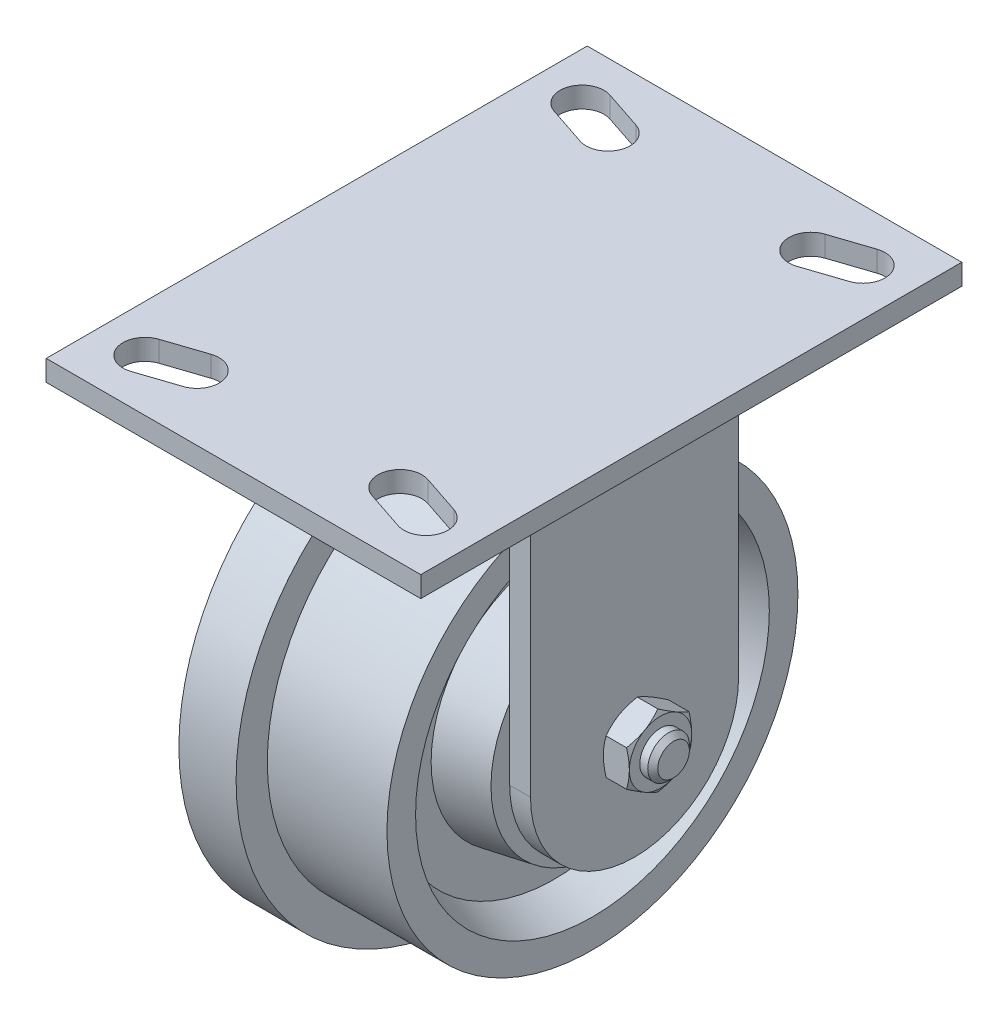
ISO-10303-21;
HEADER;
FILE_DESCRIPTION(('STEP AP214'),'2;1');
FILE_NAME('part.step','',(''),(''),'','','');
FILE_SCHEMA(('AUTOMOTIVE_DESIGN { 1 0 10303 214 1 1 1 1 }'));
ENDSEC;
DATA;
#1=APPLICATION_CONTEXT('core data for automotive mechanical design processes');
#2=APPLICATION_PROTOCOL_DEFINITION('international standard','automotive_design',2000,#1);
#3=PRODUCT_CONTEXT('',#1,'mechanical');
#4=PRODUCT('Part','Part','',(#3));
#5=PRODUCT_RELATED_PRODUCT_CATEGORY('part','',(#4));
#6=PRODUCT_DEFINITION_FORMATION('','',#4);
#7=PRODUCT_DEFINITION_CONTEXT('part definition',#1,'design');
#8=PRODUCT_DEFINITION('design','',#6,#7);
#9=PRODUCT_DEFINITION_SHAPE('','',#8);
#10=(LENGTH_UNIT() NAMED_UNIT(*) SI_UNIT(.MILLI.,.METRE.));
#11=(NAMED_UNIT(*) PLANE_ANGLE_UNIT() SI_UNIT($,.RADIAN.));
#12=(NAMED_UNIT(*) SI_UNIT($,.STERADIAN.) SOLID_ANGLE_UNIT());
#13=UNCERTAINTY_MEASURE_WITH_UNIT(LENGTH_MEASURE(1.E-05),#10,'distance_accuracy_value','');
#14=(GEOMETRIC_REPRESENTATION_CONTEXT(3) GLOBAL_UNCERTAINTY_ASSIGNED_CONTEXT((#13)) GLOBAL_UNIT_ASSIGNED_CONTEXT((#10,
#11,#12)) REPRESENTATION_CONTEXT('',''));
#15=CARTESIAN_POINT('',(0.,0.,0.));
#16=DIRECTION('',(0.,0.,1.));
#17=DIRECTION('',(1.,0.,0.));
#18=AXIS2_PLACEMENT_3D('',#15,#16,#17);
#19=CARTESIAN_POINT('',(-33.4899,0.,0.));
#20=DIRECTION('',(-1.,0.,0.));
#21=DIRECTION('',(0.,0.,1.));
#22=AXIS2_PLACEMENT_3D('',#19,#20,#21);
#23=PLANE('',#22);
#24=CARTESIAN_POINT('',(-33.4899,0.,0.));
#25=DIRECTION('',(-1.,0.,0.));
#26=DIRECTION('',(0.,0.,1.));
#27=AXIS2_PLACEMENT_3D('',#24,#25,#26);
#28=CIRCLE('',#27,31.75);
#29=CARTESIAN_POINT('',(-33.4899,0.,-31.75));
#30=VERTEX_POINT('',#29);
#31=CARTESIAN_POINT('',(-33.4899,0.,31.75));
#32=VERTEX_POINT('',#31);
#33=EDGE_CURVE('E578',#30,#32,#28,.T.);
#34=ORIENTED_EDGE('',*,*,#33,.F.);
#35=DIRECTION('',(0.,-1.,0.));
#36=VECTOR('',#35,1.);
#37=CARTESIAN_POINT('',(-33.4899,86.51875,-31.75));
#38=LINE('',#37,#36);
#39=CARTESIAN_POINT('',(-33.4899,86.51875,-31.75));
#40=VERTEX_POINT('',#39);
#41=EDGE_CURVE('E583',#40,#30,#38,.T.);
#42=ORIENTED_EDGE('',*,*,#41,.F.);
#43=DIRECTION('',(0.,0.,-1.));
#44=VECTOR('',#43,1.);
#45=CARTESIAN_POINT('',(-33.4899,86.51875,31.75));
#46=LINE('',#45,#44);
#47=CARTESIAN_POINT('',(-33.4899,86.51875,31.75));
#48=VERTEX_POINT('',#47);
#49=EDGE_CURVE('E597',#48,#40,#46,.T.);
#50=ORIENTED_EDGE('',*,*,#49,.F.);
#51=DIRECTION('',(0.,1.,0.));
#52=VECTOR('',#51,1.);
#53=CARTESIAN_POINT('',(-33.4899,0.,31.75));
#54=LINE('',#53,#52);
#55=EDGE_CURVE('E594',#32,#48,#54,.T.);
#56=ORIENTED_EDGE('',*,*,#55,.F.);
#57=EDGE_LOOP('',(#34,#42,#50,#56));
#58=FACE_BOUND('',#57,.T.);
#59=CARTESIAN_POINT('',(-33.4899,0.,0.));
#60=DIRECTION('',(-1.,0.,0.));
#61=DIRECTION('',(0.,0.,1.));
#62=AXIS2_PLACEMENT_3D('',#59,#60,#61);
#63=CIRCLE('',#62,12.7);
#64=CARTESIAN_POINT('',(-33.4899,0.,12.7));
#65=VERTEX_POINT('',#64);
#66=EDGE_CURVE('E13',#65,#65,#63,.F.);
#67=ORIENTED_EDGE('',*,*,#66,.F.);
#68=EDGE_LOOP('',(#67));
#69=FACE_BOUND('',#68,.T.);
#70=ADVANCED_FACE('F46',(#58,#69),#23,.F.);
#71=CARTESIAN_POINT('',(33.4899,0.,0.));
#72=DIRECTION('',(1.,0.,0.));
#73=DIRECTION('',(0.,0.,1.));
#74=AXIS2_PLACEMENT_3D('',#71,#72,#73);
#75=PLANE('',#74);
#76=CARTESIAN_POINT('',(33.4899,0.,0.));
#77=DIRECTION('',(-1.,0.,0.));
#78=DIRECTION('',(0.,0.,1.));
#79=AXIS2_PLACEMENT_3D('',#76,#77,#78);
#80=CIRCLE('',#79,31.75);
#81=CARTESIAN_POINT('',(33.4899,0.,-31.75));
#82=VERTEX_POINT('',#81);
#83=CARTESIAN_POINT('',(33.4899,0.,31.75));
#84=VERTEX_POINT('',#83);
#85=EDGE_CURVE('E559',#82,#84,#80,.T.);
#86=ORIENTED_EDGE('',*,*,#85,.T.);
#87=DIRECTION('',(0.,1.,0.));
#88=VECTOR('',#87,1.);
#89=CARTESIAN_POINT('',(33.4899,0.,31.75));
#90=LINE('',#89,#88);
#91=CARTESIAN_POINT('',(33.4899,86.51875,31.75));
#92=VERTEX_POINT('',#91);
#93=EDGE_CURVE('E550',#84,#92,#90,.T.);
#94=ORIENTED_EDGE('',*,*,#93,.T.);
#95=DIRECTION('',(0.,0.,-1.));
#96=VECTOR('',#95,1.);
#97=CARTESIAN_POINT('',(33.4899,86.51875,31.75));
#98=LINE('',#97,#96);
#99=CARTESIAN_POINT('',(33.4899,86.51875,-31.75));
#100=VERTEX_POINT('',#99);
#101=EDGE_CURVE('E565',#92,#100,#98,.T.);
#102=ORIENTED_EDGE('',*,*,#101,.T.);
#103=DIRECTION('',(0.,-1.,0.));
#104=VECTOR('',#103,1.);
#105=CARTESIAN_POINT('',(33.4899,86.51875,-31.75));
#106=LINE('',#105,#104);
#107=EDGE_CURVE('E562',#100,#82,#106,.T.);
#108=ORIENTED_EDGE('',*,*,#107,.T.);
#109=EDGE_LOOP('',(#86,#94,#102,#108));
#110=FACE_BOUND('',#109,.T.);
#111=CARTESIAN_POINT('',(33.4899,0.,0.));
#112=DIRECTION('',(1.,0.,0.));
#113=DIRECTION('',(0.,0.,-1.));
#114=AXIS2_PLACEMENT_3D('',#111,#112,#113);
#115=CIRCLE('',#114,12.7);
#116=CARTESIAN_POINT('',(33.4899,0.,-12.7));
#117=VERTEX_POINT('',#116);
#118=EDGE_CURVE('E54',#117,#117,#115,.F.);
#119=ORIENTED_EDGE('',*,*,#118,.F.);
#120=EDGE_LOOP('',(#119));
#121=FACE_BOUND('',#120,.T.);
#122=ADVANCED_FACE('F781',(#110,#121),#75,.F.);
#123=CARTESIAN_POINT('',(-57.15,92.86875,82.55));
#124=DIRECTION('',(1.,0.,0.));
#125=DIRECTION('',(0.,0.,-1.));
#126=AXIS2_PLACEMENT_3D('',#123,#124,#125);
#127=PLANE('',#126);
#128=DIRECTION('',(0.,-1.,0.));
#129=VECTOR('',#128,1.);
#130=CARTESIAN_POINT('',(-57.15,92.86875,-82.55));
#131=LINE('',#130,#129);
#132=CARTESIAN_POINT('',(-57.15,92.86875,-82.55));
#133=VERTEX_POINT('',#132);
#134=CARTESIAN_POINT('',(-57.15,86.51875,-82.55));
#135=VERTEX_POINT('',#134);
#136=EDGE_CURVE('E732',#133,#135,#131,.T.);
#137=ORIENTED_EDGE('',*,*,#136,.T.);
#138=DIRECTION('',(0.,0.,-1.));
#139=VECTOR('',#138,1.);
#140=CARTESIAN_POINT('',(-57.15,86.51875,82.55));
#141=LINE('',#140,#139);
#142=CARTESIAN_POINT('',(-57.15,86.51875,82.55));
#143=VERTEX_POINT('',#142);
#144=EDGE_CURVE('E765',#143,#135,#141,.T.);
#145=ORIENTED_EDGE('',*,*,#144,.F.);
#146=DIRECTION('',(0.,-1.,0.));
#147=VECTOR('',#146,1.);
#148=CARTESIAN_POINT('',(-57.15,92.86875,82.55));
#149=LINE('',#148,#147);
#150=CARTESIAN_POINT('',(-57.15,92.86875,82.55));
#151=VERTEX_POINT('',#150);
#152=EDGE_CURVE('E739',#151,#143,#149,.T.);
#153=ORIENTED_EDGE('',*,*,#152,.F.);
#154=DIRECTION('',(0.,0.,-1.));
#155=VECTOR('',#154,1.);
#156=CARTESIAN_POINT('',(-57.15,92.86875,82.55));
#157=LINE('',#156,#155);
#158=EDGE_CURVE('E749',#151,#133,#157,.T.);
#159=ORIENTED_EDGE('',*,*,#158,.T.);
#160=EDGE_LOOP('',(#137,#145,#153,#159));
#161=FACE_BOUND('',#160,.T.);
#162=ADVANCED_FACE('F783',(#161),#127,.F.);
#163=CARTESIAN_POINT('',(-57.15,86.51875,82.55));
#164=DIRECTION('',(0.,1.,0.));
#165=DIRECTION('',(0.,0.,1.));
#166=AXIS2_PLACEMENT_3D('',#163,#164,#165);
#167=PLANE('',#166);
#168=DIRECTION('',(-1.,0.,0.));
#169=VECTOR('',#168,1.);
#170=CARTESIAN_POINT('',(39.8399,86.51875,31.75));
#171=LINE('',#170,#169);
#172=CARTESIAN_POINT('',(39.8399,86.51875,31.75));
#173=VERTEX_POINT('',#172);
#174=EDGE_CURVE('E571',#173,#92,#171,.T.);
#175=ORIENTED_EDGE('',*,*,#174,.F.);
#176=DIRECTION('',(0.,0.,-1.));
#177=VECTOR('',#176,1.);
#178=CARTESIAN_POINT('',(39.8399,86.51875,31.75));
#179=LINE('',#178,#177);
#180=CARTESIAN_POINT('',(39.8399,86.51875,-31.75));
#181=VERTEX_POINT('',#180);
#182=EDGE_CURVE('E553',#173,#181,#179,.T.);
#183=ORIENTED_EDGE('',*,*,#182,.T.);
#184=DIRECTION('',(-1.,0.,0.));
#185=VECTOR('',#184,1.);
#186=CARTESIAN_POINT('',(39.8399,86.51875,-31.75));
#187=LINE('',#186,#185);
#188=EDGE_CURVE('E574',#181,#100,#187,.T.);
#189=ORIENTED_EDGE('',*,*,#188,.T.);
#190=ORIENTED_EDGE('',*,*,#101,.F.);
#191=EDGE_LOOP('',(#175,#183,#189,#190));
#192=FACE_BOUND('',#191,.T.);
#193=DIRECTION('',(1.,0.,0.));
#194=VECTOR('',#193,1.);
#195=CARTESIAN_POINT('',(-39.8399,86.51875,-31.75));
#196=LINE('',#195,#194);
#197=CARTESIAN_POINT('',(-39.8399,86.51875,-31.75));
#198=VERTEX_POINT('',#197);
#199=EDGE_CURVE('E602',#198,#40,#196,.T.);
#200=ORIENTED_EDGE('',*,*,#199,.F.);
#201=DIRECTION('',(0.,0.,-1.));
#202=VECTOR('',#201,1.);
#203=CARTESIAN_POINT('',(-39.8399,86.51875,31.75));
#204=LINE('',#203,#202);
#205=CARTESIAN_POINT('',(-39.8399,86.51875,31.75));
#206=VERTEX_POINT('',#205);
#207=EDGE_CURVE('E586',#206,#198,#204,.T.);
#208=ORIENTED_EDGE('',*,*,#207,.F.);
#209=DIRECTION('',(1.,0.,0.));
#210=VECTOR('',#209,1.);
#211=CARTESIAN_POINT('',(-39.8399,86.51875,31.75));
#212=LINE('',#211,#210);
#213=EDGE_CURVE('E605',#206,#48,#212,.T.);
#214=ORIENTED_EDGE('',*,*,#213,.T.);
#215=ORIENTED_EDGE('',*,*,#49,.T.);
#216=EDGE_LOOP('',(#200,#208,#214,#215));
#217=FACE_BOUND('',#216,.T.);
#218=DIRECTION('',(0.948683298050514,0.,-0.316227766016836));
#219=VECTOR('',#218,1.);
#220=CARTESIAN_POINT('',(-40.7339709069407,86.51875,73.060587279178));
#221=LINE('',#220,#219);
#222=CARTESIAN_POINT('',(-40.7339709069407,86.51875,73.060587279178));
#223=VERTEX_POINT('',#222);
#224=CARTESIAN_POINT('',(-28.8277209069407,86.51875,69.091837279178));
#225=VERTEX_POINT('',#224);
#226=EDGE_CURVE('E621',#223,#225,#221,.T.);
#227=ORIENTED_EDGE('',*,*,#226,.T.);
#228=CARTESIAN_POINT('',(-30.95625,86.51875,62.70625));
#229=DIRECTION('',(0.,1.,0.));
#230=DIRECTION('',(0.,0.,-1.));
#231=AXIS2_PLACEMENT_3D('',#228,#229,#230);
#232=CIRCLE('',#231,6.731);
#233=CARTESIAN_POINT('',(-33.0847790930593,86.51875,56.320662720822));
#234=VERTEX_POINT('',#233);
#235=EDGE_CURVE('E611',#225,#234,#232,.T.);
#236=ORIENTED_EDGE('',*,*,#235,.T.);
#237=DIRECTION('',(-0.948683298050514,0.,0.316227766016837));
#238=VECTOR('',#237,1.);
#239=CARTESIAN_POINT('',(-44.9910290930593,86.51875,60.289412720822));
#240=LINE('',#239,#238);
#241=CARTESIAN_POINT('',(-44.9910290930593,86.51875,60.289412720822));
#242=VERTEX_POINT('',#241);
#243=EDGE_CURVE('E614',#234,#242,#240,.T.);
#244=ORIENTED_EDGE('',*,*,#243,.T.);
#245=CARTESIAN_POINT('',(-42.8625,86.51875,66.675));
#246=DIRECTION('',(0.,1.,0.));
#247=DIRECTION('',(0.,0.,-1.));
#248=AXIS2_PLACEMENT_3D('',#245,#246,#247);
#249=CIRCLE('',#248,6.73099999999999);
#250=EDGE_CURVE('E618',#242,#223,#249,.T.);
#251=ORIENTED_EDGE('',*,*,#250,.T.);
#252=EDGE_LOOP('',(#227,#236,#244,#251));
#253=FACE_BOUND('',#252,.T.);
#254=DIRECTION('',(0.948683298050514,0.,0.316227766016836));
#255=VECTOR('',#254,1.);
#256=CARTESIAN_POINT('',(40.7339709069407,86.51875,73.060587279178));
#257=LINE('',#256,#255);
#258=CARTESIAN_POINT('',(28.8277209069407,86.51875,69.091837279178));
#259=VERTEX_POINT('',#258);
#260=CARTESIAN_POINT('',(40.7339709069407,86.51875,73.060587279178));
#261=VERTEX_POINT('',#260);
#262=EDGE_CURVE('E653',#259,#261,#257,.T.);
#263=ORIENTED_EDGE('',*,*,#262,.T.);
#264=CARTESIAN_POINT('',(42.8625,86.51875,66.675));
#265=DIRECTION('',(0.,1.,0.));
#266=DIRECTION('',(0.,0.,1.));
#267=AXIS2_PLACEMENT_3D('',#264,#265,#266);
#268=CIRCLE('',#267,6.73099999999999);
#269=CARTESIAN_POINT('',(44.9910290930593,86.51875,60.289412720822));
#270=VERTEX_POINT('',#269);
#271=EDGE_CURVE('E643',#261,#270,#268,.T.);
#272=ORIENTED_EDGE('',*,*,#271,.T.);
#273=DIRECTION('',(-0.948683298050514,0.,-0.316227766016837));
#274=VECTOR('',#273,1.);
#275=CARTESIAN_POINT('',(44.9910290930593,86.51875,60.289412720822));
#276=LINE('',#275,#274);
#277=CARTESIAN_POINT('',(33.0847790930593,86.51875,56.320662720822));
#278=VERTEX_POINT('',#277);
#279=EDGE_CURVE('E646',#270,#278,#276,.T.);
#280=ORIENTED_EDGE('',*,*,#279,.T.);
#281=CARTESIAN_POINT('',(30.95625,86.51875,62.70625));
#282=DIRECTION('',(0.,1.,0.));
#283=DIRECTION('',(0.,0.,1.));
#284=AXIS2_PLACEMENT_3D('',#281,#282,#283);
#285=CIRCLE('',#284,6.731);
#286=EDGE_CURVE('E650',#278,#259,#285,.T.);
#287=ORIENTED_EDGE('',*,*,#286,.T.);
#288=EDGE_LOOP('',(#263,#272,#280,#287));
#289=FACE_BOUND('',#288,.T.);
#290=DIRECTION('',(0.948683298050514,0.,-0.316227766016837));
#291=VECTOR('',#290,1.);
#292=CARTESIAN_POINT('',(44.9910290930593,86.51875,-60.289412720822));
#293=LINE('',#292,#291);
#294=CARTESIAN_POINT('',(33.0847790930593,86.51875,-56.320662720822));
#295=VERTEX_POINT('',#294);
#296=CARTESIAN_POINT('',(44.9910290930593,86.51875,-60.289412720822));
#297=VERTEX_POINT('',#296);
#298=EDGE_CURVE('E685',#295,#297,#293,.T.);
#299=ORIENTED_EDGE('',*,*,#298,.T.);
#300=CARTESIAN_POINT('',(42.8625,86.51875,-66.675));
#301=DIRECTION('',(0.,1.,0.));
#302=DIRECTION('',(0.,0.,-1.));
#303=AXIS2_PLACEMENT_3D('',#300,#301,#302);
#304=CIRCLE('',#303,6.73099999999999);
#305=CARTESIAN_POINT('',(40.7339709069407,86.51875,-73.060587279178));
#306=VERTEX_POINT('',#305);
#307=EDGE_CURVE('E675',#297,#306,#304,.T.);
#308=ORIENTED_EDGE('',*,*,#307,.T.);
#309=DIRECTION('',(-0.948683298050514,0.,0.316227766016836));
#310=VECTOR('',#309,1.);
#311=CARTESIAN_POINT('',(40.7339709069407,86.51875,-73.060587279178));
#312=LINE('',#311,#310);
#313=CARTESIAN_POINT('',(28.8277209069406,86.51875,-69.091837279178));
#314=VERTEX_POINT('',#313);
#315=EDGE_CURVE('E678',#306,#314,#312,.T.);
#316=ORIENTED_EDGE('',*,*,#315,.T.);
#317=CARTESIAN_POINT('',(30.95625,86.51875,-62.70625));
#318=DIRECTION('',(0.,1.,0.));
#319=DIRECTION('',(0.,0.,-1.));
#320=AXIS2_PLACEMENT_3D('',#317,#318,#319);
#321=CIRCLE('',#320,6.731);
#322=EDGE_CURVE('E682',#314,#295,#321,.T.);
#323=ORIENTED_EDGE('',*,*,#322,.T.);
#324=EDGE_LOOP('',(#299,#308,#316,#323));
#325=FACE_BOUND('',#324,.T.);
#326=DIRECTION('',(0.948683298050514,0.,0.316227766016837));
#327=VECTOR('',#326,1.);
#328=CARTESIAN_POINT('',(-44.9910290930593,86.51875,-60.289412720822));
#329=LINE('',#328,#327);
#330=CARTESIAN_POINT('',(-44.9910290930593,86.51875,-60.289412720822));
#331=VERTEX_POINT('',#330);
#332=CARTESIAN_POINT('',(-33.0847790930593,86.51875,-56.320662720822));
#333=VERTEX_POINT('',#332);
#334=EDGE_CURVE('E717',#331,#333,#329,.T.);
#335=ORIENTED_EDGE('',*,*,#334,.T.);
#336=CARTESIAN_POINT('',(-30.95625,86.51875,-62.70625));
#337=DIRECTION('',(0.,1.,0.));
#338=DIRECTION('',(0.,0.,1.));
#339=AXIS2_PLACEMENT_3D('',#336,#337,#338);
#340=CIRCLE('',#339,6.731);
#341=CARTESIAN_POINT('',(-28.8277209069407,86.51875,-69.091837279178));
#342=VERTEX_POINT('',#341);
#343=EDGE_CURVE('E707',#333,#342,#340,.T.);
#344=ORIENTED_EDGE('',*,*,#343,.T.);
#345=DIRECTION('',(-0.948683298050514,0.,-0.316227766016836));
#346=VECTOR('',#345,1.);
#347=CARTESIAN_POINT('',(-40.7339709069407,86.51875,-73.060587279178));
#348=LINE('',#347,#346);
#349=CARTESIAN_POINT('',(-40.7339709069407,86.51875,-73.060587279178));
#350=VERTEX_POINT('',#349);
#351=EDGE_CURVE('E710',#342,#350,#348,.T.);
#352=ORIENTED_EDGE('',*,*,#351,.T.);
#353=CARTESIAN_POINT('',(-42.8625,86.51875,-66.675));
#354=DIRECTION('',(0.,1.,0.));
#355=DIRECTION('',(0.,0.,1.));
#356=AXIS2_PLACEMENT_3D('',#353,#354,#355);
#357=CIRCLE('',#356,6.73099999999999);
#358=EDGE_CURVE('E714',#350,#331,#357,.T.);
#359=ORIENTED_EDGE('',*,*,#358,.T.);
#360=EDGE_LOOP('',(#335,#344,#352,#359));
#361=FACE_BOUND('',#360,.T.);
#362=DIRECTION('',(1.,0.,0.));
#363=VECTOR('',#362,1.);
#364=CARTESIAN_POINT('',(-57.15,86.51875,-82.55));
#365=LINE('',#364,#363);
#366=CARTESIAN_POINT('',(57.15,86.51875,-82.55));
#367=VERTEX_POINT('',#366);
#368=EDGE_CURVE('E752',#135,#367,#365,.T.);
#369=ORIENTED_EDGE('',*,*,#368,.T.);
#370=DIRECTION('',(0.,0.,-1.));
#371=VECTOR('',#370,1.);
#372=CARTESIAN_POINT('',(57.15,86.51875,82.55));
#373=LINE('',#372,#371);
#374=CARTESIAN_POINT('',(57.15,86.51875,82.55));
#375=VERTEX_POINT('',#374);
#376=EDGE_CURVE('E762',#375,#367,#373,.T.);
#377=ORIENTED_EDGE('',*,*,#376,.F.);
#378=DIRECTION('',(1.,0.,0.));
#379=VECTOR('',#378,1.);
#380=CARTESIAN_POINT('',(-57.15,86.51875,82.55));
#381=LINE('',#380,#379);
#382=EDGE_CURVE('E742',#143,#375,#381,.T.);
#383=ORIENTED_EDGE('',*,*,#382,.F.);
#384=ORIENTED_EDGE('',*,*,#144,.T.);
#385=EDGE_LOOP('',(#369,#377,#383,#384));
#386=FACE_BOUND('',#385,.T.);
#387=ADVANCED_FACE('F790',(#192,#217,#253,#289,#325,#361,#386),#167,.F.);
#388=CARTESIAN_POINT('',(57.15,92.86875,82.55));
#389=DIRECTION('',(-1.,0.,0.));
#390=DIRECTION('',(0.,0.,1.));
#391=AXIS2_PLACEMENT_3D('',#388,#389,#390);
#392=PLANE('',#391);
#393=DIRECTION('',(0.,1.,0.));
#394=VECTOR('',#393,1.);
#395=CARTESIAN_POINT('',(57.15,92.86875,-82.55));
#396=LINE('',#395,#394);
#397=CARTESIAN_POINT('',(57.15,92.86875,-82.55));
#398=VERTEX_POINT('',#397);
#399=EDGE_CURVE('E754',#367,#398,#396,.T.);
#400=ORIENTED_EDGE('',*,*,#399,.T.);
#401=DIRECTION('',(0.,0.,-1.));
#402=VECTOR('',#401,1.);
#403=CARTESIAN_POINT('',(57.15,92.86875,82.55));
#404=LINE('',#403,#402);
#405=CARTESIAN_POINT('',(57.15,92.86875,82.55));
#406=VERTEX_POINT('',#405);
#407=EDGE_CURVE('E759',#406,#398,#404,.T.);
#408=ORIENTED_EDGE('',*,*,#407,.F.);
#409=DIRECTION('',(0.,1.,0.));
#410=VECTOR('',#409,1.);
#411=CARTESIAN_POINT('',(57.15,92.86875,82.55));
#412=LINE('',#411,#410);
#413=EDGE_CURVE('E745',#375,#406,#412,.T.);
#414=ORIENTED_EDGE('',*,*,#413,.F.);
#415=ORIENTED_EDGE('',*,*,#376,.T.);
#416=EDGE_LOOP('',(#400,#408,#414,#415));
#417=FACE_BOUND('',#416,.T.);
#418=ADVANCED_FACE('F900',(#417),#392,.F.);
#419=CARTESIAN_POINT('',(-57.15,92.86875,82.55));
#420=DIRECTION('',(0.,-1.,0.));
#421=DIRECTION('',(0.,0.,-1.));
#422=AXIS2_PLACEMENT_3D('',#419,#420,#421);
#423=PLANE('',#422);
#424=DIRECTION('',(-0.948683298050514,0.,0.316227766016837));
#425=VECTOR('',#424,1.);
#426=CARTESIAN_POINT('',(-44.9910290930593,92.86875,60.289412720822));
#427=LINE('',#426,#425);
#428=CARTESIAN_POINT('',(-33.0847790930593,92.86875,56.320662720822));
#429=VERTEX_POINT('',#428);
#430=CARTESIAN_POINT('',(-44.9910290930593,92.86875,60.289412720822));
#431=VERTEX_POINT('',#430);
#432=EDGE_CURVE('E626',#429,#431,#427,.T.);
#433=ORIENTED_EDGE('',*,*,#432,.F.);
#434=CARTESIAN_POINT('',(-30.95625,92.86875,62.70625));
#435=DIRECTION('',(0.,1.,0.));
#436=DIRECTION('',(0.,0.,-1.));
#437=AXIS2_PLACEMENT_3D('',#434,#435,#436);
#438=CIRCLE('',#437,6.731);
#439=CARTESIAN_POINT('',(-28.8277209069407,92.86875,69.091837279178));
#440=VERTEX_POINT('',#439);
#441=EDGE_CURVE('E610',#440,#429,#438,.T.);
#442=ORIENTED_EDGE('',*,*,#441,.F.);
#443=DIRECTION('',(0.948683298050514,0.,-0.316227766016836));
#444=VECTOR('',#443,1.);
#445=CARTESIAN_POINT('',(-40.7339709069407,92.86875,73.060587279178));
#446=LINE('',#445,#444);
#447=CARTESIAN_POINT('',(-40.7339709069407,92.86875,73.060587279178));
#448=VERTEX_POINT('',#447);
#449=EDGE_CURVE('E615',#448,#440,#446,.T.);
#450=ORIENTED_EDGE('',*,*,#449,.F.);
#451=CARTESIAN_POINT('',(-42.8625,92.86875,66.675));
#452=DIRECTION('',(0.,1.,0.));
#453=DIRECTION('',(0.,0.,-1.));
#454=AXIS2_PLACEMENT_3D('',#451,#452,#453);
#455=CIRCLE('',#454,6.73099999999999);
#456=EDGE_CURVE('E629',#431,#448,#455,.T.);
#457=ORIENTED_EDGE('',*,*,#456,.F.);
#458=EDGE_LOOP('',(#433,#442,#450,#457));
#459=FACE_BOUND('',#458,.T.);
#460=DIRECTION('',(-0.948683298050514,0.,-0.316227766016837));
#461=VECTOR('',#460,1.);
#462=CARTESIAN_POINT('',(44.9910290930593,92.86875,60.289412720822));
#463=LINE('',#462,#461);
#464=CARTESIAN_POINT('',(44.9910290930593,92.86875,60.289412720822));
#465=VERTEX_POINT('',#464);
#466=CARTESIAN_POINT('',(33.0847790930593,92.86875,56.320662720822));
#467=VERTEX_POINT('',#466);
#468=EDGE_CURVE('E658',#465,#467,#463,.T.);
#469=ORIENTED_EDGE('',*,*,#468,.F.);
#470=CARTESIAN_POINT('',(42.8625,92.86875,66.675));
#471=DIRECTION('',(0.,1.,0.));
#472=DIRECTION('',(0.,0.,1.));
#473=AXIS2_PLACEMENT_3D('',#470,#471,#472);
#474=CIRCLE('',#473,6.73099999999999);
#475=CARTESIAN_POINT('',(40.7339709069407,92.86875,73.060587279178));
#476=VERTEX_POINT('',#475);
#477=EDGE_CURVE('E636',#476,#465,#474,.T.);
#478=ORIENTED_EDGE('',*,*,#477,.F.);
#479=DIRECTION('',(0.948683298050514,0.,0.316227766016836));
#480=VECTOR('',#479,1.);
#481=CARTESIAN_POINT('',(40.7339709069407,92.86875,73.060587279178));
#482=LINE('',#481,#480);
#483=CARTESIAN_POINT('',(28.8277209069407,92.86875,69.091837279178));
#484=VERTEX_POINT('',#483);
#485=EDGE_CURVE('E647',#484,#476,#482,.T.);
#486=ORIENTED_EDGE('',*,*,#485,.F.);
#487=CARTESIAN_POINT('',(30.95625,92.86875,62.70625));
#488=DIRECTION('',(0.,1.,0.));
#489=DIRECTION('',(0.,0.,1.));
#490=AXIS2_PLACEMENT_3D('',#487,#488,#489);
#491=CIRCLE('',#490,6.731);
#492=EDGE_CURVE('E661',#467,#484,#491,.T.);
#493=ORIENTED_EDGE('',*,*,#492,.F.);
#494=EDGE_LOOP('',(#469,#478,#486,#493));
#495=FACE_BOUND('',#494,.T.);
#496=DIRECTION('',(-0.948683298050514,0.,0.316227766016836));
#497=VECTOR('',#496,1.);
#498=CARTESIAN_POINT('',(40.7339709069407,92.86875,-73.060587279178));
#499=LINE('',#498,#497);
#500=CARTESIAN_POINT('',(40.7339709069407,92.86875,-73.060587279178));
#501=VERTEX_POINT('',#500);
#502=CARTESIAN_POINT('',(28.8277209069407,92.86875,-69.091837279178));
#503=VERTEX_POINT('',#502);
#504=EDGE_CURVE('E690',#501,#503,#499,.T.);
#505=ORIENTED_EDGE('',*,*,#504,.F.);
#506=CARTESIAN_POINT('',(42.8625,92.86875,-66.675));
#507=DIRECTION('',(0.,1.,0.));
#508=DIRECTION('',(0.,0.,-1.));
#509=AXIS2_PLACEMENT_3D('',#506,#507,#508);
#510=CIRCLE('',#509,6.73099999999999);
#511=CARTESIAN_POINT('',(44.9910290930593,92.86875,-60.289412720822));
#512=VERTEX_POINT('',#511);
#513=EDGE_CURVE('E668',#512,#501,#510,.T.);
#514=ORIENTED_EDGE('',*,*,#513,.F.);
#515=DIRECTION('',(0.948683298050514,0.,-0.316227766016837));
#516=VECTOR('',#515,1.);
#517=CARTESIAN_POINT('',(44.9910290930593,92.86875,-60.289412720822));
#518=LINE('',#517,#516);
#519=CARTESIAN_POINT('',(33.0847790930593,92.86875,-56.320662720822));
#520=VERTEX_POINT('',#519);
#521=EDGE_CURVE('E679',#520,#512,#518,.T.);
#522=ORIENTED_EDGE('',*,*,#521,.F.);
#523=CARTESIAN_POINT('',(30.95625,92.86875,-62.70625));
#524=DIRECTION('',(0.,1.,0.));
#525=DIRECTION('',(0.,0.,-1.));
#526=AXIS2_PLACEMENT_3D('',#523,#524,#525);
#527=CIRCLE('',#526,6.731);
#528=EDGE_CURVE('E693',#503,#520,#527,.T.);
#529=ORIENTED_EDGE('',*,*,#528,.F.);
#530=EDGE_LOOP('',(#505,#514,#522,#529));
#531=FACE_BOUND('',#530,.T.);
#532=DIRECTION('',(-0.948683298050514,0.,-0.316227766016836));
#533=VECTOR('',#532,1.);
#534=CARTESIAN_POINT('',(-40.7339709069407,92.86875,-73.060587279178));
#535=LINE('',#534,#533);
#536=CARTESIAN_POINT('',(-28.8277209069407,92.86875,-69.091837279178));
#537=VERTEX_POINT('',#536);
#538=CARTESIAN_POINT('',(-40.7339709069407,92.86875,-73.060587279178));
#539=VERTEX_POINT('',#538);
#540=EDGE_CURVE('E722',#537,#539,#535,.T.);
#541=ORIENTED_EDGE('',*,*,#540,.F.);
#542=CARTESIAN_POINT('',(-30.95625,92.86875,-62.70625));
#543=DIRECTION('',(0.,1.,0.));
#544=DIRECTION('',(0.,0.,1.));
#545=AXIS2_PLACEMENT_3D('',#542,#543,#544);
#546=CIRCLE('',#545,6.731);
#547=CARTESIAN_POINT('',(-33.0847790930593,92.86875,-56.320662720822));
#548=VERTEX_POINT('',#547);
#549=EDGE_CURVE('E700',#548,#537,#546,.T.);
#550=ORIENTED_EDGE('',*,*,#549,.F.);
#551=DIRECTION('',(0.948683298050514,0.,0.316227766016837));
#552=VECTOR('',#551,1.);
#553=CARTESIAN_POINT('',(-44.9910290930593,92.86875,-60.289412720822));
#554=LINE('',#553,#552);
#555=CARTESIAN_POINT('',(-44.9910290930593,92.86875,-60.289412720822));
#556=VERTEX_POINT('',#555);
#557=EDGE_CURVE('E711',#556,#548,#554,.T.);
#558=ORIENTED_EDGE('',*,*,#557,.F.);
#559=CARTESIAN_POINT('',(-42.8625,92.86875,-66.675));
#560=DIRECTION('',(0.,1.,0.));
#561=DIRECTION('',(0.,0.,1.));
#562=AXIS2_PLACEMENT_3D('',#559,#560,#561);
#563=CIRCLE('',#562,6.73099999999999);
#564=EDGE_CURVE('E725',#539,#556,#563,.T.);
#565=ORIENTED_EDGE('',*,*,#564,.F.);
#566=EDGE_LOOP('',(#541,#550,#558,#565));
#567=FACE_BOUND('',#566,.T.);
#568=DIRECTION('',(-1.,0.,0.));
#569=VECTOR('',#568,1.);
#570=CARTESIAN_POINT('',(-57.15,92.86875,-82.55));
#571=LINE('',#570,#569);
#572=EDGE_CURVE('E743',#398,#133,#571,.T.);
#573=ORIENTED_EDGE('',*,*,#572,.T.);
#574=ORIENTED_EDGE('',*,*,#158,.F.);
#575=DIRECTION('',(-1.,0.,0.));
#576=VECTOR('',#575,1.);
#577=CARTESIAN_POINT('',(-57.15,92.86875,82.55));
#578=LINE('',#577,#576);
#579=EDGE_CURVE('E747',#406,#151,#578,.T.);
#580=ORIENTED_EDGE('',*,*,#579,.F.);
#581=ORIENTED_EDGE('',*,*,#407,.T.);
#582=EDGE_LOOP('',(#573,#574,#580,#581));
#583=FACE_BOUND('',#582,.T.);
#584=ADVANCED_FACE('F893',(#459,#495,#531,#567,#583),#423,.F.);
#585=CARTESIAN_POINT('',(-57.15,86.51875,82.55));
#586=DIRECTION('',(0.,0.,1.));
#587=DIRECTION('',(1.,0.,0.));
#588=AXIS2_PLACEMENT_3D('',#585,#586,#587);
#589=PLANE('',#588);
#590=ORIENTED_EDGE('',*,*,#152,.T.);
#591=ORIENTED_EDGE('',*,*,#382,.T.);
#592=ORIENTED_EDGE('',*,*,#413,.T.);
#593=ORIENTED_EDGE('',*,*,#579,.T.);
#594=EDGE_LOOP('',(#590,#591,#592,#593));
#595=FACE_BOUND('',#594,.T.);
#596=ADVANCED_FACE('F890',(#595),#589,.T.);
#597=CARTESIAN_POINT('',(-57.15,86.51875,-82.55));
#598=DIRECTION('',(0.,0.,1.));
#599=DIRECTION('',(1.,0.,0.));
#600=AXIS2_PLACEMENT_3D('',#597,#598,#599);
#601=PLANE('',#600);
#602=ORIENTED_EDGE('',*,*,#136,.F.);
#603=ORIENTED_EDGE('',*,*,#572,.F.);
#604=ORIENTED_EDGE('',*,*,#399,.F.);
#605=ORIENTED_EDGE('',*,*,#368,.F.);
#606=EDGE_LOOP('',(#602,#603,#604,#605));
#607=FACE_BOUND('',#606,.T.);
#608=ADVANCED_FACE('F888',(#607),#601,.F.);
#609=CARTESIAN_POINT('',(-30.95625,86.51875,-62.70625));
#610=DIRECTION('',(0.,1.,0.));
#611=DIRECTION('',(0.,0.,1.));
#612=AXIS2_PLACEMENT_3D('',#609,#610,#611);
#613=CYLINDRICAL_SURFACE('',#612,6.731);
#614=ORIENTED_EDGE('',*,*,#549,.T.);
#615=DIRECTION('',(0.,1.,0.));
#616=VECTOR('',#615,1.);
#617=CARTESIAN_POINT('',(-28.8277209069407,86.51875,-69.091837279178));
#618=LINE('',#617,#616);
#619=EDGE_CURVE('E720',#342,#537,#618,.T.);
#620=ORIENTED_EDGE('',*,*,#619,.F.);
#621=ORIENTED_EDGE('',*,*,#343,.F.);
#622=DIRECTION('',(0.,1.,0.));
#623=VECTOR('',#622,1.);
#624=CARTESIAN_POINT('',(-33.0847790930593,86.51875,-56.320662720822));
#625=LINE('',#624,#623);
#626=EDGE_CURVE('E730',#333,#548,#625,.T.);
#627=ORIENTED_EDGE('',*,*,#626,.T.);
#628=EDGE_LOOP('',(#614,#620,#621,#627));
#629=FACE_BOUND('',#628,.T.);
#630=ADVANCED_FACE('F878',(#629),#613,.F.);
#631=CARTESIAN_POINT('',(-44.9910290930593,86.51875,-60.289412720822));
#632=DIRECTION('',(-0.316227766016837,0.,0.948683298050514));
#633=DIRECTION('',(0.948683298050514,0.,0.316227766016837));
#634=AXIS2_PLACEMENT_3D('',#631,#632,#633);
#635=PLANE('',#634);
#636=ORIENTED_EDGE('',*,*,#557,.T.);
#637=ORIENTED_EDGE('',*,*,#626,.F.);
#638=ORIENTED_EDGE('',*,*,#334,.F.);
#639=DIRECTION('',(0.,1.,0.));
#640=VECTOR('',#639,1.);
#641=CARTESIAN_POINT('',(-44.9910290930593,86.51875,-60.289412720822));
#642=LINE('',#641,#640);
#643=EDGE_CURVE('E733',#331,#556,#642,.T.);
#644=ORIENTED_EDGE('',*,*,#643,.T.);
#645=EDGE_LOOP('',(#636,#637,#638,#644));
#646=FACE_BOUND('',#645,.T.);
#647=ADVANCED_FACE('F874',(#646),#635,.F.);
#648=CARTESIAN_POINT('',(-42.8625,86.51875,-66.675));
#649=DIRECTION('',(0.,1.,0.));
#650=DIRECTION('',(0.,0.,1.));
#651=AXIS2_PLACEMENT_3D('',#648,#649,#650);
#652=CYLINDRICAL_SURFACE('',#651,6.73099999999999);
#653=ORIENTED_EDGE('',*,*,#564,.T.);
#654=ORIENTED_EDGE('',*,*,#643,.F.);
#655=ORIENTED_EDGE('',*,*,#358,.F.);
#656=DIRECTION('',(0.,1.,0.));
#657=VECTOR('',#656,1.);
#658=CARTESIAN_POINT('',(-40.7339709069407,86.51875,-73.060587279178));
#659=LINE('',#658,#657);
#660=EDGE_CURVE('E735',#350,#539,#659,.T.);
#661=ORIENTED_EDGE('',*,*,#660,.T.);
#662=EDGE_LOOP('',(#653,#654,#655,#661));
#663=FACE_BOUND('',#662,.T.);
#664=ADVANCED_FACE('F877',(#663),#652,.F.);
#665=CARTESIAN_POINT('',(-40.7339709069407,86.51875,-73.060587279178));
#666=DIRECTION('',(0.316227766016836,0.,-0.948683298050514));
#667=DIRECTION('',(-0.948683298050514,0.,-0.316227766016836));
#668=AXIS2_PLACEMENT_3D('',#665,#666,#667);
#669=PLANE('',#668);
#670=ORIENTED_EDGE('',*,*,#540,.T.);
#671=ORIENTED_EDGE('',*,*,#660,.F.);
#672=ORIENTED_EDGE('',*,*,#351,.F.);
#673=ORIENTED_EDGE('',*,*,#619,.T.);
#674=EDGE_LOOP('',(#670,#671,#672,#673));
#675=FACE_BOUND('',#674,.T.);
#676=ADVANCED_FACE('F872',(#675),#669,.F.);
#677=CARTESIAN_POINT('',(42.8625,86.51875,-66.675));
#678=DIRECTION('',(0.,1.,0.));
#679=DIRECTION('',(0.,0.,1.));
#680=AXIS2_PLACEMENT_3D('',#677,#678,#679);
#681=CYLINDRICAL_SURFACE('',#680,6.73099999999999);
#682=ORIENTED_EDGE('',*,*,#513,.T.);
#683=DIRECTION('',(0.,1.,0.));
#684=VECTOR('',#683,1.);
#685=CARTESIAN_POINT('',(40.7339709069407,86.51875,-73.060587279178));
#686=LINE('',#685,#684);
#687=EDGE_CURVE('E688',#306,#501,#686,.T.);
#688=ORIENTED_EDGE('',*,*,#687,.F.);
#689=ORIENTED_EDGE('',*,*,#307,.F.);
#690=DIRECTION('',(0.,1.,0.));
#691=VECTOR('',#690,1.);
#692=CARTESIAN_POINT('',(44.9910290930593,86.51875,-60.289412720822));
#693=LINE('',#692,#691);
#694=EDGE_CURVE('E698',#297,#512,#693,.T.);
#695=ORIENTED_EDGE('',*,*,#694,.T.);
#696=EDGE_LOOP('',(#682,#688,#689,#695));
#697=FACE_BOUND('',#696,.T.);
#698=ADVANCED_FACE('F862',(#697),#681,.F.);
#699=CARTESIAN_POINT('',(44.9910290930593,86.51875,-60.289412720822));
#700=DIRECTION('',(0.316227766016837,0.,0.948683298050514));
#701=DIRECTION('',(0.948683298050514,0.,-0.316227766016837));
#702=AXIS2_PLACEMENT_3D('',#699,#700,#701);
#703=PLANE('',#702);
#704=ORIENTED_EDGE('',*,*,#521,.T.);
#705=ORIENTED_EDGE('',*,*,#694,.F.);
#706=ORIENTED_EDGE('',*,*,#298,.F.);
#707=DIRECTION('',(0.,1.,0.));
#708=VECTOR('',#707,1.);
#709=CARTESIAN_POINT('',(33.0847790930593,86.51875,-56.320662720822));
#710=LINE('',#709,#708);
#711=EDGE_CURVE('E701',#295,#520,#710,.T.);
#712=ORIENTED_EDGE('',*,*,#711,.T.);
#713=EDGE_LOOP('',(#704,#705,#706,#712));
#714=FACE_BOUND('',#713,.T.);
#715=ADVANCED_FACE('F858',(#714),#703,.F.);
#716=CARTESIAN_POINT('',(30.95625,86.51875,-62.70625));
#717=DIRECTION('',(0.,1.,0.));
#718=DIRECTION('',(0.,0.,1.));
#719=AXIS2_PLACEMENT_3D('',#716,#717,#718);
#720=CYLINDRICAL_SURFACE('',#719,6.731);
#721=ORIENTED_EDGE('',*,*,#528,.T.);
#722=ORIENTED_EDGE('',*,*,#711,.F.);
#723=ORIENTED_EDGE('',*,*,#322,.F.);
#724=DIRECTION('',(0.,1.,0.));
#725=VECTOR('',#724,1.);
#726=CARTESIAN_POINT('',(28.8277209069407,86.51875,-69.091837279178));
#727=LINE('',#726,#725);
#728=EDGE_CURVE('E703',#314,#503,#727,.T.);
#729=ORIENTED_EDGE('',*,*,#728,.T.);
#730=EDGE_LOOP('',(#721,#722,#723,#729));
#731=FACE_BOUND('',#730,.T.);
#732=ADVANCED_FACE('F861',(#731),#720,.F.);
#733=CARTESIAN_POINT('',(40.7339709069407,86.51875,-73.060587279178));
#734=DIRECTION('',(-0.316227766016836,0.,-0.948683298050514));
#735=DIRECTION('',(-0.948683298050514,0.,0.316227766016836));
#736=AXIS2_PLACEMENT_3D('',#733,#734,#735);
#737=PLANE('',#736);
#738=ORIENTED_EDGE('',*,*,#504,.T.);
#739=ORIENTED_EDGE('',*,*,#728,.F.);
#740=ORIENTED_EDGE('',*,*,#315,.F.);
#741=ORIENTED_EDGE('',*,*,#687,.T.);
#742=EDGE_LOOP('',(#738,#739,#740,#741));
#743=FACE_BOUND('',#742,.T.);
#744=ADVANCED_FACE('F856',(#743),#737,.F.);
#745=CARTESIAN_POINT('',(42.8625,86.51875,66.675));
#746=DIRECTION('',(0.,1.,0.));
#747=DIRECTION('',(0.,0.,1.));
#748=AXIS2_PLACEMENT_3D('',#745,#746,#747);
#749=CYLINDRICAL_SURFACE('',#748,6.73099999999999);
#750=ORIENTED_EDGE('',*,*,#477,.T.);
#751=DIRECTION('',(0.,1.,0.));
#752=VECTOR('',#751,1.);
#753=CARTESIAN_POINT('',(44.9910290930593,86.51875,60.289412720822));
#754=LINE('',#753,#752);
#755=EDGE_CURVE('E656',#270,#465,#754,.T.);
#756=ORIENTED_EDGE('',*,*,#755,.F.);
#757=ORIENTED_EDGE('',*,*,#271,.F.);
#758=DIRECTION('',(0.,1.,0.));
#759=VECTOR('',#758,1.);
#760=CARTESIAN_POINT('',(40.7339709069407,86.51875,73.060587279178));
#761=LINE('',#760,#759);
#762=EDGE_CURVE('E666',#261,#476,#761,.T.);
#763=ORIENTED_EDGE('',*,*,#762,.T.);
#764=EDGE_LOOP('',(#750,#756,#757,#763));
#765=FACE_BOUND('',#764,.T.);
#766=ADVANCED_FACE('F846',(#765),#749,.F.);
#767=CARTESIAN_POINT('',(40.7339709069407,86.51875,73.060587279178));
#768=DIRECTION('',(-0.316227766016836,0.,0.948683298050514));
#769=DIRECTION('',(0.948683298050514,0.,0.316227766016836));
#770=AXIS2_PLACEMENT_3D('',#767,#768,#769);
#771=PLANE('',#770);
#772=ORIENTED_EDGE('',*,*,#485,.T.);
#773=ORIENTED_EDGE('',*,*,#762,.F.);
#774=ORIENTED_EDGE('',*,*,#262,.F.);
#775=DIRECTION('',(0.,1.,0.));
#776=VECTOR('',#775,1.);
#777=CARTESIAN_POINT('',(28.8277209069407,86.51875,69.091837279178));
#778=LINE('',#777,#776);
#779=EDGE_CURVE('E669',#259,#484,#778,.T.);
#780=ORIENTED_EDGE('',*,*,#779,.T.);
#781=EDGE_LOOP('',(#772,#773,#774,#780));
#782=FACE_BOUND('',#781,.T.);
#783=ADVANCED_FACE('F842',(#782),#771,.F.);
#784=CARTESIAN_POINT('',(30.95625,86.51875,62.70625));
#785=DIRECTION('',(0.,1.,0.));
#786=DIRECTION('',(0.,0.,1.));
#787=AXIS2_PLACEMENT_3D('',#784,#785,#786);
#788=CYLINDRICAL_SURFACE('',#787,6.731);
#789=ORIENTED_EDGE('',*,*,#492,.T.);
#790=ORIENTED_EDGE('',*,*,#779,.F.);
#791=ORIENTED_EDGE('',*,*,#286,.F.);
#792=DIRECTION('',(0.,1.,0.));
#793=VECTOR('',#792,1.);
#794=CARTESIAN_POINT('',(33.0847790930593,86.51875,56.320662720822));
#795=LINE('',#794,#793);
#796=EDGE_CURVE('E671',#278,#467,#795,.T.);
#797=ORIENTED_EDGE('',*,*,#796,.T.);
#798=EDGE_LOOP('',(#789,#790,#791,#797));
#799=FACE_BOUND('',#798,.T.);
#800=ADVANCED_FACE('F845',(#799),#788,.F.);
#801=CARTESIAN_POINT('',(44.9910290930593,86.51875,60.289412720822));
#802=DIRECTION('',(0.316227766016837,0.,-0.948683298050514));
#803=DIRECTION('',(-0.948683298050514,0.,-0.316227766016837));
#804=AXIS2_PLACEMENT_3D('',#801,#802,#803);
#805=PLANE('',#804);
#806=ORIENTED_EDGE('',*,*,#468,.T.);
#807=ORIENTED_EDGE('',*,*,#796,.F.);
#808=ORIENTED_EDGE('',*,*,#279,.F.);
#809=ORIENTED_EDGE('',*,*,#755,.T.);
#810=EDGE_LOOP('',(#806,#807,#808,#809));
#811=FACE_BOUND('',#810,.T.);
#812=ADVANCED_FACE('F840',(#811),#805,.F.);
#813=CARTESIAN_POINT('',(-30.95625,86.51875,62.70625));
#814=DIRECTION('',(0.,1.,0.));
#815=DIRECTION('',(0.,0.,1.));
#816=AXIS2_PLACEMENT_3D('',#813,#814,#815);
#817=CYLINDRICAL_SURFACE('',#816,6.731);
#818=ORIENTED_EDGE('',*,*,#441,.T.);
#819=DIRECTION('',(0.,1.,0.));
#820=VECTOR('',#819,1.);
#821=CARTESIAN_POINT('',(-33.0847790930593,86.51875,56.320662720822));
#822=LINE('',#821,#820);
#823=EDGE_CURVE('E624',#234,#429,#822,.T.);
#824=ORIENTED_EDGE('',*,*,#823,.F.);
#825=ORIENTED_EDGE('',*,*,#235,.F.);
#826=DIRECTION('',(0.,1.,0.));
#827=VECTOR('',#826,1.);
#828=CARTESIAN_POINT('',(-28.8277209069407,86.51875,69.091837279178));
#829=LINE('',#828,#827);
#830=EDGE_CURVE('E634',#225,#440,#829,.T.);
#831=ORIENTED_EDGE('',*,*,#830,.T.);
#832=EDGE_LOOP('',(#818,#824,#825,#831));
#833=FACE_BOUND('',#832,.T.);
#834=ADVANCED_FACE('F830',(#833),#817,.F.);
#835=CARTESIAN_POINT('',(-40.7339709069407,86.51875,73.060587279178));
#836=DIRECTION('',(0.316227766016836,0.,0.948683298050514));
#837=DIRECTION('',(0.948683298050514,0.,-0.316227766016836));
#838=AXIS2_PLACEMENT_3D('',#835,#836,#837);
#839=PLANE('',#838);
#840=ORIENTED_EDGE('',*,*,#449,.T.);
#841=ORIENTED_EDGE('',*,*,#830,.F.);
#842=ORIENTED_EDGE('',*,*,#226,.F.);
#843=DIRECTION('',(0.,1.,0.));
#844=VECTOR('',#843,1.);
#845=CARTESIAN_POINT('',(-40.7339709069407,86.51875,73.060587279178));
#846=LINE('',#845,#844);
#847=EDGE_CURVE('E637',#223,#448,#846,.T.);
#848=ORIENTED_EDGE('',*,*,#847,.T.);
#849=EDGE_LOOP('',(#840,#841,#842,#848));
#850=FACE_BOUND('',#849,.T.);
#851=ADVANCED_FACE('F826',(#850),#839,.F.);
#852=CARTESIAN_POINT('',(-42.8625,86.51875,66.675));
#853=DIRECTION('',(0.,1.,0.));
#854=DIRECTION('',(0.,0.,1.));
#855=AXIS2_PLACEMENT_3D('',#852,#853,#854);
#856=CYLINDRICAL_SURFACE('',#855,6.73099999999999);
#857=ORIENTED_EDGE('',*,*,#456,.T.);
#858=ORIENTED_EDGE('',*,*,#847,.F.);
#859=ORIENTED_EDGE('',*,*,#250,.F.);
#860=DIRECTION('',(0.,1.,0.));
#861=VECTOR('',#860,1.);
#862=CARTESIAN_POINT('',(-44.9910290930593,86.51875,60.289412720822));
#863=LINE('',#862,#861);
#864=EDGE_CURVE('E639',#242,#431,#863,.T.);
#865=ORIENTED_EDGE('',*,*,#864,.T.);
#866=EDGE_LOOP('',(#857,#858,#859,#865));
#867=FACE_BOUND('',#866,.T.);
#868=ADVANCED_FACE('F829',(#867),#856,.F.);
#869=CARTESIAN_POINT('',(-44.9910290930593,86.51875,60.289412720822));
#870=DIRECTION('',(-0.316227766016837,0.,-0.948683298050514));
#871=DIRECTION('',(-0.948683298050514,0.,0.316227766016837));
#872=AXIS2_PLACEMENT_3D('',#869,#870,#871);
#873=PLANE('',#872);
#874=ORIENTED_EDGE('',*,*,#432,.T.);
#875=ORIENTED_EDGE('',*,*,#864,.F.);
#876=ORIENTED_EDGE('',*,*,#243,.F.);
#877=ORIENTED_EDGE('',*,*,#823,.T.);
#878=EDGE_LOOP('',(#874,#875,#876,#877));
#879=FACE_BOUND('',#878,.T.);
#880=ADVANCED_FACE('F824',(#879),#873,.F.);
#881=CARTESIAN_POINT('',(-39.8399,0.,0.));
#882=DIRECTION('',(1.,0.,0.));
#883=DIRECTION('',(0.,0.,-1.));
#884=AXIS2_PLACEMENT_3D('',#881,#882,#883);
#885=CYLINDRICAL_SURFACE('',#884,31.75);
#886=ORIENTED_EDGE('',*,*,#33,.T.);
#887=DIRECTION('',(1.,0.,0.));
#888=VECTOR('',#887,1.);
#889=CARTESIAN_POINT('',(-39.8399,0.,31.75));
#890=LINE('',#889,#888);
#891=CARTESIAN_POINT('',(-39.8399,0.,31.75));
#892=VERTEX_POINT('',#891);
#893=EDGE_CURVE('E607',#892,#32,#890,.T.);
#894=ORIENTED_EDGE('',*,*,#893,.F.);
#895=CARTESIAN_POINT('',(-39.8399,0.,0.));
#896=DIRECTION('',(-1.,0.,0.));
#897=DIRECTION('',(0.,0.,1.));
#898=AXIS2_PLACEMENT_3D('',#895,#896,#897);
#899=CIRCLE('',#898,31.75);
#900=CARTESIAN_POINT('',(-39.8399,0.,-31.75));
#901=VERTEX_POINT('',#900);
#902=EDGE_CURVE('E579',#901,#892,#899,.T.);
#903=ORIENTED_EDGE('',*,*,#902,.F.);
#904=DIRECTION('',(1.,0.,0.));
#905=VECTOR('',#904,1.);
#906=CARTESIAN_POINT('',(-39.8399,0.,-31.75));
#907=LINE('',#906,#905);
#908=EDGE_CURVE('E591',#901,#30,#907,.T.);
#909=ORIENTED_EDGE('',*,*,#908,.T.);
#910=EDGE_LOOP('',(#886,#894,#903,#909));
#911=FACE_BOUND('',#910,.T.);
#912=ADVANCED_FACE('F820',(#911),#885,.T.);
#913=CARTESIAN_POINT('',(-39.8399,0.,31.75));
#914=DIRECTION('',(0.,0.,-1.));
#915=DIRECTION('',(-1.,0.,0.));
#916=AXIS2_PLACEMENT_3D('',#913,#914,#915);
#917=PLANE('',#916);
#918=ORIENTED_EDGE('',*,*,#55,.T.);
#919=ORIENTED_EDGE('',*,*,#213,.F.);
#920=DIRECTION('',(0.,1.,0.));
#921=VECTOR('',#920,1.);
#922=CARTESIAN_POINT('',(-39.8399,0.,31.75));
#923=LINE('',#922,#921);
#924=EDGE_CURVE('E582',#892,#206,#923,.T.);
#925=ORIENTED_EDGE('',*,*,#924,.F.);
#926=ORIENTED_EDGE('',*,*,#893,.T.);
#927=EDGE_LOOP('',(#918,#919,#925,#926));
#928=FACE_BOUND('',#927,.T.);
#929=ADVANCED_FACE('F816',(#928),#917,.F.);
#930=CARTESIAN_POINT('',(-39.8399,86.51875,-31.75));
#931=DIRECTION('',(0.,0.,1.));
#932=DIRECTION('',(1.,0.,0.));
#933=AXIS2_PLACEMENT_3D('',#930,#931,#932);
#934=PLANE('',#933);
#935=ORIENTED_EDGE('',*,*,#41,.T.);
#936=ORIENTED_EDGE('',*,*,#908,.F.);
#937=DIRECTION('',(0.,-1.,0.));
#938=VECTOR('',#937,1.);
#939=CARTESIAN_POINT('',(-39.8399,86.51875,-31.75));
#940=LINE('',#939,#938);
#941=EDGE_CURVE('E589',#198,#901,#940,.T.);
#942=ORIENTED_EDGE('',*,*,#941,.F.);
#943=ORIENTED_EDGE('',*,*,#199,.T.);
#944=EDGE_LOOP('',(#935,#936,#942,#943));
#945=FACE_BOUND('',#944,.T.);
#946=ADVANCED_FACE('F812',(#945),#934,.F.);
#947=CARTESIAN_POINT('',(-39.8399,0.,0.));
#948=DIRECTION('',(-1.,0.,0.));
#949=DIRECTION('',(0.,0.,1.));
#950=AXIS2_PLACEMENT_3D('',#947,#948,#949);
#951=PLANE('',#950);
#952=CARTESIAN_POINT('',(-39.8399,0.,0.));
#953=DIRECTION('',(-1.,0.,0.));
#954=DIRECTION('',(0.,0.,1.));
#955=AXIS2_PLACEMENT_3D('',#952,#953,#954);
#956=CIRCLE('',#955,9.525);
#957=CARTESIAN_POINT('',(-39.8399,-8.24889197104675,4.76250000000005));
#958=VERTEX_POINT('',#957);
#959=CARTESIAN_POINT('',(-39.8399,0.,9.525));
#960=VERTEX_POINT('',#959);
#961=EDGE_CURVE('E61',#958,#960,#956,.T.);
#962=ORIENTED_EDGE('',*,*,#961,.F.);
#963=CARTESIAN_POINT('',(-39.8399,-8.24889197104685,-4.76249999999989));
#964=VERTEX_POINT('',#963);
#965=EDGE_CURVE('E65',#964,#958,#956,.T.);
#966=ORIENTED_EDGE('',*,*,#965,.F.);
#967=CARTESIAN_POINT('',(-39.8399,-1.30701370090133E-13,-9.525));
#968=VERTEX_POINT('',#967);
#969=EDGE_CURVE('E1768',#968,#964,#956,.T.);
#970=ORIENTED_EDGE('',*,*,#969,.F.);
#971=CARTESIAN_POINT('',(-39.8399,0.,0.));
#972=DIRECTION('',(1.,0.,0.));
#973=DIRECTION('',(0.,0.,-1.));
#974=AXIS2_PLACEMENT_3D('',#971,#972,#973);
#975=CIRCLE('',#974,9.525);
#976=CARTESIAN_POINT('',(-39.8399,8.24889197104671,-4.76250000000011));
#977=VERTEX_POINT('',#976);
#978=EDGE_CURVE('E383',#968,#977,#975,.T.);
#979=ORIENTED_EDGE('',*,*,#978,.T.);
#980=CARTESIAN_POINT('',(-39.8399,8.24889197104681,4.76249999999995));
#981=VERTEX_POINT('',#980);
#982=EDGE_CURVE('E1767',#981,#977,#956,.T.);
#983=ORIENTED_EDGE('',*,*,#982,.F.);
#984=EDGE_CURVE('E422',#960,#981,#956,.T.);
#985=ORIENTED_EDGE('',*,*,#984,.F.);
#986=EDGE_LOOP('',(#962,#966,#970,#979,#983,#985));
#987=FACE_BOUND('',#986,.T.);
#988=ORIENTED_EDGE('',*,*,#902,.T.);
#989=ORIENTED_EDGE('',*,*,#924,.T.);
#990=ORIENTED_EDGE('',*,*,#207,.T.);
#991=ORIENTED_EDGE('',*,*,#941,.T.);
#992=EDGE_LOOP('',(#988,#989,#990,#991));
#993=FACE_BOUND('',#992,.T.);
#994=ADVANCED_FACE('F809',(#987,#993),#951,.T.);
#995=CARTESIAN_POINT('',(39.8399,0.,0.));
#996=DIRECTION('',(-1.,0.,0.));
#997=DIRECTION('',(0.,0.,1.));
#998=AXIS2_PLACEMENT_3D('',#995,#996,#997);
#999=CYLINDRICAL_SURFACE('',#998,31.75);
#1000=ORIENTED_EDGE('',*,*,#85,.F.);
#1001=DIRECTION('',(-1.,0.,0.));
#1002=VECTOR('',#1001,1.);
#1003=CARTESIAN_POINT('',(39.8399,0.,-31.75));
#1004=LINE('',#1003,#1002);
#1005=CARTESIAN_POINT('',(39.8399,0.,-31.75));
#1006=VERTEX_POINT('',#1005);
#1007=EDGE_CURVE('E576',#1006,#82,#1004,.T.);
#1008=ORIENTED_EDGE('',*,*,#1007,.F.);
#1009=CARTESIAN_POINT('',(39.8399,0.,0.));
#1010=DIRECTION('',(-1.,0.,0.));
#1011=DIRECTION('',(0.,0.,1.));
#1012=AXIS2_PLACEMENT_3D('',#1009,#1010,#1011);
#1013=CIRCLE('',#1012,31.75);
#1014=CARTESIAN_POINT('',(39.8399,0.,31.75));
#1015=VERTEX_POINT('',#1014);
#1016=EDGE_CURVE('E546',#1006,#1015,#1013,.T.);
#1017=ORIENTED_EDGE('',*,*,#1016,.T.);
#1018=DIRECTION('',(-1.,0.,0.));
#1019=VECTOR('',#1018,1.);
#1020=CARTESIAN_POINT('',(39.8399,0.,31.75));
#1021=LINE('',#1020,#1019);
#1022=EDGE_CURVE('E558',#1015,#84,#1021,.T.);
#1023=ORIENTED_EDGE('',*,*,#1022,.T.);
#1024=EDGE_LOOP('',(#1000,#1008,#1017,#1023));
#1025=FACE_BOUND('',#1024,.T.);
#1026=ADVANCED_FACE('F805',(#1025),#999,.T.);
#1027=CARTESIAN_POINT('',(39.8399,86.51875,-31.75));
#1028=DIRECTION('',(0.,0.,-1.));
#1029=DIRECTION('',(-1.,0.,0.));
#1030=AXIS2_PLACEMENT_3D('',#1027,#1028,#1029);
#1031=PLANE('',#1030);
#1032=ORIENTED_EDGE('',*,*,#107,.F.);
#1033=ORIENTED_EDGE('',*,*,#188,.F.);
#1034=DIRECTION('',(0.,-1.,0.));
#1035=VECTOR('',#1034,1.);
#1036=CARTESIAN_POINT('',(39.8399,86.51875,-31.75));
#1037=LINE('',#1036,#1035);
#1038=EDGE_CURVE('E549',#181,#1006,#1037,.T.);
#1039=ORIENTED_EDGE('',*,*,#1038,.T.);
#1040=ORIENTED_EDGE('',*,*,#1007,.T.);
#1041=EDGE_LOOP('',(#1032,#1033,#1039,#1040));
#1042=FACE_BOUND('',#1041,.T.);
#1043=ADVANCED_FACE('F801',(#1042),#1031,.T.);
#1044=CARTESIAN_POINT('',(39.8399,0.,31.75));
#1045=DIRECTION('',(0.,0.,1.));
#1046=DIRECTION('',(1.,0.,0.));
#1047=AXIS2_PLACEMENT_3D('',#1044,#1045,#1046);
#1048=PLANE('',#1047);
#1049=ORIENTED_EDGE('',*,*,#93,.F.);
#1050=ORIENTED_EDGE('',*,*,#1022,.F.);
#1051=DIRECTION('',(0.,1.,0.));
#1052=VECTOR('',#1051,1.);
#1053=CARTESIAN_POINT('',(39.8399,0.,31.75));
#1054=LINE('',#1053,#1052);
#1055=EDGE_CURVE('E555',#1015,#173,#1054,.T.);
#1056=ORIENTED_EDGE('',*,*,#1055,.T.);
#1057=ORIENTED_EDGE('',*,*,#174,.T.);
#1058=EDGE_LOOP('',(#1049,#1050,#1056,#1057));
#1059=FACE_BOUND('',#1058,.T.);
#1060=ADVANCED_FACE('F798',(#1059),#1048,.T.);
#1061=CARTESIAN_POINT('',(39.8399,0.,0.));
#1062=DIRECTION('',(1.,0.,0.));
#1063=DIRECTION('',(0.,0.,1.));
#1064=AXIS2_PLACEMENT_3D('',#1061,#1062,#1063);
#1065=PLANE('',#1064);
#1066=CARTESIAN_POINT('',(39.8399,0.,0.));
#1067=DIRECTION('',(-1.,0.,0.));
#1068=DIRECTION('',(0.,0.,1.));
#1069=AXIS2_PLACEMENT_3D('',#1066,#1067,#1068);
#1070=CIRCLE('',#1069,9.525);
#1071=CARTESIAN_POINT('',(39.8399,-8.24889197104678,4.76250000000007));
#1072=VERTEX_POINT('',#1071);
#1073=CARTESIAN_POINT('',(39.8399,0.,9.525));
#1074=VERTEX_POINT('',#1073);
#1075=EDGE_CURVE('E542',#1072,#1074,#1070,.T.);
#1076=ORIENTED_EDGE('',*,*,#1075,.T.);
#1077=CARTESIAN_POINT('',(39.8399,8.24889197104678,4.76249999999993));
#1078=VERTEX_POINT('',#1077);
#1079=EDGE_CURVE('E545',#1074,#1078,#1070,.T.);
#1080=ORIENTED_EDGE('',*,*,#1079,.T.);
#1081=CARTESIAN_POINT('',(39.8399,8.24889197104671,-4.76250000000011));
#1082=VERTEX_POINT('',#1081);
#1083=EDGE_CURVE('E1677',#1078,#1082,#1070,.T.);
#1084=ORIENTED_EDGE('',*,*,#1083,.T.);
#1085=CARTESIAN_POINT('',(39.8399,0.,0.));
#1086=DIRECTION('',(1.,0.,0.));
#1087=DIRECTION('',(0.,0.,-1.));
#1088=AXIS2_PLACEMENT_3D('',#1085,#1086,#1087);
#1089=CIRCLE('',#1088,9.525);
#1090=CARTESIAN_POINT('',(39.8399,-1.30701370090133E-13,-9.525));
#1091=VERTEX_POINT('',#1090);
#1092=EDGE_CURVE('E423',#1091,#1082,#1089,.T.);
#1093=ORIENTED_EDGE('',*,*,#1092,.F.);
#1094=CARTESIAN_POINT('',(39.8399,-8.24889197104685,-4.76249999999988));
#1095=VERTEX_POINT('',#1094);
#1096=EDGE_CURVE('E1690',#1091,#1095,#1070,.T.);
#1097=ORIENTED_EDGE('',*,*,#1096,.T.);
#1098=EDGE_CURVE('E544',#1095,#1072,#1070,.T.);
#1099=ORIENTED_EDGE('',*,*,#1098,.T.);
#1100=EDGE_LOOP('',(#1076,#1080,#1084,#1093,#1097,#1099));
#1101=FACE_BOUND('',#1100,.T.);
#1102=ORIENTED_EDGE('',*,*,#1016,.F.);
#1103=ORIENTED_EDGE('',*,*,#1038,.F.);
#1104=ORIENTED_EDGE('',*,*,#182,.F.);
#1105=ORIENTED_EDGE('',*,*,#1055,.F.);
#1106=EDGE_LOOP('',(#1102,#1103,#1104,#1105));
#1107=FACE_BOUND('',#1106,.T.);
#1108=ADVANCED_FACE('F796',(#1101,#1107),#1065,.T.);
#1109=CARTESIAN_POINT('',(47.7774,5.49926131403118,9.525));
#1110=DIRECTION('',(0.,-0.866025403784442,-0.499999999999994));
#1111=DIRECTION('',(0.,0.499999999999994,-0.866025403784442));
#1112=AXIS2_PLACEMENT_3D('',#1109,#1110,#1111);
#1113=PLANE('',#1112);
#1114=CARTESIAN_POINT('',(40.6907053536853,10.9986380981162,-0.000200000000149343));
#1115=CARTESIAN_POINT('',(40.6209232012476,10.8777523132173,0.209180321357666));
#1116=CARTESIAN_POINT('',(40.5543082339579,10.7564158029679,0.419341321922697));
#1117=CARTESIAN_POINT('',(40.42829146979,10.5127697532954,0.841348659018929));
#1118=CARTESIAN_POINT('',(40.3688920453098,10.3904599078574,1.05319552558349));
#1119=CARTESIAN_POINT('',(40.2026666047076,10.0215595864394,1.69214962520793));
#1120=CARTESIAN_POINT('',(40.1081183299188,9.77351282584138,2.12177921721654));
#1121=CARTESIAN_POINT('',(39.9972516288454,9.40232220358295,2.76470023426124));
#1122=CARTESIAN_POINT('',(39.9656698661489,9.28028730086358,2.97607088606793));
#1123=CARTESIAN_POINT('',(39.9127092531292,9.03565248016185,3.39979082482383));
#1124=CARTESIAN_POINT('',(39.891330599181,8.91305255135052,3.61214013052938));
#1125=CARTESIAN_POINT('',(39.8593239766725,8.66764818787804,4.03719295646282));
#1126=CARTESIAN_POINT('',(39.8486832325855,8.54484417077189,4.24989575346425));
#1127=CARTESIAN_POINT('',(39.8383785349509,8.29912270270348,4.67549782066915));
#1128=CARTESIAN_POINT('',(39.8387142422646,8.17620525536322,4.88839708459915));
#1129=CARTESIAN_POINT('',(39.8495988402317,7.94640807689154,5.28641747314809));
#1130=CARTESIAN_POINT('',(39.8588199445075,7.83951212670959,5.47156668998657));
#1131=CARTESIAN_POINT('',(39.8853848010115,7.6259702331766,5.84143209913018));
#1132=CARTESIAN_POINT('',(39.9027291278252,7.51932430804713,6.02614825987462));
#1133=CARTESIAN_POINT('',(39.9665368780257,7.19979976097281,6.57958100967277));
#1134=CARTESIAN_POINT('',(40.0247671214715,6.98748672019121,6.94731798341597));
#1135=CARTESIAN_POINT('',(40.1703432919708,6.56060850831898,7.68669273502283));
#1136=CARTESIAN_POINT('',(40.2583062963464,6.34609781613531,8.05823615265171));
#1137=CARTESIAN_POINT('',(40.457945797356,5.92027529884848,8.79578238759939));
#1138=CARTESIAN_POINT('',(40.5695754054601,5.70895802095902,9.1617946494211));
#1139=CARTESIAN_POINT('',(40.6907053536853,5.49914584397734,9.5252));
#1140=B_SPLINE_CURVE_WITH_KNOTS('',3,(#1114,#1115,#1116,#1117,#1118,#1119,#1120,#1121,#1122,
#1123,#1124,#1125,#1126,#1127,#1128,#1129,#1130,#1131,#1132,#1133,#1134,#1135,#1136,#1137,#1138,
#1139),.UNSPECIFIED.,.F.,.F.,(4,2,2,2,2,2,2,2,2,2,2,2,4),(0.,0.754861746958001,1.50997101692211,
3.02340406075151,3.76154608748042,4.49970232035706,5.23697928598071,5.97423347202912,
6.61604550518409,7.25790294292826,8.54252993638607,9.85564695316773,11.1661863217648),.UNSPECIFIED.);
#1141=CARTESIAN_POINT('',(40.6906386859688,10.9985226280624,-1.49221678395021E-13));
#1142=VERTEX_POINT('',#1141);
#1143=EDGE_CURVE('E1682',#1142,#1078,#1140,.T.);
#1144=ORIENTED_EDGE('',*,*,#1143,.T.);
#1145=CARTESIAN_POINT('',(40.6906386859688,5.49926131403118,9.525));
#1146=VERTEX_POINT('',#1145);
#1147=EDGE_CURVE('E463',#1078,#1146,#1140,.T.);
#1148=ORIENTED_EDGE('',*,*,#1147,.T.);
#1149=DIRECTION('',(-1.,0.,0.));
#1150=VECTOR('',#1149,1.);
#1151=CARTESIAN_POINT('',(47.7774,5.49926131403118,9.525));
#1152=LINE('',#1151,#1150);
#1153=CARTESIAN_POINT('',(46.9266613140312,5.49926131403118,9.525));
#1154=VERTEX_POINT('',#1153);
#1155=EDGE_CURVE('E519',#1154,#1146,#1152,.T.);
#1156=ORIENTED_EDGE('',*,*,#1155,.F.);
#1157=CARTESIAN_POINT('',(46.9265946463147,5.49914584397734,9.5252));
#1158=CARTESIAN_POINT('',(46.9963767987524,5.62003162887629,9.31581967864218));
#1159=CARTESIAN_POINT('',(47.0629917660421,5.74136813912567,9.10565867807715));
#1160=CARTESIAN_POINT('',(47.18900853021,5.98501418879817,8.68365134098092));
#1161=CARTESIAN_POINT('',(47.2484079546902,6.10732403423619,8.47180447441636));
#1162=CARTESIAN_POINT('',(47.4146333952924,6.47622435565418,7.83285037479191));
#1163=CARTESIAN_POINT('',(47.5091816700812,6.72427111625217,7.40322078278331));
#1164=CARTESIAN_POINT('',(47.6200483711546,7.09546173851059,6.7602997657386));
#1165=CARTESIAN_POINT('',(47.6516301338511,7.21749664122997,6.54892911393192));
#1166=CARTESIAN_POINT('',(47.7045907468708,7.46213146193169,6.12520917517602));
#1167=CARTESIAN_POINT('',(47.725969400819,7.58473139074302,5.91285986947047));
#1168=CARTESIAN_POINT('',(47.7579760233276,7.8301357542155,5.48780704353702));
#1169=CARTESIAN_POINT('',(47.7686167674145,7.95293977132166,5.2751042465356));
#1170=CARTESIAN_POINT('',(47.7789214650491,8.19866123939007,4.8495021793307));
#1171=CARTESIAN_POINT('',(47.7785857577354,8.32157868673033,4.63660291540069));
#1172=CARTESIAN_POINT('',(47.7677011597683,8.55137586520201,4.23858252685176));
#1173=CARTESIAN_POINT('',(47.7584800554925,8.65827181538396,4.05343331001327));
#1174=CARTESIAN_POINT('',(47.7319151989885,8.87181370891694,3.68356790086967));
#1175=CARTESIAN_POINT('',(47.7145708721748,8.97845963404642,3.49885174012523));
#1176=CARTESIAN_POINT('',(47.6507631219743,9.29798418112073,2.94541899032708));
#1177=CARTESIAN_POINT('',(47.5925328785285,9.51029722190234,2.57768201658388));
#1178=CARTESIAN_POINT('',(47.4469567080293,9.93717543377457,1.83830726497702));
#1179=CARTESIAN_POINT('',(47.3589937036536,10.1516861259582,1.46676384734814));
#1180=CARTESIAN_POINT('',(47.159354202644,10.5775086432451,0.729217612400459));
#1181=CARTESIAN_POINT('',(47.0477245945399,10.7888259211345,0.363205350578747));
#1182=CARTESIAN_POINT('',(46.9265946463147,10.9986380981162,-0.000200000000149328));
#1183=B_SPLINE_CURVE_WITH_KNOTS('',3,(#1157,#1158,#1159,#1160,#1161,#1162,#1163,#1164,#1165,
#1166,#1167,#1168,#1169,#1170,#1171,#1172,#1173,#1174,#1175,#1176,#1177,#1178,#1179,#1180,#1181,
#1182),.UNSPECIFIED.,.F.,.F.,(4,2,2,2,2,2,2,2,2,2,2,2,4),(0.,0.754861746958,1.50997101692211,
3.02340406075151,3.76154608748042,4.49970232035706,5.23697928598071,5.97423347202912,
6.61604550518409,7.25790294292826,8.54252993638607,9.85564695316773,11.1661863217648),.UNSPECIFIED.);
#1184=CARTESIAN_POINT('',(47.7774,8.24889197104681,4.76249999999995));
#1185=VERTEX_POINT('',#1184);
#1186=EDGE_CURVE('E518',#1154,#1185,#1183,.T.);
#1187=ORIENTED_EDGE('',*,*,#1186,.T.);
#1188=CARTESIAN_POINT('',(46.9266613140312,10.9985226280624,-1.49316577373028E-13));
#1189=VERTEX_POINT('',#1188);
#1190=EDGE_CURVE('E512',#1185,#1189,#1183,.T.);
#1191=ORIENTED_EDGE('',*,*,#1190,.T.);
#1192=DIRECTION('',(-1.,0.,0.));
#1193=VECTOR('',#1192,1.);
#1194=CARTESIAN_POINT('',(47.7774,10.9985226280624,-1.49342719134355E-13));
#1195=LINE('',#1194,#1193);
#1196=EDGE_CURVE('E534',#1189,#1142,#1195,.T.);
#1197=ORIENTED_EDGE('',*,*,#1196,.T.);
#1198=EDGE_LOOP('',(#1144,#1148,#1156,#1187,#1191,#1197));
#1199=FACE_BOUND('',#1198,.T.);
#1200=ADVANCED_FACE('F491',(#1199),#1113,.F.);
#1201=CARTESIAN_POINT('',(47.7774,10.9985226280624,-1.49342719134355E-13));
#1202=DIRECTION('',(0.,-0.866025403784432,0.500000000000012));
#1203=DIRECTION('',(0.,-0.500000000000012,-0.866025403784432));
#1204=AXIS2_PLACEMENT_3D('',#1201,#1202,#1203);
#1205=PLANE('',#1204);
#1206=CARTESIAN_POINT('',(40.6907053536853,5.49914584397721,-9.52520000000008));
#1207=CARTESIAN_POINT('',(40.6209232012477,5.62003162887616,-9.31581967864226));
#1208=CARTESIAN_POINT('',(40.5543082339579,5.74136813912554,-9.10565867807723));
#1209=CARTESIAN_POINT('',(40.42829146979,5.98501418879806,-8.683651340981));
#1210=CARTESIAN_POINT('',(40.3688920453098,6.10732403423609,-8.47180447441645));
#1211=CARTESIAN_POINT('',(40.2026666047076,6.47622435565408,-7.83285037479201));
#1212=CARTESIAN_POINT('',(40.1081183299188,6.72427111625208,-7.40322078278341));
#1213=CARTESIAN_POINT('',(39.9972516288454,7.09546173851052,-6.76029976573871));
#1214=CARTESIAN_POINT('',(39.965669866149,7.2174966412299,-6.54892911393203));
#1215=CARTESIAN_POINT('',(39.9127092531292,7.46213146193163,-6.12520917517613));
#1216=CARTESIAN_POINT('',(39.891330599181,7.58473139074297,-5.91285986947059));
#1217=CARTESIAN_POINT('',(39.8593239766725,7.83013575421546,-5.48780704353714));
#1218=CARTESIAN_POINT('',(39.8486832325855,7.95293977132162,-5.27510424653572));
#1219=CARTESIAN_POINT('',(39.8383785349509,8.19866123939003,-4.84950217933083));
#1220=CARTESIAN_POINT('',(39.8387142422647,8.3215786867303,-4.63660291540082));
#1221=CARTESIAN_POINT('',(39.8495988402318,8.55137586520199,-4.2385825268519));
#1222=CARTESIAN_POINT('',(39.8588199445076,8.65827181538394,-4.05343331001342));
#1223=CARTESIAN_POINT('',(39.8853848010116,8.87181370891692,-3.68356790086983));
#1224=CARTESIAN_POINT('',(39.9027291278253,8.9784596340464,-3.4988517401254));
#1225=CARTESIAN_POINT('',(39.9665368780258,9.29798418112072,-2.94541899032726));
#1226=CARTESIAN_POINT('',(40.0247671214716,9.51029722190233,-2.57768201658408));
#1227=CARTESIAN_POINT('',(40.1703432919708,9.93717543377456,-1.83830726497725));
#1228=CARTESIAN_POINT('',(40.2583062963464,10.1516861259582,-1.46676384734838));
#1229=CARTESIAN_POINT('',(40.457945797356,10.5775086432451,-0.729217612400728));
#1230=CARTESIAN_POINT('',(40.5695754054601,10.7888259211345,-0.363205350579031));
#1231=CARTESIAN_POINT('',(40.6907053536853,10.9986380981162,0.000199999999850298));
#1232=B_SPLINE_CURVE_WITH_KNOTS('',3,(#1206,#1207,#1208,#1209,#1210,#1211,#1212,#1213,#1214,
#1215,#1216,#1217,#1218,#1219,#1220,#1221,#1222,#1223,#1224,#1225,#1226,#1227,#1228,#1229,#1230,
#1231),.UNSPECIFIED.,.F.,.F.,(4,2,2,2,2,2,2,2,2,2,2,2,4),(0.,0.754861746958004,1.50997101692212,
3.02340406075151,3.76154608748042,4.49970232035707,5.23697928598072,5.97423347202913,
6.61604550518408,7.25790294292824,8.54252993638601,9.85564695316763,11.1661863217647),.UNSPECIFIED.);
#1233=CARTESIAN_POINT('',(40.6906386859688,5.49926131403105,-9.52500000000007));
#1234=VERTEX_POINT('',#1233);
#1235=EDGE_CURVE('E480',#1234,#1082,#1232,.T.);
#1236=ORIENTED_EDGE('',*,*,#1235,.T.);
#1237=EDGE_CURVE('E475',#1082,#1142,#1232,.T.);
#1238=ORIENTED_EDGE('',*,*,#1237,.T.);
#1239=ORIENTED_EDGE('',*,*,#1196,.F.);
#1240=CARTESIAN_POINT('',(46.9265946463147,10.9986380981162,0.000199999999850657));
#1241=CARTESIAN_POINT('',(46.9963767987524,10.8777523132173,-0.209180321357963));
#1242=CARTESIAN_POINT('',(47.0629917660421,10.7564158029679,-0.419341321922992));
#1243=CARTESIAN_POINT('',(47.18900853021,10.5127697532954,-0.841348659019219));
#1244=CARTESIAN_POINT('',(47.2484079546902,10.3904599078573,-1.05319552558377));
#1245=CARTESIAN_POINT('',(47.4146333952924,10.0215595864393,-1.69214962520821));
#1246=CARTESIAN_POINT('',(47.5091816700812,9.77351282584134,-2.12177921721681));
#1247=CARTESIAN_POINT('',(47.6200483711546,9.4023222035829,-2.76470023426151));
#1248=CARTESIAN_POINT('',(47.6516301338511,9.28028730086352,-2.9760708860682));
#1249=CARTESIAN_POINT('',(47.7045907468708,9.03565248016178,-3.39979082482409));
#1250=CARTESIAN_POINT('',(47.725969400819,8.91305255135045,-3.61214013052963));
#1251=CARTESIAN_POINT('',(47.7579760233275,8.66764818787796,-4.03719295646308));
#1252=CARTESIAN_POINT('',(47.7686167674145,8.5448441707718,-4.2498957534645));
#1253=CARTESIAN_POINT('',(47.7789214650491,8.29912270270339,-4.67549782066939));
#1254=CARTESIAN_POINT('',(47.7785857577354,8.17620525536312,-4.8883970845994));
#1255=CARTESIAN_POINT('',(47.7677011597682,7.94640807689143,-5.28641747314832));
#1256=CARTESIAN_POINT('',(47.7584800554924,7.83951212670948,-5.4715666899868));
#1257=CARTESIAN_POINT('',(47.7319151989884,7.62597023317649,-5.84143209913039));
#1258=CARTESIAN_POINT('',(47.7145708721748,7.51932430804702,-6.02614825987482));
#1259=CARTESIAN_POINT('',(47.6507631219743,7.1997997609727,-6.57958100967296));
#1260=CARTESIAN_POINT('',(47.5925328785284,6.98748672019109,-6.94731798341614));
#1261=CARTESIAN_POINT('',(47.4469567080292,6.56060850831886,-7.68669273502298));
#1262=CARTESIAN_POINT('',(47.3589937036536,6.34609781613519,-8.05823615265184));
#1263=CARTESIAN_POINT('',(47.159354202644,5.92027529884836,-8.7957823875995));
#1264=CARTESIAN_POINT('',(47.0477245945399,5.70895802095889,-9.16179464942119));
#1265=CARTESIAN_POINT('',(46.9265946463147,5.49914584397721,-9.52520000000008));
#1266=B_SPLINE_CURVE_WITH_KNOTS('',3,(#1240,#1241,#1242,#1243,#1244,#1245,#1246,#1247,#1248,
#1249,#1250,#1251,#1252,#1253,#1254,#1255,#1256,#1257,#1258,#1259,#1260,#1261,#1262,#1263,#1264,
#1265),.UNSPECIFIED.,.F.,.F.,(4,2,2,2,2,2,2,2,2,2,2,2,4),(0.,0.754861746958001,1.50997101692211,
3.02340406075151,3.76154608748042,4.49970232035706,5.23697928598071,5.97423347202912,
6.61604550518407,7.25790294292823,8.54252993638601,9.85564695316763,11.1661863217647),.UNSPECIFIED.);
#1267=CARTESIAN_POINT('',(47.7774,8.24889197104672,-4.76250000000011));
#1268=VERTEX_POINT('',#1267);
#1269=EDGE_CURVE('E505',#1189,#1268,#1266,.T.);
#1270=ORIENTED_EDGE('',*,*,#1269,.T.);
#1271=CARTESIAN_POINT('',(46.9266613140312,5.49926131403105,-9.52500000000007));
#1272=VERTEX_POINT('',#1271);
#1273=EDGE_CURVE('E498',#1268,#1272,#1266,.T.);
#1274=ORIENTED_EDGE('',*,*,#1273,.T.);
#1275=DIRECTION('',(-1.,0.,0.));
#1276=VECTOR('',#1275,1.);
#1277=CARTESIAN_POINT('',(47.7774,5.49926131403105,-9.52500000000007));
#1278=LINE('',#1277,#1276);
#1279=EDGE_CURVE('E531',#1272,#1234,#1278,.T.);
#1280=ORIENTED_EDGE('',*,*,#1279,.T.);
#1281=EDGE_LOOP('',(#1236,#1238,#1239,#1270,#1274,#1280));
#1282=FACE_BOUND('',#1281,.T.);
#1283=ADVANCED_FACE('F487',(#1282),#1205,.F.);
#1284=CARTESIAN_POINT('',(47.7774,5.49926131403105,-9.52500000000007));
#1285=DIRECTION('',(0.,0.,1.));
#1286=DIRECTION('',(0.,-1.,0.));
#1287=AXIS2_PLACEMENT_3D('',#1284,#1285,#1286);
#1288=PLANE('',#1287);
#1289=CARTESIAN_POINT('',(44.6100012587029,-15.0217774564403,-9.52499999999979));
#1290=CARTESIAN_POINT('',(44.5080432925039,-14.8126683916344,-9.5249999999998));
#1291=CARTESIAN_POINT('',(44.406575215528,-14.6033205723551,-9.5249999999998));
#1292=CARTESIAN_POINT('',(44.2047293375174,-14.1840976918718,-9.52499999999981));
#1293=CARTESIAN_POINT('',(44.1043515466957,-13.9742226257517,-9.52499999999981));
#1294=CARTESIAN_POINT('',(43.8049944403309,-13.3436793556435,-9.52499999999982));
#1295=CARTESIAN_POINT('',(43.6078198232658,-12.9221512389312,-9.52499999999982));
#1296=CARTESIAN_POINT('',(43.2184207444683,-12.0741798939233,-9.52499999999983));
#1297=CARTESIAN_POINT('',(43.0262269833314,-11.647722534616,-9.52499999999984));
#1298=CARTESIAN_POINT('',(42.6493760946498,-10.7915024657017,-9.52499999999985));
#1299=CARTESIAN_POINT('',(42.4647186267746,-10.3617399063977,-9.52499999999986));
#1300=CARTESIAN_POINT('',(42.0988040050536,-9.48353035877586,-9.52499999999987));
#1301=CARTESIAN_POINT('',(41.9178765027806,-9.03494528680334,-9.52499999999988));
#1302=CARTESIAN_POINT('',(41.569118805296,-8.13262154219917,-9.52499999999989));
#1303=CARTESIAN_POINT('',(41.4012900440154,-7.67888231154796,-9.5249999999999));
#1304=CARTESIAN_POINT('',(41.0829533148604,-6.76629372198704,-9.5249999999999));
#1305=CARTESIAN_POINT('',(40.9324123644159,-6.30745598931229,-9.52499999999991));
#1306=CARTESIAN_POINT('',(40.6533138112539,-5.38321964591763,-9.52499999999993));
#1307=CARTESIAN_POINT('',(40.5247495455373,-4.9178230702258,-9.52499999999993));
#1308=CARTESIAN_POINT('',(40.2962963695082,-3.98270790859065,-9.52499999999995));
#1309=CARTESIAN_POINT('',(40.1962461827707,-3.51302979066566,-9.52499999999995));
#1310=CARTESIAN_POINT('',(40.0717676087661,-2.80404305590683,-9.52499999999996));
#1311=CARTESIAN_POINT('',(40.0345393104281,-2.56695395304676,-9.52499999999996));
#1312=CARTESIAN_POINT('',(39.9693382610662,-2.09151423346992,-9.52499999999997));
#1313=CARTESIAN_POINT('',(39.9413646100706,-1.85316374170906,-9.52499999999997));
#1314=CARTESIAN_POINT('',(39.8955946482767,-1.37874363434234,-9.52499999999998));
#1315=CARTESIAN_POINT('',(39.877665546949,-1.14268688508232,-9.52499999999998));
#1316=CARTESIAN_POINT('',(39.8518157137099,-0.670025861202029,-9.52499999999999));
#1317=CARTESIAN_POINT('',(39.843894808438,-0.433421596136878,-9.52499999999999));
#1318=CARTESIAN_POINT('',(39.8382514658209,0.0399119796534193,-9.525));
#1319=CARTESIAN_POINT('',(39.8405290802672,0.276641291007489,-9.525));
#1320=CARTESIAN_POINT('',(39.8552244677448,0.749787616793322,-9.52500000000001));
#1321=CARTESIAN_POINT('',(39.8676426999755,0.98620461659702,-9.52500000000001));
#1322=CARTESIAN_POINT('',(39.9088500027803,1.54688913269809,-9.52500000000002));
#1323=CARTESIAN_POINT('',(39.9420328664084,1.87084122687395,-9.52500000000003));
#1324=CARTESIAN_POINT('',(40.0256841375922,2.5164881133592,-9.52500000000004));
#1325=CARTESIAN_POINT('',(40.0761546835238,2.83818262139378,-9.52500000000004));
#1326=CARTESIAN_POINT('',(40.2508334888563,3.7994202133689,-9.52500000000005));
#1327=CARTESIAN_POINT('',(40.3982827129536,4.43480405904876,-9.52500000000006));
#1328=CARTESIAN_POINT('',(40.6558957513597,5.38541545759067,-9.52500000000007));
#1329=CARTESIAN_POINT('',(40.7491233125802,5.70551751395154,-9.52500000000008));
#1330=CARTESIAN_POINT('',(40.945737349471,6.34261720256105,-9.52500000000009));
#1331=CARTESIAN_POINT('',(41.0491239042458,6.6596148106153,-9.52500000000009));
#1332=CARTESIAN_POINT('',(41.2643578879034,7.2905999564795,-9.5250000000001));
#1333=CARTESIAN_POINT('',(41.3762029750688,7.60458830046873,-9.52500000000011));
#1334=CARTESIAN_POINT('',(41.6069906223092,8.22992852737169,-9.52500000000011));
#1335=CARTESIAN_POINT('',(41.7259330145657,8.54128047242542,-9.52500000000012));
#1336=CARTESIAN_POINT('',(42.0575026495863,9.38496233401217,-9.52500000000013));
#1337=CARTESIAN_POINT('',(42.2759298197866,9.91501079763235,-9.52500000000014));
#1338=CARTESIAN_POINT('',(42.725773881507,10.969587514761,-9.52500000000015));
#1339=CARTESIAN_POINT('',(42.9571922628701,11.494115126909,-9.52500000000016));
#1340=CARTESIAN_POINT('',(43.4299197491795,12.538929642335,-9.52500000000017));
#1341=CARTESIAN_POINT('',(43.6712327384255,13.0592147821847,-9.52500000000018));
#1342=CARTESIAN_POINT('',(44.1613631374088,14.0961990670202,-9.52500000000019));
#1343=CARTESIAN_POINT('',(44.4101802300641,14.6128983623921,-9.5250000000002));
#1344=CARTESIAN_POINT('',(44.9140869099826,15.6442756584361,-9.52500000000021));
#1345=CARTESIAN_POINT('',(45.1691861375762,16.1589489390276,-9.52500000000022));
#1346=CARTESIAN_POINT('',(45.6840383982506,17.1859640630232,-9.52500000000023));
#1347=CARTESIAN_POINT('',(45.9437914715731,17.6983058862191,-9.52500000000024));
#1348=CARTESIAN_POINT('',(46.466971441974,18.720960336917,-9.52500000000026));
#1349=CARTESIAN_POINT('',(46.7303974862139,19.2312734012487,-9.52500000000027));
#1350=CARTESIAN_POINT('',(47.2602897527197,20.2503195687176,-9.52500000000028));
#1351=CARTESIAN_POINT('',(47.5267559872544,20.7590526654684,-9.52500000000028));
#1352=CARTESIAN_POINT('',(48.2725295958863,22.1744276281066,-9.5250000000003));
#1353=CARTESIAN_POINT('',(48.7545604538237,23.0796341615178,-9.52500000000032));
#1354=CARTESIAN_POINT('',(49.7243830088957,24.8870231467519,-9.52500000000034));
#1355=CARTESIAN_POINT('',(50.2121750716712,25.7892054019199,-9.52500000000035));
#1356=CARTESIAN_POINT('',(51.1903746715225,27.5881540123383,-9.52500000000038));
#1357=CARTESIAN_POINT('',(51.6807675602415,28.4849283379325,-9.52500000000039));
#1358=CARTESIAN_POINT('',(52.4187875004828,29.8287064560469,-9.52500000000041));
#1359=CARTESIAN_POINT('',(52.6651893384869,30.2763840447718,-9.52500000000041));
#1360=CARTESIAN_POINT('',(53.1587188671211,31.1713382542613,-9.52500000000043));
#1361=CARTESIAN_POINT('',(53.4058465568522,31.6186148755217,-9.52500000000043));
#1362=CARTESIAN_POINT('',(53.6532920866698,32.0657156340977,-9.52500000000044));
#1363=B_SPLINE_CURVE_WITH_KNOTS('',3,(#1289,#1290,#1291,#1292,#1293,#1294,#1295,#1296,#1297,
#1298,#1299,#1300,#1301,#1302,#1303,#1304,#1305,#1306,#1307,#1308,#1309,#1310,#1311,#1312,#1313,
#1314,#1315,#1316,#1317,#1318,#1319,#1320,#1321,#1322,#1323,#1324,#1325,#1326,#1327,#1328,#1329,
#1330,#1331,#1332,#1333,#1334,#1335,#1336,#1337,#1338,#1339,#1340,#1341,#1342,#1343,#1344,#1345,
#1346,#1347,#1348,#1349,#1350,#1351,#1352,#1353,#1354,#1355,#1356,#1357,#1358,#1359,#1360,#1361,
#1362),.UNSPECIFIED.,.F.,.F.,(4,2,2,2,2,2,2,2,2,2,2,2,2,2,2,2,2,2,2,2,2,2,2,2,2,2,2,2,2,2,2,2,2,
2,2,2,4),(0.,0.697923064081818,1.39585266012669,2.79190605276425,4.19514466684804,
5.59831984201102,7.04925367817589,8.50034612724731,9.9486224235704,11.3964588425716,
12.8359359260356,13.5557663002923,14.2755266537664,14.9855324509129,15.6955259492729,
16.4055230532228,17.1155523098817,18.0919474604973,19.068463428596,21.0224342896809,
22.0225488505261,23.0226711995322,24.0225176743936,25.022340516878,26.7419511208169,
28.4617593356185,30.1822492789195,31.9026666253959,33.6259126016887,35.3491734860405,
37.0720406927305,38.7949148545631,41.8715321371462,44.9483457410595,48.0146376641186,
49.5476609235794,51.0806822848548),.UNSPECIFIED.);
#1364=CARTESIAN_POINT('',(40.6906386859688,-5.49926131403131,-9.52499999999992));
#1365=VERTEX_POINT('',#1364);
#1366=EDGE_CURVE('E1697',#1365,#1091,#1363,.T.);
#1367=ORIENTED_EDGE('',*,*,#1366,.T.);
#1368=EDGE_CURVE('E481',#1091,#1234,#1363,.T.);
#1369=ORIENTED_EDGE('',*,*,#1368,.T.);
#1370=ORIENTED_EDGE('',*,*,#1279,.F.);
#1371=CARTESIAN_POINT('',(43.0072987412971,-15.0217774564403,-9.52499999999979));
#1372=CARTESIAN_POINT('',(43.1092567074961,-14.8126683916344,-9.5249999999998));
#1373=CARTESIAN_POINT('',(43.210724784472,-14.6033205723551,-9.5249999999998));
#1374=CARTESIAN_POINT('',(43.4125706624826,-14.1840976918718,-9.52499999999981));
#1375=CARTESIAN_POINT('',(43.5129484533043,-13.9742226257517,-9.52499999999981));
#1376=CARTESIAN_POINT('',(43.8123055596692,-13.3436793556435,-9.52499999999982));
#1377=CARTESIAN_POINT('',(44.0094801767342,-12.9221512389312,-9.52499999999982));
#1378=CARTESIAN_POINT('',(44.3988792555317,-12.0741798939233,-9.52499999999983));
#1379=CARTESIAN_POINT('',(44.5910730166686,-11.647722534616,-9.52499999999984));
#1380=CARTESIAN_POINT('',(44.9679239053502,-10.7915024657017,-9.52499999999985));
#1381=CARTESIAN_POINT('',(45.1525813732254,-10.3617399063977,-9.52499999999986));
#1382=CARTESIAN_POINT('',(45.5184959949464,-9.48353035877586,-9.52499999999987));
#1383=CARTESIAN_POINT('',(45.6994234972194,-9.03494528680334,-9.52499999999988));
#1384=CARTESIAN_POINT('',(46.048181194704,-8.13262154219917,-9.52499999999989));
#1385=CARTESIAN_POINT('',(46.2160099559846,-7.67888231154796,-9.5249999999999));
#1386=CARTESIAN_POINT('',(46.5343466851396,-6.76629372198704,-9.5249999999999));
#1387=CARTESIAN_POINT('',(46.6848876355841,-6.30745598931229,-9.52499999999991));
#1388=CARTESIAN_POINT('',(46.9639861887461,-5.38321964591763,-9.52499999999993));
#1389=CARTESIAN_POINT('',(47.0925504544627,-4.91782307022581,-9.52499999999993));
#1390=CARTESIAN_POINT('',(47.3210036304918,-3.98270790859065,-9.52499999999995));
#1391=CARTESIAN_POINT('',(47.4210538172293,-3.51302979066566,-9.52499999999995));
#1392=CARTESIAN_POINT('',(47.5455323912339,-2.80404305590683,-9.52499999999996));
#1393=CARTESIAN_POINT('',(47.5827606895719,-2.56695395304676,-9.52499999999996));
#1394=CARTESIAN_POINT('',(47.6479617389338,-2.09151423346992,-9.52499999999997));
#1395=CARTESIAN_POINT('',(47.6759353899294,-1.85316374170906,-9.52499999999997));
#1396=CARTESIAN_POINT('',(47.7217053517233,-1.37874363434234,-9.52499999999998));
#1397=CARTESIAN_POINT('',(47.739634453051,-1.14268688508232,-9.52499999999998));
#1398=CARTESIAN_POINT('',(47.7654842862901,-0.670025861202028,-9.52499999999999));
#1399=CARTESIAN_POINT('',(47.773405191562,-0.433421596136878,-9.52499999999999));
#1400=CARTESIAN_POINT('',(47.7790485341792,0.0399119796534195,-9.525));
#1401=CARTESIAN_POINT('',(47.7767709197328,0.276641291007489,-9.525));
#1402=CARTESIAN_POINT('',(47.7620755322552,0.749787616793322,-9.52500000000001));
#1403=CARTESIAN_POINT('',(47.7496573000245,0.98620461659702,-9.52500000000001));
#1404=CARTESIAN_POINT('',(47.7084499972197,1.54688913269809,-9.52500000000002));
#1405=CARTESIAN_POINT('',(47.6752671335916,1.87084122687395,-9.52500000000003));
#1406=CARTESIAN_POINT('',(47.5916158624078,2.5164881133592,-9.52500000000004));
#1407=CARTESIAN_POINT('',(47.5411453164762,2.83818262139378,-9.52500000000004));
#1408=CARTESIAN_POINT('',(47.3664665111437,3.7994202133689,-9.52500000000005));
#1409=CARTESIAN_POINT('',(47.2190172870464,4.43480405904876,-9.52500000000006));
#1410=CARTESIAN_POINT('',(46.9614042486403,5.38541545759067,-9.52500000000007));
#1411=CARTESIAN_POINT('',(46.8681766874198,5.70551751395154,-9.52500000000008));
#1412=CARTESIAN_POINT('',(46.671562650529,6.34261720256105,-9.52500000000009));
#1413=CARTESIAN_POINT('',(46.5681760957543,6.6596148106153,-9.52500000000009));
#1414=CARTESIAN_POINT('',(46.3529421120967,7.2905999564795,-9.5250000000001));
#1415=CARTESIAN_POINT('',(46.2410970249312,7.60458830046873,-9.52500000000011));
#1416=CARTESIAN_POINT('',(46.0103093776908,8.22992852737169,-9.52500000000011));
#1417=CARTESIAN_POINT('',(45.8913669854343,8.54128047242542,-9.52500000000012));
#1418=CARTESIAN_POINT('',(45.5597973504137,9.38496233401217,-9.52500000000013));
#1419=CARTESIAN_POINT('',(45.3413701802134,9.91501079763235,-9.52500000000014));
#1420=CARTESIAN_POINT('',(44.891526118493,10.969587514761,-9.52500000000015));
#1421=CARTESIAN_POINT('',(44.66010773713,11.494115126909,-9.52500000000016));
#1422=CARTESIAN_POINT('',(44.1873802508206,12.538929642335,-9.52500000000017));
#1423=CARTESIAN_POINT('',(43.9460672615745,13.0592147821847,-9.52500000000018));
#1424=CARTESIAN_POINT('',(43.4559368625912,14.0961990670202,-9.52500000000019));
#1425=CARTESIAN_POINT('',(43.2071197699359,14.6128983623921,-9.5250000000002));
#1426=CARTESIAN_POINT('',(42.7032130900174,15.6442756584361,-9.52500000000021));
#1427=CARTESIAN_POINT('',(42.4481138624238,16.1589489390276,-9.52500000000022));
#1428=CARTESIAN_POINT('',(41.9332616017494,17.1859640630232,-9.52500000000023));
#1429=CARTESIAN_POINT('',(41.6735085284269,17.6983058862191,-9.52500000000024));
#1430=CARTESIAN_POINT('',(41.150328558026,18.720960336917,-9.52500000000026));
#1431=CARTESIAN_POINT('',(40.8869025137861,19.2312734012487,-9.52500000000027));
#1432=CARTESIAN_POINT('',(40.3570102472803,20.2503195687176,-9.52500000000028));
#1433=CARTESIAN_POINT('',(40.0905440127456,20.7590526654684,-9.52500000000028));
#1434=CARTESIAN_POINT('',(39.3447704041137,22.1744276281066,-9.5250000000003));
#1435=CARTESIAN_POINT('',(38.8627395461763,23.0796341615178,-9.52500000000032));
#1436=CARTESIAN_POINT('',(37.8929169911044,24.8870231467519,-9.52500000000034));
#1437=CARTESIAN_POINT('',(37.4051249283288,25.7892054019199,-9.52500000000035));
#1438=CARTESIAN_POINT('',(36.4269253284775,27.5881540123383,-9.52500000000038));
#1439=CARTESIAN_POINT('',(35.9365324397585,28.4849283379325,-9.52500000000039));
#1440=CARTESIAN_POINT('',(35.1985124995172,29.8287064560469,-9.52500000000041));
#1441=CARTESIAN_POINT('',(34.9521106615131,30.2763840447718,-9.52500000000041));
#1442=CARTESIAN_POINT('',(34.4585811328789,31.1713382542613,-9.52500000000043));
#1443=CARTESIAN_POINT('',(34.2114534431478,31.6186148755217,-9.52500000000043));
#1444=CARTESIAN_POINT('',(33.9640079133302,32.0657156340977,-9.52500000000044));
#1445=B_SPLINE_CURVE_WITH_KNOTS('',3,(#1371,#1372,#1373,#1374,#1375,#1376,#1377,#1378,#1379,
#1380,#1381,#1382,#1383,#1384,#1385,#1386,#1387,#1388,#1389,#1390,#1391,#1392,#1393,#1394,#1395,
#1396,#1397,#1398,#1399,#1400,#1401,#1402,#1403,#1404,#1405,#1406,#1407,#1408,#1409,#1410,#1411,
#1412,#1413,#1414,#1415,#1416,#1417,#1418,#1419,#1420,#1421,#1422,#1423,#1424,#1425,#1426,#1427,
#1428,#1429,#1430,#1431,#1432,#1433,#1434,#1435,#1436,#1437,#1438,#1439,#1440,#1441,#1442,#1443,
#1444),.UNSPECIFIED.,.F.,.F.,(4,2,2,2,2,2,2,2,2,2,2,2,2,2,2,2,2,2,2,2,2,2,2,2,2,2,2,2,2,2,2,2,2,
2,2,2,4),(0.,0.697923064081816,1.39585266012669,2.79190605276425,4.19514466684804,
5.59831984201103,7.04925367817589,8.50034612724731,9.9486224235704,11.3964588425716,
12.8359359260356,13.5557663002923,14.2755266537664,14.9855324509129,15.6955259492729,
16.4055230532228,17.1155523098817,18.0919474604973,19.068463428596,21.0224342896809,
22.0225488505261,23.0226711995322,24.0225176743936,25.022340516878,26.7419511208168,
28.4617593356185,30.1822492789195,31.9026666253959,33.6259126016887,35.3491734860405,
37.0720406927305,38.794914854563,41.8715321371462,44.9483457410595,48.0146376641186,
49.5476609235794,51.0806822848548),.UNSPECIFIED.);
#1446=CARTESIAN_POINT('',(47.7774,-1.30701370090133E-13,-9.525));
#1447=VERTEX_POINT('',#1446);
#1448=EDGE_CURVE('E506',#1272,#1447,#1445,.F.);
#1449=ORIENTED_EDGE('',*,*,#1448,.T.);
#1450=CARTESIAN_POINT('',(46.9266613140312,-5.49926131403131,-9.52499999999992));
#1451=VERTEX_POINT('',#1450);
#1452=EDGE_CURVE('E507',#1447,#1451,#1445,.F.);
#1453=ORIENTED_EDGE('',*,*,#1452,.T.);
#1454=DIRECTION('',(-1.,0.,0.));
#1455=VECTOR('',#1454,1.);
#1456=CARTESIAN_POINT('',(47.7774,-5.49926131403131,-9.52499999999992));
#1457=LINE('',#1456,#1455);
#1458=EDGE_CURVE('E528',#1451,#1365,#1457,.T.);
#1459=ORIENTED_EDGE('',*,*,#1458,.T.);
#1460=EDGE_LOOP('',(#1367,#1369,#1370,#1449,#1453,#1459));
#1461=FACE_BOUND('',#1460,.T.);
#1462=ADVANCED_FACE('F490',(#1461),#1288,.F.);
#1463=CARTESIAN_POINT('',(47.7774,-5.49926131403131,-9.52499999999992));
#1464=DIRECTION('',(0.,0.866025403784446,0.499999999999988));
#1465=DIRECTION('',(0.,-0.499999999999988,0.866025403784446));
#1466=AXIS2_PLACEMENT_3D('',#1463,#1464,#1465);
#1467=PLANE('',#1466);
#1468=CARTESIAN_POINT('',(40.6907053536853,-10.9986380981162,0.000200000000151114));
#1469=CARTESIAN_POINT('',(40.6209232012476,-10.8777523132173,-0.209180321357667));
#1470=CARTESIAN_POINT('',(40.5543082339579,-10.7564158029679,-0.419341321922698));
#1471=CARTESIAN_POINT('',(40.42829146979,-10.5127697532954,-0.841348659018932));
#1472=CARTESIAN_POINT('',(40.3688920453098,-10.3904599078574,-1.05319552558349));
#1473=CARTESIAN_POINT('',(40.2026666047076,-10.0215595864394,-1.69214962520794));
#1474=CARTESIAN_POINT('',(40.1081183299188,-9.77351282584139,-2.12177921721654));
#1475=CARTESIAN_POINT('',(39.9972516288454,-9.40232220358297,-2.76470023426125));
#1476=CARTESIAN_POINT('',(39.965669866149,-9.2802873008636,-2.97607088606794));
#1477=CARTESIAN_POINT('',(39.9127092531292,-9.03565248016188,-3.39979082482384));
#1478=CARTESIAN_POINT('',(39.891330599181,-8.91305255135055,-3.61214013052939));
#1479=CARTESIAN_POINT('',(39.8593239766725,-8.66764818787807,-4.03719295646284));
#1480=CARTESIAN_POINT('',(39.8486832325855,-8.54484417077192,-4.24989575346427));
#1481=CARTESIAN_POINT('',(39.8383785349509,-8.29912270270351,-4.67549782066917));
#1482=CARTESIAN_POINT('',(39.8387142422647,-8.17620525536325,-4.88839708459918));
#1483=CARTESIAN_POINT('',(39.8495988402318,-7.94640807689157,-5.28641747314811));
#1484=CARTESIAN_POINT('',(39.8588199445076,-7.83951212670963,-5.47156668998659));
#1485=CARTESIAN_POINT('',(39.8853848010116,-7.62597023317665,-5.84143209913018));
#1486=CARTESIAN_POINT('',(39.9027291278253,-7.51932430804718,-6.02614825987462));
#1487=CARTESIAN_POINT('',(39.9665368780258,-7.19979976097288,-6.57958100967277));
#1488=CARTESIAN_POINT('',(40.0247671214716,-6.98748672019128,-6.94731798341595));
#1489=CARTESIAN_POINT('',(40.1703432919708,-6.56060850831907,-7.6866927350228));
#1490=CARTESIAN_POINT('',(40.2583062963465,-6.34609781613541,-8.05823615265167));
#1491=CARTESIAN_POINT('',(40.457945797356,-5.9202752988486,-8.79578238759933));
#1492=CARTESIAN_POINT('',(40.5695754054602,-5.70895802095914,-9.16179464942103));
#1493=CARTESIAN_POINT('',(40.6907053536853,-5.49914584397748,-9.52519999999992));
#1494=B_SPLINE_CURVE_WITH_KNOTS('',3,(#1468,#1469,#1470,#1471,#1472,#1473,#1474,#1475,#1476,
#1477,#1478,#1479,#1480,#1481,#1482,#1483,#1484,#1485,#1486,#1487,#1488,#1489,#1490,#1491,#1492,
#1493),.UNSPECIFIED.,.F.,.F.,(4,2,2,2,2,2,2,2,2,2,2,2,4),(0.,0.754861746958,1.50997101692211,
3.0234040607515,3.76154608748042,4.49970232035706,5.23697928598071,5.97423347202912,
6.61604550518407,7.25790294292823,8.54252993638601,9.85564695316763,11.1661863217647),.UNSPECIFIED.);
#1495=CARTESIAN_POINT('',(40.6906386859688,-10.9985226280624,1.51088188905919E-13));
#1496=VERTEX_POINT('',#1495);
#1497=EDGE_CURVE('E469',#1496,#1095,#1494,.T.);
#1498=ORIENTED_EDGE('',*,*,#1497,.T.);
#1499=EDGE_CURVE('E1685',#1095,#1365,#1494,.T.);
#1500=ORIENTED_EDGE('',*,*,#1499,.T.);
#1501=ORIENTED_EDGE('',*,*,#1458,.F.);
#1502=CARTESIAN_POINT('',(46.9265946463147,-5.49914584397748,-9.52519999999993));
#1503=CARTESIAN_POINT('',(46.9963767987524,-5.62003162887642,-9.31581967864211));
#1504=CARTESIAN_POINT('',(47.0629917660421,-5.7413681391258,-9.10565867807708));
#1505=CARTESIAN_POINT('',(47.18900853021,-5.9850141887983,-8.68365134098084));
#1506=CARTESIAN_POINT('',(47.2484079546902,-6.10732403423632,-8.47180447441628));
#1507=CARTESIAN_POINT('',(47.4146333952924,-6.4762243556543,-7.83285037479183));
#1508=CARTESIAN_POINT('',(47.5091816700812,-6.72427111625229,-7.40322078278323));
#1509=CARTESIAN_POINT('',(47.6200483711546,-7.09546173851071,-6.76029976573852));
#1510=CARTESIAN_POINT('',(47.6516301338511,-7.21749664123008,-6.54892911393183));
#1511=CARTESIAN_POINT('',(47.7045907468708,-7.4621314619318,-6.12520917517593));
#1512=CARTESIAN_POINT('',(47.725969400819,-7.58473139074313,-5.91285986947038));
#1513=CARTESIAN_POINT('',(47.7579760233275,-7.83013575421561,-5.48780704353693));
#1514=CARTESIAN_POINT('',(47.7686167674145,-7.95293977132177,-5.2751042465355));
#1515=CARTESIAN_POINT('',(47.7789214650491,-8.19866123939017,-4.8495021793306));
#1516=CARTESIAN_POINT('',(47.7785857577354,-8.32157868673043,-4.63660291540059));
#1517=CARTESIAN_POINT('',(47.7677011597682,-8.55137586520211,-4.23858252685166));
#1518=CARTESIAN_POINT('',(47.7584800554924,-8.65827181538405,-4.05343331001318));
#1519=CARTESIAN_POINT('',(47.7319151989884,-8.87181370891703,-3.68356790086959));
#1520=CARTESIAN_POINT('',(47.7145708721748,-8.9784596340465,-3.49885174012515));
#1521=CARTESIAN_POINT('',(47.6507631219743,-9.2979841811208,-2.94541899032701));
#1522=CARTESIAN_POINT('',(47.5925328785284,-9.5102972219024,-2.57768201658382));
#1523=CARTESIAN_POINT('',(47.4469567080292,-9.93717543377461,-1.83830726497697));
#1524=CARTESIAN_POINT('',(47.3589937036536,-10.1516861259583,-1.4667638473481));
#1525=CARTESIAN_POINT('',(47.159354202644,-10.5775086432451,-0.72921761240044));
#1526=CARTESIAN_POINT('',(47.0477245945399,-10.7888259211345,-0.363205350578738));
#1527=CARTESIAN_POINT('',(46.9265946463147,-10.9986380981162,0.000200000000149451));
#1528=B_SPLINE_CURVE_WITH_KNOTS('',3,(#1502,#1503,#1504,#1505,#1506,#1507,#1508,#1509,#1510,
#1511,#1512,#1513,#1514,#1515,#1516,#1517,#1518,#1519,#1520,#1521,#1522,#1523,#1524,#1525,#1526,
#1527),.UNSPECIFIED.,.F.,.F.,(4,2,2,2,2,2,2,2,2,2,2,2,4),(0.,0.754861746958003,1.50997101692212,
3.02340406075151,3.76154608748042,4.49970232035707,5.23697928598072,5.97423347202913,
6.61604550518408,7.25790294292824,8.54252993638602,9.85564695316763,11.1661863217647),.UNSPECIFIED.);
#1529=CARTESIAN_POINT('',(47.7774,-8.24889197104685,-4.76249999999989));
#1530=VERTEX_POINT('',#1529);
#1531=EDGE_CURVE('E1709',#1451,#1530,#1528,.T.);
#1532=ORIENTED_EDGE('',*,*,#1531,.T.);
#1533=CARTESIAN_POINT('',(46.9266613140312,-10.9985226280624,1.51088188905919E-13));
#1534=VERTEX_POINT('',#1533);
#1535=EDGE_CURVE('E1702',#1530,#1534,#1528,.T.);
#1536=ORIENTED_EDGE('',*,*,#1535,.T.);
#1537=DIRECTION('',(-1.,0.,0.));
#1538=VECTOR('',#1537,1.);
#1539=CARTESIAN_POINT('',(47.7774,-10.9985226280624,1.5111433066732E-13));
#1540=LINE('',#1539,#1538);
#1541=EDGE_CURVE('E525',#1534,#1496,#1540,.T.);
#1542=ORIENTED_EDGE('',*,*,#1541,.T.);
#1543=EDGE_LOOP('',(#1498,#1500,#1501,#1532,#1536,#1542));
#1544=FACE_BOUND('',#1543,.T.);
#1545=ADVANCED_FACE('F1432',(#1544),#1467,.F.);
#1546=CARTESIAN_POINT('',(47.7774,-10.9985226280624,1.5111433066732E-13));
#1547=DIRECTION('',(0.,0.866025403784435,-0.500000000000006));
#1548=DIRECTION('',(0.,0.500000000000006,0.866025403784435));
#1549=AXIS2_PLACEMENT_3D('',#1546,#1547,#1548);
#1550=PLANE('',#1549);
#1551=CARTESIAN_POINT('',(40.6907053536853,-5.49914584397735,9.52519999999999));
#1552=CARTESIAN_POINT('',(40.6209232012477,-5.6200316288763,9.31581967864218));
#1553=CARTESIAN_POINT('',(40.5543082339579,-5.74136813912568,9.10565867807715));
#1554=CARTESIAN_POINT('',(40.42829146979,-5.98501418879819,8.68365134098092));
#1555=CARTESIAN_POINT('',(40.3688920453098,-6.10732403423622,8.47180447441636));
#1556=CARTESIAN_POINT('',(40.2026666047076,-6.47622435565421,7.83285037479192));
#1557=CARTESIAN_POINT('',(40.1081183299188,-6.72427111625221,7.40322078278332));
#1558=CARTESIAN_POINT('',(39.9972516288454,-7.09546173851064,6.76029976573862));
#1559=CARTESIAN_POINT('',(39.965669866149,-7.21749664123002,6.54892911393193));
#1560=CARTESIAN_POINT('',(39.9127092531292,-7.46213146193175,6.12520917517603));
#1561=CARTESIAN_POINT('',(39.891330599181,-7.58473139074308,5.91285986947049));
#1562=CARTESIAN_POINT('',(39.8593239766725,-7.83013575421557,5.48780704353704));
#1563=CARTESIAN_POINT('',(39.8486832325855,-7.95293977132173,5.27510424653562));
#1564=CARTESIAN_POINT('',(39.838378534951,-8.19866123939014,4.84950217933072));
#1565=CARTESIAN_POINT('',(39.8387142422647,-8.3215786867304,4.63660291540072));
#1566=CARTESIAN_POINT('',(39.8495988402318,-8.55137586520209,4.2385825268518));
#1567=CARTESIAN_POINT('',(39.8588199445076,-8.65827181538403,4.05343331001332));
#1568=CARTESIAN_POINT('',(39.8853848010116,-8.87181370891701,3.68356790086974));
#1569=CARTESIAN_POINT('',(39.9027291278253,-8.97845963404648,3.49885174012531));
#1570=CARTESIAN_POINT('',(39.9665368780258,-9.29798418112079,2.94541899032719));
#1571=CARTESIAN_POINT('',(40.0247671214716,-9.51029722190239,2.57768201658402));
#1572=CARTESIAN_POINT('',(40.1703432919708,-9.9371754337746,1.8383072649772));
#1573=CARTESIAN_POINT('',(40.2583062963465,-10.1516861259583,1.46676384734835));
#1574=CARTESIAN_POINT('',(40.457945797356,-10.5775086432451,0.729217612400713));
#1575=CARTESIAN_POINT('',(40.5695754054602,-10.7888259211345,0.363205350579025));
#1576=CARTESIAN_POINT('',(40.6907053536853,-10.9986380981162,-0.000199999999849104));
#1577=B_SPLINE_CURVE_WITH_KNOTS('',3,(#1551,#1552,#1553,#1554,#1555,#1556,#1557,#1558,#1559,
#1560,#1561,#1562,#1563,#1564,#1565,#1566,#1567,#1568,#1569,#1570,#1571,#1572,#1573,#1574,#1575,
#1576),.UNSPECIFIED.,.F.,.F.,(4,2,2,2,2,2,2,2,2,2,2,2,4),(0.,0.754861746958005,1.50997101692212,
3.02340406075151,3.76154608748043,4.49970232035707,5.23697928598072,5.97423347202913,
6.61604550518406,7.2579029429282,8.54252993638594,9.85564695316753,11.1661863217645),.UNSPECIFIED.);
#1578=CARTESIAN_POINT('',(40.6906386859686,-5.49926131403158,9.52499999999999));
#1579=VERTEX_POINT('',#1578);
#1580=EDGE_CURVE('E434',#1579,#1072,#1577,.T.);
#1581=ORIENTED_EDGE('',*,*,#1580,.T.);
#1582=EDGE_CURVE('E1681',#1072,#1496,#1577,.T.);
#1583=ORIENTED_EDGE('',*,*,#1582,.T.);
#1584=ORIENTED_EDGE('',*,*,#1541,.F.);
#1585=CARTESIAN_POINT('',(46.9265946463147,-10.9986380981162,-0.000199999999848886));
#1586=CARTESIAN_POINT('',(46.9963767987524,-10.8777523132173,0.209180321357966));
#1587=CARTESIAN_POINT('',(47.0629917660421,-10.7564158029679,0.419341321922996));
#1588=CARTESIAN_POINT('',(47.18900853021,-10.5127697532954,0.841348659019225));
#1589=CARTESIAN_POINT('',(47.2484079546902,-10.3904599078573,1.05319552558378));
#1590=CARTESIAN_POINT('',(47.4146333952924,-10.0215595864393,1.69214962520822));
#1591=CARTESIAN_POINT('',(47.5091816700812,-9.77351282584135,2.12177921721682));
#1592=CARTESIAN_POINT('',(47.6200483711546,-9.40232220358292,2.76470023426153));
#1593=CARTESIAN_POINT('',(47.651630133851,-9.28028730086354,2.97607088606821));
#1594=CARTESIAN_POINT('',(47.7045907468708,-9.03565248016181,3.39979082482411));
#1595=CARTESIAN_POINT('',(47.725969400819,-8.91305255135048,3.61214013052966));
#1596=CARTESIAN_POINT('',(47.7579760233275,-8.66764818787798,4.0371929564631));
#1597=CARTESIAN_POINT('',(47.7686167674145,-8.54484417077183,4.24989575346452));
#1598=CARTESIAN_POINT('',(47.7789214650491,-8.29912270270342,4.67549782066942));
#1599=CARTESIAN_POINT('',(47.7785857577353,-8.17620525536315,4.88839708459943));
#1600=CARTESIAN_POINT('',(47.7677011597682,-7.94640807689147,5.28641747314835));
#1601=CARTESIAN_POINT('',(47.7584800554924,-7.83951212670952,5.47156668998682));
#1602=CARTESIAN_POINT('',(47.7319151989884,-7.62597023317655,5.8414320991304));
#1603=CARTESIAN_POINT('',(47.7145708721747,-7.51932430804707,6.02614825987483));
#1604=CARTESIAN_POINT('',(47.6507631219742,-7.19979976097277,6.57958100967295));
#1605=CARTESIAN_POINT('',(47.5925328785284,-6.98748672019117,6.94731798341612));
#1606=CARTESIAN_POINT('',(47.4469567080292,-6.56060850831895,7.68669273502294));
#1607=CARTESIAN_POINT('',(47.3589937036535,-6.34609781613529,8.0582361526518));
#1608=CARTESIAN_POINT('',(47.159354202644,-5.92027529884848,8.79578238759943));
#1609=CARTESIAN_POINT('',(47.0477245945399,-5.70895802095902,9.16179464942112));
#1610=CARTESIAN_POINT('',(46.9265946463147,-5.49914584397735,9.52519999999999));
#1611=B_SPLINE_CURVE_WITH_KNOTS('',3,(#1585,#1586,#1587,#1588,#1589,#1590,#1591,#1592,#1593,
#1594,#1595,#1596,#1597,#1598,#1599,#1600,#1601,#1602,#1603,#1604,#1605,#1606,#1607,#1608,#1609,
#1610),.UNSPECIFIED.,.F.,.F.,(4,2,2,2,2,2,2,2,2,2,2,2,4),(0.,0.754861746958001,1.50997101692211,
3.02340406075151,3.76154608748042,4.49970232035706,5.23697928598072,5.97423347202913,
6.61604550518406,7.2579029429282,8.54252993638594,9.85564695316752,11.1661863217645),.UNSPECIFIED.);
#1612=CARTESIAN_POINT('',(47.7774,-8.24889197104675,4.76250000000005));
#1613=VERTEX_POINT('',#1612);
#1614=EDGE_CURVE('E1705',#1534,#1613,#1611,.T.);
#1615=ORIENTED_EDGE('',*,*,#1614,.T.);
#1616=CARTESIAN_POINT('',(46.9266613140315,-5.49926131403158,9.52499999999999));
#1617=VERTEX_POINT('',#1616);
#1618=EDGE_CURVE('E1707',#1613,#1617,#1611,.T.);
#1619=ORIENTED_EDGE('',*,*,#1618,.T.);
#1620=DIRECTION('',(-1.,0.,0.));
#1621=VECTOR('',#1620,1.);
#1622=CARTESIAN_POINT('',(47.7774,-5.49926131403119,9.52499999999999));
#1623=LINE('',#1622,#1621);
#1624=EDGE_CURVE('E522',#1617,#1579,#1623,.T.);
#1625=ORIENTED_EDGE('',*,*,#1624,.T.);
#1626=EDGE_LOOP('',(#1581,#1583,#1584,#1615,#1619,#1625));
#1627=FACE_BOUND('',#1626,.T.);
#1628=ADVANCED_FACE('F1423',(#1627),#1550,.F.);
#1629=CARTESIAN_POINT('',(47.7774,-5.49926131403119,9.52499999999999));
#1630=DIRECTION('',(0.,0.,-1.));
#1631=DIRECTION('',(0.,1.,0.));
#1632=AXIS2_PLACEMENT_3D('',#1629,#1630,#1631);
#1633=PLANE('',#1632);
#1634=CARTESIAN_POINT('',(44.6100012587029,-15.0217774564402,9.52499999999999));
#1635=CARTESIAN_POINT('',(44.5080432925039,-14.8126683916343,9.52499999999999));
#1636=CARTESIAN_POINT('',(44.406575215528,-14.603320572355,9.52499999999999));
#1637=CARTESIAN_POINT('',(44.2047293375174,-14.1840976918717,9.52499999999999));
#1638=CARTESIAN_POINT('',(44.1043515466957,-13.9742226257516,9.52499999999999));
#1639=CARTESIAN_POINT('',(43.8049944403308,-13.3436793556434,9.52499999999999));
#1640=CARTESIAN_POINT('',(43.6078198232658,-12.922151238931,9.52499999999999));
#1641=CARTESIAN_POINT('',(43.2184207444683,-12.0741798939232,9.52499999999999));
#1642=CARTESIAN_POINT('',(43.0262269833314,-11.6477225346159,9.52499999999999));
#1643=CARTESIAN_POINT('',(42.6493760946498,-10.7915024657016,9.52499999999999));
#1644=CARTESIAN_POINT('',(42.4647186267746,-10.3617399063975,9.52499999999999));
#1645=CARTESIAN_POINT('',(42.0988040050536,-9.48353035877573,9.52499999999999));
#1646=CARTESIAN_POINT('',(41.9178765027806,-9.03494528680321,9.52499999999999));
#1647=CARTESIAN_POINT('',(41.569118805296,-8.13262154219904,9.52499999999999));
#1648=CARTESIAN_POINT('',(41.4012900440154,-7.67888231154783,9.52499999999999));
#1649=CARTESIAN_POINT('',(41.0829533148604,-6.76629372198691,9.52499999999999));
#1650=CARTESIAN_POINT('',(40.9324123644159,-6.30745598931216,9.52499999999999));
#1651=CARTESIAN_POINT('',(40.6533138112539,-5.3832196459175,9.52499999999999));
#1652=CARTESIAN_POINT('',(40.5247495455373,-4.91782307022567,9.52499999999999));
#1653=CARTESIAN_POINT('',(40.2962963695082,-3.98270790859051,9.52499999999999));
#1654=CARTESIAN_POINT('',(40.1962461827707,-3.51302979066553,9.52499999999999));
#1655=CARTESIAN_POINT('',(40.0717676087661,-2.8040430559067,9.52499999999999));
#1656=CARTESIAN_POINT('',(40.0345393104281,-2.56695395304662,9.52499999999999));
#1657=CARTESIAN_POINT('',(39.9693382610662,-2.09151423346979,9.52499999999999));
#1658=CARTESIAN_POINT('',(39.9413646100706,-1.85316374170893,9.52499999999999));
#1659=CARTESIAN_POINT('',(39.8955946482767,-1.37874363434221,9.52499999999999));
#1660=CARTESIAN_POINT('',(39.877665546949,-1.14268688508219,9.52499999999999));
#1661=CARTESIAN_POINT('',(39.8518157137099,-0.670025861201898,9.52499999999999));
#1662=CARTESIAN_POINT('',(39.843894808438,-0.433421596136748,9.52499999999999));
#1663=CARTESIAN_POINT('',(39.8382514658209,0.0399119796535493,9.52499999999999));
#1664=CARTESIAN_POINT('',(39.8405290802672,0.276641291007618,9.525));
#1665=CARTESIAN_POINT('',(39.8552244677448,0.749787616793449,9.525));
#1666=CARTESIAN_POINT('',(39.8676426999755,0.986204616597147,9.525));
#1667=CARTESIAN_POINT('',(39.9088500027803,1.54688913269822,9.525));
#1668=CARTESIAN_POINT('',(39.9420328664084,1.87084122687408,9.525));
#1669=CARTESIAN_POINT('',(40.0256841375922,2.51648811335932,9.525));
#1670=CARTESIAN_POINT('',(40.0761546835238,2.83818262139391,9.525));
#1671=CARTESIAN_POINT('',(40.2508334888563,3.79942021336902,9.525));
#1672=CARTESIAN_POINT('',(40.3982827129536,4.43480405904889,9.525));
#1673=CARTESIAN_POINT('',(40.6558957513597,5.38541545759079,9.525));
#1674=CARTESIAN_POINT('',(40.7491233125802,5.70551751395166,9.525));
#1675=CARTESIAN_POINT('',(40.945737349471,6.34261720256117,9.525));
#1676=CARTESIAN_POINT('',(41.0491239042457,6.65961481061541,9.525));
#1677=CARTESIAN_POINT('',(41.2643578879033,7.29059995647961,9.525));
#1678=CARTESIAN_POINT('',(41.3762029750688,7.60458830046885,9.525));
#1679=CARTESIAN_POINT('',(41.6069906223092,8.22992852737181,9.525));
#1680=CARTESIAN_POINT('',(41.7259330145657,8.54128047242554,9.525));
#1681=CARTESIAN_POINT('',(42.0575026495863,9.38496233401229,9.525));
#1682=CARTESIAN_POINT('',(42.2759298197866,9.91501079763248,9.525));
#1683=CARTESIAN_POINT('',(42.725773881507,10.9695875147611,9.525));
#1684=CARTESIAN_POINT('',(42.9571922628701,11.4941151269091,9.525));
#1685=CARTESIAN_POINT('',(43.4299197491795,12.5389296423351,9.525));
#1686=CARTESIAN_POINT('',(43.6712327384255,13.0592147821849,9.525));
#1687=CARTESIAN_POINT('',(44.1613631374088,14.0961990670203,9.525));
#1688=CARTESIAN_POINT('',(44.4101802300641,14.6128983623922,9.525));
#1689=CARTESIAN_POINT('',(44.9140869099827,15.6442756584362,9.525));
#1690=CARTESIAN_POINT('',(45.1691861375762,16.1589489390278,9.525));
#1691=CARTESIAN_POINT('',(45.6840383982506,17.1859640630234,9.525));
#1692=CARTESIAN_POINT('',(45.9437914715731,17.6983058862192,9.525));
#1693=CARTESIAN_POINT('',(46.466971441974,18.7209603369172,9.525));
#1694=CARTESIAN_POINT('',(46.7303974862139,19.2312734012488,9.525));
#1695=CARTESIAN_POINT('',(47.2602897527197,20.2503195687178,9.525));
#1696=CARTESIAN_POINT('',(47.5267559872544,20.7590526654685,9.525));
#1697=CARTESIAN_POINT('',(48.2725295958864,22.1744276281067,9.525));
#1698=CARTESIAN_POINT('',(48.7545604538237,23.0796341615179,9.525));
#1699=CARTESIAN_POINT('',(49.7243830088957,24.887023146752,9.525));
#1700=CARTESIAN_POINT('',(50.2121750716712,25.7892054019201,9.525));
#1701=CARTESIAN_POINT('',(51.1903746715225,27.5881540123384,9.525));
#1702=CARTESIAN_POINT('',(51.6807675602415,28.4849283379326,9.525));
#1703=CARTESIAN_POINT('',(52.4187875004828,29.8287064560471,9.525));
#1704=CARTESIAN_POINT('',(52.6651893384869,30.2763840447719,9.525));
#1705=CARTESIAN_POINT('',(53.1587188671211,31.1713382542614,9.525));
#1706=CARTESIAN_POINT('',(53.4058465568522,31.6186148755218,9.525));
#1707=CARTESIAN_POINT('',(53.6532920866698,32.0657156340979,9.525));
#1708=B_SPLINE_CURVE_WITH_KNOTS('',3,(#1634,#1635,#1636,#1637,#1638,#1639,#1640,#1641,#1642,
#1643,#1644,#1645,#1646,#1647,#1648,#1649,#1650,#1651,#1652,#1653,#1654,#1655,#1656,#1657,#1658,
#1659,#1660,#1661,#1662,#1663,#1664,#1665,#1666,#1667,#1668,#1669,#1670,#1671,#1672,#1673,#1674,
#1675,#1676,#1677,#1678,#1679,#1680,#1681,#1682,#1683,#1684,#1685,#1686,#1687,#1688,#1689,#1690,
#1691,#1692,#1693,#1694,#1695,#1696,#1697,#1698,#1699,#1700,#1701,#1702,#1703,#1704,#1705,#1706,
#1707),.UNSPECIFIED.,.F.,.F.,(4,2,2,2,2,2,2,2,2,2,2,2,2,2,2,2,2,2,2,2,2,2,2,2,2,2,2,2,2,2,2,2,2,
2,2,2,4),(0.,0.697923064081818,1.3958526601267,2.79190605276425,4.19514466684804,
5.59831984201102,7.04925367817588,8.50034612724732,9.9486224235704,11.3964588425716,
12.8359359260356,13.5557663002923,14.2755266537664,14.9855324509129,15.6955259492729,
16.4055230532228,17.1155523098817,18.0919474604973,19.068463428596,21.0224342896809,
22.0225488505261,23.0226711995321,24.0225176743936,25.022340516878,26.7419511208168,
28.4617593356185,30.1822492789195,31.9026666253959,33.6259126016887,35.3491734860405,
37.0720406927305,38.7949148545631,41.8715321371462,44.9483457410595,48.0146376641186,
49.5476609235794,51.0806822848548),.UNSPECIFIED.);
#1709=EDGE_CURVE('E433',#1146,#1074,#1708,.F.);
#1710=ORIENTED_EDGE('',*,*,#1709,.T.);
#1711=EDGE_CURVE('E426',#1074,#1579,#1708,.F.);
#1712=ORIENTED_EDGE('',*,*,#1711,.T.);
#1713=ORIENTED_EDGE('',*,*,#1624,.F.);
#1714=CARTESIAN_POINT('',(43.0072987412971,-15.0217774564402,9.52499999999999));
#1715=CARTESIAN_POINT('',(43.1092567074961,-14.8126683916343,9.52499999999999));
#1716=CARTESIAN_POINT('',(43.210724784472,-14.603320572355,9.52499999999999));
#1717=CARTESIAN_POINT('',(43.4125706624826,-14.1840976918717,9.52499999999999));
#1718=CARTESIAN_POINT('',(43.5129484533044,-13.9742226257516,9.52499999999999));
#1719=CARTESIAN_POINT('',(43.8123055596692,-13.3436793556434,9.52499999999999));
#1720=CARTESIAN_POINT('',(44.0094801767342,-12.922151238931,9.52499999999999));
#1721=CARTESIAN_POINT('',(44.3988792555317,-12.0741798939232,9.52499999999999));
#1722=CARTESIAN_POINT('',(44.5910730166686,-11.6477225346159,9.52499999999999));
#1723=CARTESIAN_POINT('',(44.9679239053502,-10.7915024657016,9.52499999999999));
#1724=CARTESIAN_POINT('',(45.1525813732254,-10.3617399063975,9.52499999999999));
#1725=CARTESIAN_POINT('',(45.5184959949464,-9.48353035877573,9.52499999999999));
#1726=CARTESIAN_POINT('',(45.6994234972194,-9.03494528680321,9.52499999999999));
#1727=CARTESIAN_POINT('',(46.048181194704,-8.13262154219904,9.52499999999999));
#1728=CARTESIAN_POINT('',(46.2160099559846,-7.67888231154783,9.52499999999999));
#1729=CARTESIAN_POINT('',(46.5343466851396,-6.76629372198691,9.52499999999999));
#1730=CARTESIAN_POINT('',(46.6848876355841,-6.30745598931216,9.52499999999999));
#1731=CARTESIAN_POINT('',(46.9639861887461,-5.3832196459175,9.52499999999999));
#1732=CARTESIAN_POINT('',(47.0925504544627,-4.91782307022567,9.52499999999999));
#1733=CARTESIAN_POINT('',(47.3210036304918,-3.98270790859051,9.52499999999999));
#1734=CARTESIAN_POINT('',(47.4210538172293,-3.51302979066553,9.52499999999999));
#1735=CARTESIAN_POINT('',(47.5455323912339,-2.8040430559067,9.52499999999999));
#1736=CARTESIAN_POINT('',(47.5827606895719,-2.56695395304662,9.52499999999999));
#1737=CARTESIAN_POINT('',(47.6479617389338,-2.09151423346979,9.52499999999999));
#1738=CARTESIAN_POINT('',(47.6759353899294,-1.85316374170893,9.52499999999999));
#1739=CARTESIAN_POINT('',(47.7217053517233,-1.37874363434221,9.52499999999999));
#1740=CARTESIAN_POINT('',(47.739634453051,-1.14268688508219,9.52499999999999));
#1741=CARTESIAN_POINT('',(47.7654842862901,-0.670025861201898,9.52499999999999));
#1742=CARTESIAN_POINT('',(47.773405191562,-0.433421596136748,9.52499999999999));
#1743=CARTESIAN_POINT('',(47.7790485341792,0.0399119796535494,9.52499999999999));
#1744=CARTESIAN_POINT('',(47.7767709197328,0.276641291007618,9.525));
#1745=CARTESIAN_POINT('',(47.7620755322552,0.749787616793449,9.525));
#1746=CARTESIAN_POINT('',(47.7496573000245,0.986204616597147,9.525));
#1747=CARTESIAN_POINT('',(47.7084499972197,1.54688913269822,9.525));
#1748=CARTESIAN_POINT('',(47.6752671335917,1.87084122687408,9.525));
#1749=CARTESIAN_POINT('',(47.5916158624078,2.51648811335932,9.525));
#1750=CARTESIAN_POINT('',(47.5411453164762,2.83818262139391,9.525));
#1751=CARTESIAN_POINT('',(47.3664665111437,3.79942021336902,9.525));
#1752=CARTESIAN_POINT('',(47.2190172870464,4.43480405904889,9.525));
#1753=CARTESIAN_POINT('',(46.9614042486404,5.38541545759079,9.525));
#1754=CARTESIAN_POINT('',(46.8681766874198,5.70551751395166,9.525));
#1755=CARTESIAN_POINT('',(46.671562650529,6.34261720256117,9.525));
#1756=CARTESIAN_POINT('',(46.5681760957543,6.65961481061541,9.525));
#1757=CARTESIAN_POINT('',(46.3529421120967,7.29059995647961,9.525));
#1758=CARTESIAN_POINT('',(46.2410970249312,7.60458830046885,9.525));
#1759=CARTESIAN_POINT('',(46.0103093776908,8.22992852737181,9.525));
#1760=CARTESIAN_POINT('',(45.8913669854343,8.54128047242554,9.525));
#1761=CARTESIAN_POINT('',(45.5597973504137,9.38496233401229,9.525));
#1762=CARTESIAN_POINT('',(45.3413701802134,9.91501079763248,9.525));
#1763=CARTESIAN_POINT('',(44.891526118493,10.9695875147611,9.525));
#1764=CARTESIAN_POINT('',(44.66010773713,11.4941151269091,9.525));
#1765=CARTESIAN_POINT('',(44.1873802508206,12.5389296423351,9.525));
#1766=CARTESIAN_POINT('',(43.9460672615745,13.0592147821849,9.525));
#1767=CARTESIAN_POINT('',(43.4559368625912,14.0961990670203,9.525));
#1768=CARTESIAN_POINT('',(43.2071197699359,14.6128983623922,9.525));
#1769=CARTESIAN_POINT('',(42.7032130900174,15.6442756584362,9.525));
#1770=CARTESIAN_POINT('',(42.4481138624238,16.1589489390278,9.525));
#1771=CARTESIAN_POINT('',(41.9332616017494,17.1859640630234,9.525));
#1772=CARTESIAN_POINT('',(41.6735085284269,17.6983058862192,9.525));
#1773=CARTESIAN_POINT('',(41.150328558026,18.7209603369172,9.525));
#1774=CARTESIAN_POINT('',(40.8869025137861,19.2312734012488,9.525));
#1775=CARTESIAN_POINT('',(40.3570102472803,20.2503195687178,9.525));
#1776=CARTESIAN_POINT('',(40.0905440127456,20.7590526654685,9.525));
#1777=CARTESIAN_POINT('',(39.3447704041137,22.1744276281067,9.525));
#1778=CARTESIAN_POINT('',(38.8627395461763,23.0796341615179,9.525));
#1779=CARTESIAN_POINT('',(37.8929169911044,24.887023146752,9.525));
#1780=CARTESIAN_POINT('',(37.4051249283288,25.7892054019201,9.525));
#1781=CARTESIAN_POINT('',(36.4269253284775,27.5881540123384,9.525));
#1782=CARTESIAN_POINT('',(35.9365324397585,28.4849283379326,9.525));
#1783=CARTESIAN_POINT('',(35.1985124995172,29.8287064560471,9.525));
#1784=CARTESIAN_POINT('',(34.9521106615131,30.2763840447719,9.525));
#1785=CARTESIAN_POINT('',(34.4585811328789,31.1713382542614,9.525));
#1786=CARTESIAN_POINT('',(34.2114534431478,31.6186148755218,9.525));
#1787=CARTESIAN_POINT('',(33.9640079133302,32.0657156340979,9.525));
#1788=B_SPLINE_CURVE_WITH_KNOTS('',3,(#1714,#1715,#1716,#1717,#1718,#1719,#1720,#1721,#1722,
#1723,#1724,#1725,#1726,#1727,#1728,#1729,#1730,#1731,#1732,#1733,#1734,#1735,#1736,#1737,#1738,
#1739,#1740,#1741,#1742,#1743,#1744,#1745,#1746,#1747,#1748,#1749,#1750,#1751,#1752,#1753,#1754,
#1755,#1756,#1757,#1758,#1759,#1760,#1761,#1762,#1763,#1764,#1765,#1766,#1767,#1768,#1769,#1770,
#1771,#1772,#1773,#1774,#1775,#1776,#1777,#1778,#1779,#1780,#1781,#1782,#1783,#1784,#1785,#1786,
#1787),.UNSPECIFIED.,.F.,.F.,(4,2,2,2,2,2,2,2,2,2,2,2,2,2,2,2,2,2,2,2,2,2,2,2,2,2,2,2,2,2,2,2,2,
2,2,2,4),(0.,0.697923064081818,1.3958526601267,2.79190605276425,4.19514466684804,
5.59831984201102,7.04925367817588,8.50034612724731,9.9486224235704,11.3964588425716,
12.8359359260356,13.5557663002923,14.2755266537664,14.9855324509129,15.6955259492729,
16.4055230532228,17.1155523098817,18.0919474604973,19.068463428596,21.0224342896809,
22.0225488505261,23.0226711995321,24.0225176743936,25.022340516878,26.7419511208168,
28.4617593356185,30.1822492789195,31.9026666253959,33.6259126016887,35.3491734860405,
37.0720406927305,38.7949148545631,41.8715321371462,44.9483457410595,48.0146376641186,
49.5476609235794,51.0806822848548),.UNSPECIFIED.);
#1789=CARTESIAN_POINT('',(47.7774,0.,9.525));
#1790=VERTEX_POINT('',#1789);
#1791=EDGE_CURVE('E1710',#1617,#1790,#1788,.T.);
#1792=ORIENTED_EDGE('',*,*,#1791,.T.);
#1793=EDGE_CURVE('E1715',#1790,#1154,#1788,.T.);
#1794=ORIENTED_EDGE('',*,*,#1793,.T.);
#1795=ORIENTED_EDGE('',*,*,#1155,.T.);
#1796=EDGE_LOOP('',(#1710,#1712,#1713,#1792,#1794,#1795));
#1797=FACE_BOUND('',#1796,.T.);
#1798=ADVANCED_FACE('F440',(#1797),#1633,.F.);
#1799=CARTESIAN_POINT('',(47.7774,0.,0.));
#1800=DIRECTION('',(-1.,0.,0.));
#1801=DIRECTION('',(0.,0.,1.));
#1802=AXIS2_PLACEMENT_3D('',#1799,#1800,#1801);
#1803=CONICAL_SURFACE('',#1802,9.525,1.0471975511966);
#1804=ORIENTED_EDGE('',*,*,#1618,.F.);
#1805=CARTESIAN_POINT('',(47.7774,0.,0.));
#1806=DIRECTION('',(-1.,0.,0.));
#1807=DIRECTION('',(0.,0.,1.));
#1808=AXIS2_PLACEMENT_3D('',#1805,#1806,#1807);
#1809=CIRCLE('',#1808,9.525);
#1810=EDGE_CURVE('E537',#1613,#1790,#1809,.T.);
#1811=ORIENTED_EDGE('',*,*,#1810,.T.);
#1812=ORIENTED_EDGE('',*,*,#1791,.F.);
#1813=EDGE_LOOP('',(#1804,#1811,#1812));
#1814=FACE_BOUND('',#1813,.T.);
#1815=ADVANCED_FACE('F1406',(#1814),#1803,.T.);
#1816=ORIENTED_EDGE('',*,*,#1535,.F.);
#1817=EDGE_CURVE('E540',#1530,#1613,#1809,.T.);
#1818=ORIENTED_EDGE('',*,*,#1817,.T.);
#1819=ORIENTED_EDGE('',*,*,#1614,.F.);
#1820=EDGE_LOOP('',(#1816,#1818,#1819));
#1821=FACE_BOUND('',#1820,.T.);
#1822=ADVANCED_FACE('F1397',(#1821),#1803,.T.);
#1823=ORIENTED_EDGE('',*,*,#1452,.F.);
#1824=EDGE_CURVE('E1741',#1447,#1530,#1809,.T.);
#1825=ORIENTED_EDGE('',*,*,#1824,.T.);
#1826=ORIENTED_EDGE('',*,*,#1531,.F.);
#1827=EDGE_LOOP('',(#1823,#1825,#1826));
#1828=FACE_BOUND('',#1827,.T.);
#1829=ADVANCED_FACE('F1388',(#1828),#1803,.T.);
#1830=ORIENTED_EDGE('',*,*,#1273,.F.);
#1831=EDGE_CURVE('E1737',#1268,#1447,#1809,.T.);
#1832=ORIENTED_EDGE('',*,*,#1831,.T.);
#1833=ORIENTED_EDGE('',*,*,#1448,.F.);
#1834=EDGE_LOOP('',(#1830,#1832,#1833));
#1835=FACE_BOUND('',#1834,.T.);
#1836=ADVANCED_FACE('F1379',(#1835),#1803,.T.);
#1837=ORIENTED_EDGE('',*,*,#1190,.F.);
#1838=EDGE_CURVE('E541',#1185,#1268,#1809,.T.);
#1839=ORIENTED_EDGE('',*,*,#1838,.T.);
#1840=ORIENTED_EDGE('',*,*,#1269,.F.);
#1841=EDGE_LOOP('',(#1837,#1839,#1840));
#1842=FACE_BOUND('',#1841,.T.);
#1843=ADVANCED_FACE('F1374',(#1842),#1803,.T.);
#1844=ORIENTED_EDGE('',*,*,#1186,.F.);
#1845=ORIENTED_EDGE('',*,*,#1793,.F.);
#1846=CARTESIAN_POINT('',(47.7774,0.,0.));
#1847=DIRECTION('',(-1.,0.,0.));
#1848=DIRECTION('',(0.,0.,1.));
#1849=AXIS2_PLACEMENT_3D('',#1846,#1847,#1848);
#1850=CIRCLE('',#1849,9.525);
#1851=EDGE_CURVE('E1726',#1790,#1185,#1850,.T.);
#1852=ORIENTED_EDGE('',*,*,#1851,.T.);
#1853=EDGE_LOOP('',(#1844,#1845,#1852));
#1854=FACE_BOUND('',#1853,.T.);
#1855=ADVANCED_FACE('F455',(#1854),#1803,.T.);
#1856=CARTESIAN_POINT('',(47.7774,10.9985226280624,-1.4792430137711E-13));
#1857=DIRECTION('',(1.,0.,0.));
#1858=DIRECTION('',(0.,0.,1.));
#1859=AXIS2_PLACEMENT_3D('',#1856,#1857,#1858);
#1860=PLANE('',#1859);
#1861=CARTESIAN_POINT('',(47.7774,0.,0.));
#1862=DIRECTION('',(1.,0.,0.));
#1863=DIRECTION('',(0.,0.,-1.));
#1864=AXIS2_PLACEMENT_3D('',#1861,#1862,#1863);
#1865=CIRCLE('',#1864,6.35);
#1866=CARTESIAN_POINT('',(47.7774,0.,-6.35));
#1867=VERTEX_POINT('',#1866);
#1868=EDGE_CURVE('E768',#1867,#1867,#1865,.F.);
#1869=ORIENTED_EDGE('',*,*,#1868,.T.);
#1870=EDGE_LOOP('',(#1869));
#1871=FACE_BOUND('',#1870,.T.);
#1872=ORIENTED_EDGE('',*,*,#1810,.F.);
#1873=ORIENTED_EDGE('',*,*,#1817,.F.);
#1874=ORIENTED_EDGE('',*,*,#1824,.F.);
#1875=ORIENTED_EDGE('',*,*,#1831,.F.);
#1876=ORIENTED_EDGE('',*,*,#1838,.F.);
#1877=ORIENTED_EDGE('',*,*,#1851,.F.);
#1878=EDGE_LOOP('',(#1872,#1873,#1874,#1875,#1876,#1877));
#1879=FACE_BOUND('',#1878,.T.);
#1880=ADVANCED_FACE('F1360',(#1871,#1879),#1860,.T.);
#1881=CARTESIAN_POINT('',(39.8399,0.,0.));
#1882=DIRECTION('',(1.,0.,0.));
#1883=DIRECTION('',(0.,0.,-1.));
#1884=AXIS2_PLACEMENT_3D('',#1881,#1882,#1883);
#1885=CONICAL_SURFACE('',#1884,9.525,1.0471975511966);
#1886=ORIENTED_EDGE('',*,*,#1580,.F.);
#1887=ORIENTED_EDGE('',*,*,#1711,.F.);
#1888=ORIENTED_EDGE('',*,*,#1075,.F.);
#1889=EDGE_LOOP('',(#1886,#1887,#1888));
#1890=FACE_BOUND('',#1889,.T.);
#1891=ADVANCED_FACE('F451',(#1890),#1885,.T.);
#1892=ORIENTED_EDGE('',*,*,#1497,.F.);
#1893=ORIENTED_EDGE('',*,*,#1582,.F.);
#1894=ORIENTED_EDGE('',*,*,#1098,.F.);
#1895=EDGE_LOOP('',(#1892,#1893,#1894));
#1896=FACE_BOUND('',#1895,.T.);
#1897=ADVANCED_FACE('F449',(#1896),#1885,.T.);
#1898=ORIENTED_EDGE('',*,*,#1366,.F.);
#1899=ORIENTED_EDGE('',*,*,#1499,.F.);
#1900=ORIENTED_EDGE('',*,*,#1096,.F.);
#1901=EDGE_LOOP('',(#1898,#1899,#1900));
#1902=FACE_BOUND('',#1901,.T.);
#1903=ADVANCED_FACE('F443',(#1902),#1885,.T.);
#1904=ORIENTED_EDGE('',*,*,#1368,.F.);
#1905=ORIENTED_EDGE('',*,*,#1092,.T.);
#1906=ORIENTED_EDGE('',*,*,#1235,.F.);
#1907=EDGE_LOOP('',(#1904,#1905,#1906));
#1908=FACE_BOUND('',#1907,.T.);
#1909=ADVANCED_FACE('F448',(#1908),#1885,.T.);
#1910=ORIENTED_EDGE('',*,*,#1237,.F.);
#1911=ORIENTED_EDGE('',*,*,#1083,.F.);
#1912=ORIENTED_EDGE('',*,*,#1143,.F.);
#1913=EDGE_LOOP('',(#1910,#1911,#1912));
#1914=FACE_BOUND('',#1913,.T.);
#1915=ADVANCED_FACE('F1321',(#1914),#1885,.T.);
#1916=ORIENTED_EDGE('',*,*,#1147,.F.);
#1917=ORIENTED_EDGE('',*,*,#1079,.F.);
#1918=ORIENTED_EDGE('',*,*,#1709,.F.);
#1919=EDGE_LOOP('',(#1916,#1917,#1918));
#1920=FACE_BOUND('',#1919,.T.);
#1921=ADVANCED_FACE('F1311',(#1920),#1885,.T.);
#1922=CARTESIAN_POINT('',(51.7398,0.,0.));
#1923=DIRECTION('',(1.,0.,0.));
#1924=DIRECTION('',(0.,0.,-1.));
#1925=AXIS2_PLACEMENT_3D('',#1922,#1923,#1924);
#1926=PLANE('',#1925);
#1927=CARTESIAN_POINT('',(51.7398,0.,0.));
#1928=DIRECTION('',(1.,0.,0.));
#1929=DIRECTION('',(0.,0.,-1.));
#1930=AXIS2_PLACEMENT_3D('',#1927,#1928,#1929);
#1931=CIRCLE('',#1930,4.826);
#1932=CARTESIAN_POINT('',(51.7398,0.,4.826));
#1933=VERTEX_POINT('',#1932);
#1934=EDGE_CURVE('E771',#1933,#1933,#1931,.T.);
#1935=ORIENTED_EDGE('',*,*,#1934,.T.);
#1936=EDGE_LOOP('',(#1935));
#1937=FACE_BOUND('',#1936,.T.);
#1938=ADVANCED_FACE('F1304',(#1937),#1926,.T.);
#1939=CARTESIAN_POINT('',(-65.7379122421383,0.,0.));
#1940=DIRECTION('',(1.,0.,0.));
#1941=DIRECTION('',(0.,0.,-1.));
#1942=AXIS2_PLACEMENT_3D('',#1939,#1940,#1941);
#1943=CYLINDRICAL_SURFACE('',#1942,6.35);
#1944=CARTESIAN_POINT('',(50.2158,0.,0.));
#1945=DIRECTION('',(1.,0.,0.));
#1946=DIRECTION('',(0.,0.,-1.));
#1947=AXIS2_PLACEMENT_3D('',#1944,#1945,#1946);
#1948=CIRCLE('',#1947,6.35);
#1949=CARTESIAN_POINT('',(50.2158,0.,6.35));
#1950=VERTEX_POINT('',#1949);
#1951=EDGE_CURVE('E774',#1950,#1950,#1948,.F.);
#1952=ORIENTED_EDGE('',*,*,#1951,.T.);
#1953=EDGE_LOOP('',(#1952));
#1954=FACE_BOUND('',#1953,.T.);
#1955=ORIENTED_EDGE('',*,*,#1868,.F.);
#1956=EDGE_LOOP('',(#1955));
#1957=FACE_BOUND('',#1956,.T.);
#1958=ADVANCED_FACE('F1310',(#1954,#1957),#1943,.T.);
#1959=CARTESIAN_POINT('',(51.7398,0.,0.));
#1960=DIRECTION('',(-1.,0.,0.));
#1961=DIRECTION('',(0.,0.,1.));
#1962=AXIS2_PLACEMENT_3D('',#1959,#1960,#1961);
#1963=CONICAL_SURFACE('',#1962,4.826,0.785398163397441);
#1964=CARTESIAN_POINT('',(50.2158,0.,6.35));
#1965=CARTESIAN_POINT('',(50.231675,0.,6.334125));
#1966=CARTESIAN_POINT('',(50.24755,0.,6.31825));
#1967=CARTESIAN_POINT('',(50.2793,0.,6.2865));
#1968=CARTESIAN_POINT('',(50.295175,0.,6.270625));
#1969=CARTESIAN_POINT('',(50.326925,0.,6.238875));
#1970=CARTESIAN_POINT('',(50.3428,0.,6.223));
#1971=CARTESIAN_POINT('',(50.37455,0.,6.19125));
#1972=CARTESIAN_POINT('',(50.390425,0.,6.175375));
#1973=CARTESIAN_POINT('',(50.422175,0.,6.143625));
#1974=CARTESIAN_POINT('',(50.43805,0.,6.12775));
#1975=CARTESIAN_POINT('',(50.4698,0.,6.096));
#1976=CARTESIAN_POINT('',(50.485675,0.,6.080125));
#1977=CARTESIAN_POINT('',(50.517425,0.,6.048375));
#1978=CARTESIAN_POINT('',(50.5333,0.,6.0325));
#1979=CARTESIAN_POINT('',(50.56505,0.,6.00075));
#1980=CARTESIAN_POINT('',(50.580925,0.,5.984875));
#1981=CARTESIAN_POINT('',(50.612675,0.,5.953125));
#1982=CARTESIAN_POINT('',(50.62855,0.,5.93725));
#1983=CARTESIAN_POINT('',(50.6603,0.,5.9055));
#1984=CARTESIAN_POINT('',(50.676175,0.,5.889625));
#1985=CARTESIAN_POINT('',(50.707925,0.,5.857875));
#1986=CARTESIAN_POINT('',(50.7238,0.,5.842));
#1987=CARTESIAN_POINT('',(50.75555,0.,5.81025));
#1988=CARTESIAN_POINT('',(50.771425,0.,5.794375));
#1989=CARTESIAN_POINT('',(50.803175,0.,5.762625));
#1990=CARTESIAN_POINT('',(50.81905,0.,5.74675));
#1991=CARTESIAN_POINT('',(50.8508,0.,5.715));
#1992=CARTESIAN_POINT('',(50.866675,0.,5.699125));
#1993=CARTESIAN_POINT('',(50.898425,0.,5.667375));
#1994=CARTESIAN_POINT('',(50.9143,0.,5.6515));
#1995=CARTESIAN_POINT('',(50.94605,0.,5.61975));
#1996=CARTESIAN_POINT('',(50.961925,0.,5.603875));
#1997=CARTESIAN_POINT('',(50.993675,0.,5.572125));
#1998=CARTESIAN_POINT('',(51.00955,0.,5.55625));
#1999=CARTESIAN_POINT('',(51.0413,0.,5.5245));
#2000=CARTESIAN_POINT('',(51.057175,0.,5.508625));
#2001=CARTESIAN_POINT('',(51.088925,0.,5.476875));
#2002=CARTESIAN_POINT('',(51.1048,0.,5.461));
#2003=CARTESIAN_POINT('',(51.13655,0.,5.42925));
#2004=CARTESIAN_POINT('',(51.152425,0.,5.413375));
#2005=CARTESIAN_POINT('',(51.184175,0.,5.381625));
#2006=CARTESIAN_POINT('',(51.20005,0.,5.36575));
#2007=CARTESIAN_POINT('',(51.2318,0.,5.334));
#2008=CARTESIAN_POINT('',(51.247675,0.,5.318125));
#2009=CARTESIAN_POINT('',(51.279425,0.,5.286375));
#2010=CARTESIAN_POINT('',(51.2953,0.,5.2705));
#2011=CARTESIAN_POINT('',(51.32705,0.,5.23875));
#2012=CARTESIAN_POINT('',(51.342925,0.,5.222875));
#2013=CARTESIAN_POINT('',(51.374675,0.,5.191125));
#2014=CARTESIAN_POINT('',(51.39055,0.,5.17525));
#2015=CARTESIAN_POINT('',(51.4223,0.,5.1435));
#2016=CARTESIAN_POINT('',(51.438175,0.,5.127625));
#2017=CARTESIAN_POINT('',(51.469925,0.,5.095875));
#2018=CARTESIAN_POINT('',(51.4858,0.,5.08));
#2019=CARTESIAN_POINT('',(51.51755,0.,5.04825));
#2020=CARTESIAN_POINT('',(51.533425,0.,5.032375));
#2021=CARTESIAN_POINT('',(51.565175,0.,5.000625));
#2022=CARTESIAN_POINT('',(51.58105,0.,4.98475));
#2023=CARTESIAN_POINT('',(51.6128,0.,4.953));
#2024=CARTESIAN_POINT('',(51.628675,0.,4.937125));
#2025=CARTESIAN_POINT('',(51.660425,0.,4.905375));
#2026=CARTESIAN_POINT('',(51.6763,0.,4.8895));
#2027=CARTESIAN_POINT('',(51.70805,0.,4.85775));
#2028=CARTESIAN_POINT('',(51.723925,0.,4.841875));
#2029=CARTESIAN_POINT('',(51.7398,0.,4.826));
#2030=B_SPLINE_CURVE_WITH_KNOTS('',3,(#1964,#1965,#1966,#1967,#1968,#1969,#1970,#1971,#1972,
#1973,#1974,#1975,#1976,#1977,#1978,#1979,#1980,#1981,#1982,#1983,#1984,#1985,#1986,#1987,#1988,
#1989,#1990,#1991,#1992,#1993,#1994,#1995,#1996,#1997,#1998,#1999,#2000,#2001,#2002,#2003,#2004,
#2005,#2006,#2007,#2008,#2009,#2010,#2011,#2012,#2013,#2014,#2015,#2016,#2017,#2018,#2019,#2020,
#2021,#2022,#2023,#2024,#2025,#2026,#2027,#2028,#2029),.UNSPECIFIED.,.F.,.F.,(4,2,2,2,2,2,2,2,2,
2,2,2,2,2,2,2,2,2,2,2,2,2,2,2,2,2,2,2,2,2,2,2,4),(0.,0.0673519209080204,0.134703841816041,
0.202055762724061,0.269407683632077,0.336759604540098,0.404111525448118,0.471463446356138,
0.538815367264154,0.606167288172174,0.673519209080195,0.740871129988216,0.808223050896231,
0.875574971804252,0.942926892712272,1.01027881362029,1.07763073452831,1.14498265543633,
1.21233457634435,1.27968649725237,1.34703841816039,1.41439033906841,1.48174225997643,
1.54909418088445,1.61644610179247,1.68379802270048,1.7511499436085,1.81850186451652,
1.88585378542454,1.95320570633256,2.02055762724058,2.0879095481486,2.15526146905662),.UNSPECIFIED.);
#2031=EDGE_CURVE('BSEAM48',#1950,#1933,#2030,.T.);
#2032=ORIENTED_EDGE('',*,*,#1951,.F.);
#2033=ORIENTED_EDGE('',*,*,#1934,.F.);
#2034=ORIENTED_EDGE('',*,*,#2031,.T.);
#2035=ORIENTED_EDGE('',*,*,#2031,.F.);
#2036=EDGE_LOOP('',(#2032,#2034,#2033,#2035));
#2037=FACE_BOUND('',#2036,.T.);
#2038=ADVANCED_FACE('F48',(#2037),#1963,.T.);
#2039=CARTESIAN_POINT('',(-47.7774,5.49926131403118,9.525));
#2040=DIRECTION('',(0.,-0.866025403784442,-0.499999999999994));
#2041=DIRECTION('',(0.,0.499999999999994,-0.866025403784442));
#2042=AXIS2_PLACEMENT_3D('',#2039,#2040,#2041);
#2043=PLANE('',#2042);
#2044=CARTESIAN_POINT('',(-40.6907053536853,10.9986380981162,-0.000200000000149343));
#2045=CARTESIAN_POINT('',(-40.6209232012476,10.8777523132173,0.209180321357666));
#2046=CARTESIAN_POINT('',(-40.5543082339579,10.7564158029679,0.419341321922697));
#2047=CARTESIAN_POINT('',(-40.42829146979,10.5127697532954,0.841348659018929));
#2048=CARTESIAN_POINT('',(-40.3688920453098,10.3904599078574,1.05319552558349));
#2049=CARTESIAN_POINT('',(-40.2026666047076,10.0215595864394,1.69214962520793));
#2050=CARTESIAN_POINT('',(-40.1081183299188,9.77351282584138,2.12177921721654));
#2051=CARTESIAN_POINT('',(-39.9972516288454,9.40232220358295,2.76470023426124));
#2052=CARTESIAN_POINT('',(-39.9656698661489,9.28028730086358,2.97607088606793));
#2053=CARTESIAN_POINT('',(-39.9127092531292,9.03565248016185,3.39979082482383));
#2054=CARTESIAN_POINT('',(-39.891330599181,8.91305255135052,3.61214013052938));
#2055=CARTESIAN_POINT('',(-39.8593239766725,8.66764818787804,4.03719295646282));
#2056=CARTESIAN_POINT('',(-39.8486832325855,8.54484417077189,4.24989575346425));
#2057=CARTESIAN_POINT('',(-39.8383785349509,8.29912270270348,4.67549782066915));
#2058=CARTESIAN_POINT('',(-39.8387142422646,8.17620525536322,4.88839708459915));
#2059=CARTESIAN_POINT('',(-39.8495988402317,7.94640807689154,5.28641747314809));
#2060=CARTESIAN_POINT('',(-39.8588199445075,7.83951212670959,5.47156668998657));
#2061=CARTESIAN_POINT('',(-39.8853848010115,7.6259702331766,5.84143209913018));
#2062=CARTESIAN_POINT('',(-39.9027291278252,7.51932430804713,6.02614825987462));
#2063=CARTESIAN_POINT('',(-39.9665368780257,7.19979976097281,6.57958100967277));
#2064=CARTESIAN_POINT('',(-40.0247671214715,6.98748672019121,6.94731798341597));
#2065=CARTESIAN_POINT('',(-40.1703432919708,6.56060850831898,7.68669273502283));
#2066=CARTESIAN_POINT('',(-40.2583062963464,6.34609781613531,8.05823615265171));
#2067=CARTESIAN_POINT('',(-40.457945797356,5.92027529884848,8.79578238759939));
#2068=CARTESIAN_POINT('',(-40.5695754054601,5.70895802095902,9.1617946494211));
#2069=CARTESIAN_POINT('',(-40.6907053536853,5.49914584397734,9.5252));
#2070=B_SPLINE_CURVE_WITH_KNOTS('',3,(#2044,#2045,#2046,#2047,#2048,#2049,#2050,#2051,#2052,
#2053,#2054,#2055,#2056,#2057,#2058,#2059,#2060,#2061,#2062,#2063,#2064,#2065,#2066,#2067,#2068,
#2069),.UNSPECIFIED.,.F.,.F.,(4,2,2,2,2,2,2,2,2,2,2,2,4),(0.,0.754861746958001,1.50997101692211,
3.02340406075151,3.76154608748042,4.49970232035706,5.23697928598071,5.97423347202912,
6.61604550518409,7.25790294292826,8.54252993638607,9.85564695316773,11.1661863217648),.UNSPECIFIED.);
#2071=CARTESIAN_POINT('',(-40.6906386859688,10.9985226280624,-1.49221678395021E-13));
#2072=VERTEX_POINT('',#2071);
#2073=EDGE_CURVE('E1122',#2072,#981,#2070,.T.);
#2074=ORIENTED_EDGE('',*,*,#2073,.F.);
#2075=DIRECTION('',(1.,0.,0.));
#2076=VECTOR('',#2075,1.);
#2077=CARTESIAN_POINT('',(-47.7774,10.9985226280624,-1.49342719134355E-13));
#2078=LINE('',#2077,#2076);
#2079=CARTESIAN_POINT('',(-46.9266613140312,10.9985226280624,-1.49316577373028E-13));
#2080=VERTEX_POINT('',#2079);
#2081=EDGE_CURVE('E414',#2080,#2072,#2078,.T.);
#2082=ORIENTED_EDGE('',*,*,#2081,.F.);
#2083=CARTESIAN_POINT('',(-46.9265946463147,5.49914584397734,9.5252));
#2084=CARTESIAN_POINT('',(-46.9963767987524,5.62003162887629,9.31581967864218));
#2085=CARTESIAN_POINT('',(-47.0629917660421,5.74136813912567,9.10565867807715));
#2086=CARTESIAN_POINT('',(-47.18900853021,5.98501418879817,8.68365134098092));
#2087=CARTESIAN_POINT('',(-47.2484079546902,6.10732403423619,8.47180447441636));
#2088=CARTESIAN_POINT('',(-47.4146333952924,6.47622435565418,7.83285037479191));
#2089=CARTESIAN_POINT('',(-47.5091816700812,6.72427111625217,7.40322078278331));
#2090=CARTESIAN_POINT('',(-47.6200483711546,7.09546173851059,6.7602997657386));
#2091=CARTESIAN_POINT('',(-47.6516301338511,7.21749664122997,6.54892911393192));
#2092=CARTESIAN_POINT('',(-47.7045907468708,7.46213146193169,6.12520917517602));
#2093=CARTESIAN_POINT('',(-47.725969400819,7.58473139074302,5.91285986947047));
#2094=CARTESIAN_POINT('',(-47.7579760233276,7.8301357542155,5.48780704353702));
#2095=CARTESIAN_POINT('',(-47.7686167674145,7.95293977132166,5.2751042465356));
#2096=CARTESIAN_POINT('',(-47.7789214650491,8.19866123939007,4.8495021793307));
#2097=CARTESIAN_POINT('',(-47.7785857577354,8.32157868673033,4.63660291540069));
#2098=CARTESIAN_POINT('',(-47.7677011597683,8.55137586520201,4.23858252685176));
#2099=CARTESIAN_POINT('',(-47.7584800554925,8.65827181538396,4.05343331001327));
#2100=CARTESIAN_POINT('',(-47.7319151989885,8.87181370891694,3.68356790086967));
#2101=CARTESIAN_POINT('',(-47.7145708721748,8.97845963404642,3.49885174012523));
#2102=CARTESIAN_POINT('',(-47.6507631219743,9.29798418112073,2.94541899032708));
#2103=CARTESIAN_POINT('',(-47.5925328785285,9.51029722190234,2.57768201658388));
#2104=CARTESIAN_POINT('',(-47.4469567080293,9.93717543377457,1.83830726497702));
#2105=CARTESIAN_POINT('',(-47.3589937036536,10.1516861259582,1.46676384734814));
#2106=CARTESIAN_POINT('',(-47.159354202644,10.5775086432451,0.729217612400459));
#2107=CARTESIAN_POINT('',(-47.0477245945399,10.7888259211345,0.363205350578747));
#2108=CARTESIAN_POINT('',(-46.9265946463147,10.9986380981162,-0.000200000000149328));
#2109=B_SPLINE_CURVE_WITH_KNOTS('',3,(#2083,#2084,#2085,#2086,#2087,#2088,#2089,#2090,#2091,
#2092,#2093,#2094,#2095,#2096,#2097,#2098,#2099,#2100,#2101,#2102,#2103,#2104,#2105,#2106,#2107,
#2108),.UNSPECIFIED.,.F.,.F.,(4,2,2,2,2,2,2,2,2,2,2,2,4),(0.,0.754861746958,1.50997101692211,
3.02340406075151,3.76154608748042,4.49970232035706,5.23697928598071,5.97423347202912,
6.61604550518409,7.25790294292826,8.54252993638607,9.85564695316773,11.1661863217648),.UNSPECIFIED.);
#2110=CARTESIAN_POINT('',(-47.7774,8.24889197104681,4.76249999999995));
#2111=VERTEX_POINT('',#2110);
#2112=EDGE_CURVE('E1049',#2111,#2080,#2109,.T.);
#2113=ORIENTED_EDGE('',*,*,#2112,.F.);
#2114=CARTESIAN_POINT('',(-46.9266613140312,5.49926131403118,9.525));
#2115=VERTEX_POINT('',#2114);
#2116=EDGE_CURVE('E405',#2115,#2111,#2109,.T.);
#2117=ORIENTED_EDGE('',*,*,#2116,.F.);
#2118=DIRECTION('',(1.,0.,0.));
#2119=VECTOR('',#2118,1.);
#2120=CARTESIAN_POINT('',(-47.7774,5.49926131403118,9.525));
#2121=LINE('',#2120,#2119);
#2122=CARTESIAN_POINT('',(-40.6906386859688,5.49926131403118,9.525));
#2123=VERTEX_POINT('',#2122);
#2124=EDGE_CURVE('E400',#2115,#2123,#2121,.T.);
#2125=ORIENTED_EDGE('',*,*,#2124,.T.);
#2126=EDGE_CURVE('E392',#981,#2123,#2070,.T.);
#2127=ORIENTED_EDGE('',*,*,#2126,.F.);
#2128=EDGE_LOOP('',(#2074,#2082,#2113,#2117,#2125,#2127));
#2129=FACE_BOUND('',#2128,.T.);
#2130=ADVANCED_FACE('F452',(#2129),#2043,.F.);
#2131=CARTESIAN_POINT('',(-47.7774,10.9985226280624,-1.49342719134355E-13));
#2132=DIRECTION('',(0.,-0.866025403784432,0.500000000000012));
#2133=DIRECTION('',(0.,-0.500000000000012,-0.866025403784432));
#2134=AXIS2_PLACEMENT_3D('',#2131,#2132,#2133);
#2135=PLANE('',#2134);
#2136=CARTESIAN_POINT('',(-40.6907053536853,5.49914584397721,-9.52520000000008));
#2137=CARTESIAN_POINT('',(-40.6209232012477,5.62003162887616,-9.31581967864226));
#2138=CARTESIAN_POINT('',(-40.5543082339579,5.74136813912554,-9.10565867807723));
#2139=CARTESIAN_POINT('',(-40.42829146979,5.98501418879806,-8.683651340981));
#2140=CARTESIAN_POINT('',(-40.3688920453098,6.10732403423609,-8.47180447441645));
#2141=CARTESIAN_POINT('',(-40.2026666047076,6.47622435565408,-7.83285037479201));
#2142=CARTESIAN_POINT('',(-40.1081183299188,6.72427111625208,-7.40322078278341));
#2143=CARTESIAN_POINT('',(-39.9972516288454,7.09546173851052,-6.76029976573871));
#2144=CARTESIAN_POINT('',(-39.965669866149,7.2174966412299,-6.54892911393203));
#2145=CARTESIAN_POINT('',(-39.9127092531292,7.46213146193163,-6.12520917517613));
#2146=CARTESIAN_POINT('',(-39.891330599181,7.58473139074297,-5.91285986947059));
#2147=CARTESIAN_POINT('',(-39.8593239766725,7.83013575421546,-5.48780704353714));
#2148=CARTESIAN_POINT('',(-39.8486832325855,7.95293977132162,-5.27510424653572));
#2149=CARTESIAN_POINT('',(-39.8383785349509,8.19866123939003,-4.84950217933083));
#2150=CARTESIAN_POINT('',(-39.8387142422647,8.3215786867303,-4.63660291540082));
#2151=CARTESIAN_POINT('',(-39.8495988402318,8.55137586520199,-4.2385825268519));
#2152=CARTESIAN_POINT('',(-39.8588199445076,8.65827181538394,-4.05343331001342));
#2153=CARTESIAN_POINT('',(-39.8853848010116,8.87181370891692,-3.68356790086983));
#2154=CARTESIAN_POINT('',(-39.9027291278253,8.9784596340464,-3.4988517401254));
#2155=CARTESIAN_POINT('',(-39.9665368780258,9.29798418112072,-2.94541899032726));
#2156=CARTESIAN_POINT('',(-40.0247671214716,9.51029722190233,-2.57768201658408));
#2157=CARTESIAN_POINT('',(-40.1703432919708,9.93717543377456,-1.83830726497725));
#2158=CARTESIAN_POINT('',(-40.2583062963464,10.1516861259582,-1.46676384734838));
#2159=CARTESIAN_POINT('',(-40.457945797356,10.5775086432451,-0.729217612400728));
#2160=CARTESIAN_POINT('',(-40.5695754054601,10.7888259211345,-0.363205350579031));
#2161=CARTESIAN_POINT('',(-40.6907053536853,10.9986380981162,0.000199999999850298));
#2162=B_SPLINE_CURVE_WITH_KNOTS('',3,(#2136,#2137,#2138,#2139,#2140,#2141,#2142,#2143,#2144,
#2145,#2146,#2147,#2148,#2149,#2150,#2151,#2152,#2153,#2154,#2155,#2156,#2157,#2158,#2159,#2160,
#2161),.UNSPECIFIED.,.F.,.F.,(4,2,2,2,2,2,2,2,2,2,2,2,4),(0.,0.754861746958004,1.50997101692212,
3.02340406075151,3.76154608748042,4.49970232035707,5.23697928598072,5.97423347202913,
6.61604550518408,7.25790294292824,8.54252993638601,9.85564695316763,11.1661863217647),.UNSPECIFIED.);
#2163=CARTESIAN_POINT('',(-40.6906386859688,5.49926131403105,-9.52500000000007));
#2164=VERTEX_POINT('',#2163);
#2165=EDGE_CURVE('E1022',#2164,#977,#2162,.T.);
#2166=ORIENTED_EDGE('',*,*,#2165,.F.);
#2167=DIRECTION('',(1.,0.,0.));
#2168=VECTOR('',#2167,1.);
#2169=CARTESIAN_POINT('',(-47.7774,5.49926131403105,-9.52500000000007));
#2170=LINE('',#2169,#2168);
#2171=CARTESIAN_POINT('',(-46.9266613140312,5.49926131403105,-9.52500000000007));
#2172=VERTEX_POINT('',#2171);
#2173=EDGE_CURVE('E411',#2172,#2164,#2170,.T.);
#2174=ORIENTED_EDGE('',*,*,#2173,.F.);
#2175=CARTESIAN_POINT('',(-46.9265946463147,10.9986380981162,0.000199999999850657));
#2176=CARTESIAN_POINT('',(-46.9963767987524,10.8777523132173,-0.209180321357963));
#2177=CARTESIAN_POINT('',(-47.0629917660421,10.7564158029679,-0.419341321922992));
#2178=CARTESIAN_POINT('',(-47.18900853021,10.5127697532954,-0.841348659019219));
#2179=CARTESIAN_POINT('',(-47.2484079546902,10.3904599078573,-1.05319552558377));
#2180=CARTESIAN_POINT('',(-47.4146333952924,10.0215595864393,-1.69214962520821));
#2181=CARTESIAN_POINT('',(-47.5091816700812,9.77351282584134,-2.12177921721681));
#2182=CARTESIAN_POINT('',(-47.6200483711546,9.4023222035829,-2.76470023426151));
#2183=CARTESIAN_POINT('',(-47.6516301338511,9.28028730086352,-2.9760708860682));
#2184=CARTESIAN_POINT('',(-47.7045907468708,9.03565248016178,-3.39979082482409));
#2185=CARTESIAN_POINT('',(-47.725969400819,8.91305255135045,-3.61214013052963));
#2186=CARTESIAN_POINT('',(-47.7579760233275,8.66764818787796,-4.03719295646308));
#2187=CARTESIAN_POINT('',(-47.7686167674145,8.5448441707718,-4.2498957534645));
#2188=CARTESIAN_POINT('',(-47.7789214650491,8.29912270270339,-4.67549782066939));
#2189=CARTESIAN_POINT('',(-47.7785857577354,8.17620525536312,-4.8883970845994));
#2190=CARTESIAN_POINT('',(-47.7677011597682,7.94640807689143,-5.28641747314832));
#2191=CARTESIAN_POINT('',(-47.7584800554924,7.83951212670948,-5.4715666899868));
#2192=CARTESIAN_POINT('',(-47.7319151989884,7.62597023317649,-5.84143209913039));
#2193=CARTESIAN_POINT('',(-47.7145708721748,7.51932430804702,-6.02614825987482));
#2194=CARTESIAN_POINT('',(-47.6507631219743,7.1997997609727,-6.57958100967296));
#2195=CARTESIAN_POINT('',(-47.5925328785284,6.98748672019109,-6.94731798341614));
#2196=CARTESIAN_POINT('',(-47.4469567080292,6.56060850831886,-7.68669273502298));
#2197=CARTESIAN_POINT('',(-47.3589937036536,6.34609781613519,-8.05823615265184));
#2198=CARTESIAN_POINT('',(-47.159354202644,5.92027529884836,-8.7957823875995));
#2199=CARTESIAN_POINT('',(-47.0477245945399,5.70895802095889,-9.16179464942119));
#2200=CARTESIAN_POINT('',(-46.9265946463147,5.49914584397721,-9.52520000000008));
#2201=B_SPLINE_CURVE_WITH_KNOTS('',3,(#2175,#2176,#2177,#2178,#2179,#2180,#2181,#2182,#2183,
#2184,#2185,#2186,#2187,#2188,#2189,#2190,#2191,#2192,#2193,#2194,#2195,#2196,#2197,#2198,#2199,
#2200),.UNSPECIFIED.,.F.,.F.,(4,2,2,2,2,2,2,2,2,2,2,2,4),(0.,0.754861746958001,1.50997101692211,
3.02340406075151,3.76154608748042,4.49970232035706,5.23697928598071,5.97423347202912,
6.61604550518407,7.25790294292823,8.54252993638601,9.85564695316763,11.1661863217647),.UNSPECIFIED.);
#2202=CARTESIAN_POINT('',(-47.7774,8.24889197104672,-4.76250000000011));
#2203=VERTEX_POINT('',#2202);
#2204=EDGE_CURVE('E1037',#2203,#2172,#2201,.T.);
#2205=ORIENTED_EDGE('',*,*,#2204,.F.);
#2206=EDGE_CURVE('E1042',#2080,#2203,#2201,.T.);
#2207=ORIENTED_EDGE('',*,*,#2206,.F.);
#2208=ORIENTED_EDGE('',*,*,#2081,.T.);
#2209=EDGE_CURVE('E1018',#977,#2072,#2162,.T.);
#2210=ORIENTED_EDGE('',*,*,#2209,.F.);
#2211=EDGE_LOOP('',(#2166,#2174,#2205,#2207,#2208,#2210));
#2212=FACE_BOUND('',#2211,.T.);
#2213=ADVANCED_FACE('F1029',(#2212),#2135,.F.);
#2214=CARTESIAN_POINT('',(-47.7774,5.49926131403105,-9.52500000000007));
#2215=DIRECTION('',(0.,0.,1.));
#2216=DIRECTION('',(0.,-1.,0.));
#2217=AXIS2_PLACEMENT_3D('',#2214,#2215,#2216);
#2218=PLANE('',#2217);
#2219=CARTESIAN_POINT('',(-44.6100012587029,-15.0217774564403,-9.52499999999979));
#2220=CARTESIAN_POINT('',(-44.5080432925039,-14.8126683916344,-9.5249999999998));
#2221=CARTESIAN_POINT('',(-44.406575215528,-14.6033205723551,-9.5249999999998));
#2222=CARTESIAN_POINT('',(-44.2047293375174,-14.1840976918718,-9.52499999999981));
#2223=CARTESIAN_POINT('',(-44.1043515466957,-13.9742226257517,-9.52499999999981));
#2224=CARTESIAN_POINT('',(-43.8049944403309,-13.3436793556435,-9.52499999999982));
#2225=CARTESIAN_POINT('',(-43.6078198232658,-12.9221512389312,-9.52499999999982));
#2226=CARTESIAN_POINT('',(-43.2184207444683,-12.0741798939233,-9.52499999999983));
#2227=CARTESIAN_POINT('',(-43.0262269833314,-11.647722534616,-9.52499999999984));
#2228=CARTESIAN_POINT('',(-42.6493760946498,-10.7915024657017,-9.52499999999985));
#2229=CARTESIAN_POINT('',(-42.4647186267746,-10.3617399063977,-9.52499999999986));
#2230=CARTESIAN_POINT('',(-42.0988040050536,-9.48353035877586,-9.52499999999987));
#2231=CARTESIAN_POINT('',(-41.9178765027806,-9.03494528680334,-9.52499999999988));
#2232=CARTESIAN_POINT('',(-41.569118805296,-8.13262154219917,-9.52499999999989));
#2233=CARTESIAN_POINT('',(-41.4012900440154,-7.67888231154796,-9.5249999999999));
#2234=CARTESIAN_POINT('',(-41.0829533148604,-6.76629372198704,-9.5249999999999));
#2235=CARTESIAN_POINT('',(-40.9324123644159,-6.30745598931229,-9.52499999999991));
#2236=CARTESIAN_POINT('',(-40.6533138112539,-5.38321964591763,-9.52499999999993));
#2237=CARTESIAN_POINT('',(-40.5247495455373,-4.9178230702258,-9.52499999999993));
#2238=CARTESIAN_POINT('',(-40.2962963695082,-3.98270790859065,-9.52499999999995));
#2239=CARTESIAN_POINT('',(-40.1962461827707,-3.51302979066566,-9.52499999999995));
#2240=CARTESIAN_POINT('',(-40.0717676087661,-2.80404305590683,-9.52499999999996));
#2241=CARTESIAN_POINT('',(-40.0345393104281,-2.56695395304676,-9.52499999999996));
#2242=CARTESIAN_POINT('',(-39.9693382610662,-2.09151423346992,-9.52499999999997));
#2243=CARTESIAN_POINT('',(-39.9413646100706,-1.85316374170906,-9.52499999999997));
#2244=CARTESIAN_POINT('',(-39.8955946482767,-1.37874363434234,-9.52499999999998));
#2245=CARTESIAN_POINT('',(-39.877665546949,-1.14268688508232,-9.52499999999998));
#2246=CARTESIAN_POINT('',(-39.8518157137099,-0.670025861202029,-9.52499999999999));
#2247=CARTESIAN_POINT('',(-39.843894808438,-0.433421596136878,-9.52499999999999));
#2248=CARTESIAN_POINT('',(-39.8382514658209,0.0399119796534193,-9.525));
#2249=CARTESIAN_POINT('',(-39.8405290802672,0.276641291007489,-9.525));
#2250=CARTESIAN_POINT('',(-39.8552244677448,0.749787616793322,-9.52500000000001));
#2251=CARTESIAN_POINT('',(-39.8676426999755,0.98620461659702,-9.52500000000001));
#2252=CARTESIAN_POINT('',(-39.9088500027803,1.54688913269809,-9.52500000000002));
#2253=CARTESIAN_POINT('',(-39.9420328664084,1.87084122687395,-9.52500000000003));
#2254=CARTESIAN_POINT('',(-40.0256841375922,2.5164881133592,-9.52500000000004));
#2255=CARTESIAN_POINT('',(-40.0761546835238,2.83818262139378,-9.52500000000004));
#2256=CARTESIAN_POINT('',(-40.2508334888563,3.7994202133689,-9.52500000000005));
#2257=CARTESIAN_POINT('',(-40.3982827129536,4.43480405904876,-9.52500000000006));
#2258=CARTESIAN_POINT('',(-40.6558957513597,5.38541545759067,-9.52500000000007));
#2259=CARTESIAN_POINT('',(-40.7491233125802,5.70551751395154,-9.52500000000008));
#2260=CARTESIAN_POINT('',(-40.945737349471,6.34261720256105,-9.52500000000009));
#2261=CARTESIAN_POINT('',(-41.0491239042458,6.6596148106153,-9.52500000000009));
#2262=CARTESIAN_POINT('',(-41.2643578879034,7.2905999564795,-9.5250000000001));
#2263=CARTESIAN_POINT('',(-41.3762029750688,7.60458830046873,-9.52500000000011));
#2264=CARTESIAN_POINT('',(-41.6069906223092,8.22992852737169,-9.52500000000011));
#2265=CARTESIAN_POINT('',(-41.7259330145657,8.54128047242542,-9.52500000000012));
#2266=CARTESIAN_POINT('',(-42.0575026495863,9.38496233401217,-9.52500000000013));
#2267=CARTESIAN_POINT('',(-42.2759298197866,9.91501079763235,-9.52500000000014));
#2268=CARTESIAN_POINT('',(-42.725773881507,10.969587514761,-9.52500000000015));
#2269=CARTESIAN_POINT('',(-42.9571922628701,11.494115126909,-9.52500000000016));
#2270=CARTESIAN_POINT('',(-43.4299197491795,12.538929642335,-9.52500000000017));
#2271=CARTESIAN_POINT('',(-43.6712327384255,13.0592147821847,-9.52500000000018));
#2272=CARTESIAN_POINT('',(-44.1613631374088,14.0961990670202,-9.52500000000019));
#2273=CARTESIAN_POINT('',(-44.4101802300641,14.6128983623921,-9.5250000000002));
#2274=CARTESIAN_POINT('',(-44.9140869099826,15.6442756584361,-9.52500000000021));
#2275=CARTESIAN_POINT('',(-45.1691861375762,16.1589489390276,-9.52500000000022));
#2276=CARTESIAN_POINT('',(-45.6840383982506,17.1859640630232,-9.52500000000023));
#2277=CARTESIAN_POINT('',(-45.9437914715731,17.6983058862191,-9.52500000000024));
#2278=CARTESIAN_POINT('',(-46.466971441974,18.720960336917,-9.52500000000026));
#2279=CARTESIAN_POINT('',(-46.7303974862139,19.2312734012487,-9.52500000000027));
#2280=CARTESIAN_POINT('',(-47.2602897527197,20.2503195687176,-9.52500000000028));
#2281=CARTESIAN_POINT('',(-47.5267559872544,20.7590526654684,-9.52500000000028));
#2282=CARTESIAN_POINT('',(-48.2725295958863,22.1744276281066,-9.5250000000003));
#2283=CARTESIAN_POINT('',(-48.7545604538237,23.0796341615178,-9.52500000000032));
#2284=CARTESIAN_POINT('',(-49.7243830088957,24.8870231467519,-9.52500000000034));
#2285=CARTESIAN_POINT('',(-50.2121750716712,25.7892054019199,-9.52500000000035));
#2286=CARTESIAN_POINT('',(-51.1903746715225,27.5881540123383,-9.52500000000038));
#2287=CARTESIAN_POINT('',(-51.6807675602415,28.4849283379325,-9.52500000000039));
#2288=CARTESIAN_POINT('',(-52.4187875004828,29.8287064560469,-9.52500000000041));
#2289=CARTESIAN_POINT('',(-52.6651893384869,30.2763840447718,-9.52500000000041));
#2290=CARTESIAN_POINT('',(-53.1587188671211,31.1713382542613,-9.52500000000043));
#2291=CARTESIAN_POINT('',(-53.4058465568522,31.6186148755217,-9.52500000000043));
#2292=CARTESIAN_POINT('',(-53.6532920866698,32.0657156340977,-9.52500000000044));
#2293=B_SPLINE_CURVE_WITH_KNOTS('',3,(#2219,#2220,#2221,#2222,#2223,#2224,#2225,#2226,#2227,
#2228,#2229,#2230,#2231,#2232,#2233,#2234,#2235,#2236,#2237,#2238,#2239,#2240,#2241,#2242,#2243,
#2244,#2245,#2246,#2247,#2248,#2249,#2250,#2251,#2252,#2253,#2254,#2255,#2256,#2257,#2258,#2259,
#2260,#2261,#2262,#2263,#2264,#2265,#2266,#2267,#2268,#2269,#2270,#2271,#2272,#2273,#2274,#2275,
#2276,#2277,#2278,#2279,#2280,#2281,#2282,#2283,#2284,#2285,#2286,#2287,#2288,#2289,#2290,#2291,
#2292),.UNSPECIFIED.,.F.,.F.,(4,2,2,2,2,2,2,2,2,2,2,2,2,2,2,2,2,2,2,2,2,2,2,2,2,2,2,2,2,2,2,2,2,
2,2,2,4),(0.,0.697923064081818,1.39585266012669,2.79190605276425,4.19514466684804,
5.59831984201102,7.04925367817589,8.50034612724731,9.9486224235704,11.3964588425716,
12.8359359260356,13.5557663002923,14.2755266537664,14.9855324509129,15.6955259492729,
16.4055230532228,17.1155523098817,18.0919474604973,19.068463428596,21.0224342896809,
22.0225488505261,23.0226711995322,24.0225176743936,25.022340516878,26.7419511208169,
28.4617593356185,30.1822492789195,31.9026666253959,33.6259126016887,35.3491734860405,
37.0720406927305,38.7949148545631,41.8715321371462,44.9483457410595,48.0146376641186,
49.5476609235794,51.0806822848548),.UNSPECIFIED.);
#2294=CARTESIAN_POINT('',(-40.6906386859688,-5.49926131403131,-9.52499999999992));
#2295=VERTEX_POINT('',#2294);
#2296=EDGE_CURVE('E1113',#2295,#968,#2293,.T.);
#2297=ORIENTED_EDGE('',*,*,#2296,.F.);
#2298=DIRECTION('',(1.,0.,0.));
#2299=VECTOR('',#2298,1.);
#2300=CARTESIAN_POINT('',(-47.7774,-5.49926131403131,-9.52499999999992));
#2301=LINE('',#2300,#2299);
#2302=CARTESIAN_POINT('',(-46.9266613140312,-5.49926131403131,-9.52499999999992));
#2303=VERTEX_POINT('',#2302);
#2304=EDGE_CURVE('E402',#2303,#2295,#2301,.T.);
#2305=ORIENTED_EDGE('',*,*,#2304,.F.);
#2306=CARTESIAN_POINT('',(-43.0072987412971,-15.0217774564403,-9.52499999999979));
#2307=CARTESIAN_POINT('',(-43.1092567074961,-14.8126683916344,-9.5249999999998));
#2308=CARTESIAN_POINT('',(-43.210724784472,-14.6033205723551,-9.5249999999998));
#2309=CARTESIAN_POINT('',(-43.4125706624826,-14.1840976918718,-9.52499999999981));
#2310=CARTESIAN_POINT('',(-43.5129484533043,-13.9742226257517,-9.52499999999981));
#2311=CARTESIAN_POINT('',(-43.8123055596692,-13.3436793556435,-9.52499999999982));
#2312=CARTESIAN_POINT('',(-44.0094801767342,-12.9221512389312,-9.52499999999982));
#2313=CARTESIAN_POINT('',(-44.3988792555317,-12.0741798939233,-9.52499999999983));
#2314=CARTESIAN_POINT('',(-44.5910730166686,-11.647722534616,-9.52499999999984));
#2315=CARTESIAN_POINT('',(-44.9679239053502,-10.7915024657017,-9.52499999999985));
#2316=CARTESIAN_POINT('',(-45.1525813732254,-10.3617399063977,-9.52499999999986));
#2317=CARTESIAN_POINT('',(-45.5184959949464,-9.48353035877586,-9.52499999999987));
#2318=CARTESIAN_POINT('',(-45.6994234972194,-9.03494528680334,-9.52499999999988));
#2319=CARTESIAN_POINT('',(-46.048181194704,-8.13262154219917,-9.52499999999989));
#2320=CARTESIAN_POINT('',(-46.2160099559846,-7.67888231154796,-9.5249999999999));
#2321=CARTESIAN_POINT('',(-46.5343466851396,-6.76629372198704,-9.5249999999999));
#2322=CARTESIAN_POINT('',(-46.6848876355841,-6.30745598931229,-9.52499999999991));
#2323=CARTESIAN_POINT('',(-46.9639861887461,-5.38321964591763,-9.52499999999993));
#2324=CARTESIAN_POINT('',(-47.0925504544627,-4.91782307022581,-9.52499999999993));
#2325=CARTESIAN_POINT('',(-47.3210036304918,-3.98270790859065,-9.52499999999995));
#2326=CARTESIAN_POINT('',(-47.4210538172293,-3.51302979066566,-9.52499999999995));
#2327=CARTESIAN_POINT('',(-47.5455323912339,-2.80404305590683,-9.52499999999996));
#2328=CARTESIAN_POINT('',(-47.5827606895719,-2.56695395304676,-9.52499999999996));
#2329=CARTESIAN_POINT('',(-47.6479617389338,-2.09151423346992,-9.52499999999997));
#2330=CARTESIAN_POINT('',(-47.6759353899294,-1.85316374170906,-9.52499999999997));
#2331=CARTESIAN_POINT('',(-47.7217053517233,-1.37874363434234,-9.52499999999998));
#2332=CARTESIAN_POINT('',(-47.739634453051,-1.14268688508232,-9.52499999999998));
#2333=CARTESIAN_POINT('',(-47.7654842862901,-0.670025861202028,-9.52499999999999));
#2334=CARTESIAN_POINT('',(-47.773405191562,-0.433421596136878,-9.52499999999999));
#2335=CARTESIAN_POINT('',(-47.7790485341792,0.0399119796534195,-9.525));
#2336=CARTESIAN_POINT('',(-47.7767709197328,0.276641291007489,-9.525));
#2337=CARTESIAN_POINT('',(-47.7620755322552,0.749787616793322,-9.52500000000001));
#2338=CARTESIAN_POINT('',(-47.7496573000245,0.98620461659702,-9.52500000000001));
#2339=CARTESIAN_POINT('',(-47.7084499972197,1.54688913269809,-9.52500000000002));
#2340=CARTESIAN_POINT('',(-47.6752671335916,1.87084122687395,-9.52500000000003));
#2341=CARTESIAN_POINT('',(-47.5916158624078,2.5164881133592,-9.52500000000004));
#2342=CARTESIAN_POINT('',(-47.5411453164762,2.83818262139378,-9.52500000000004));
#2343=CARTESIAN_POINT('',(-47.3664665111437,3.7994202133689,-9.52500000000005));
#2344=CARTESIAN_POINT('',(-47.2190172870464,4.43480405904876,-9.52500000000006));
#2345=CARTESIAN_POINT('',(-46.9614042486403,5.38541545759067,-9.52500000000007));
#2346=CARTESIAN_POINT('',(-46.8681766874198,5.70551751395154,-9.52500000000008));
#2347=CARTESIAN_POINT('',(-46.671562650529,6.34261720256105,-9.52500000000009));
#2348=CARTESIAN_POINT('',(-46.5681760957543,6.6596148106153,-9.52500000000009));
#2349=CARTESIAN_POINT('',(-46.3529421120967,7.2905999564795,-9.5250000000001));
#2350=CARTESIAN_POINT('',(-46.2410970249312,7.60458830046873,-9.52500000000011));
#2351=CARTESIAN_POINT('',(-46.0103093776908,8.22992852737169,-9.52500000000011));
#2352=CARTESIAN_POINT('',(-45.8913669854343,8.54128047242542,-9.52500000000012));
#2353=CARTESIAN_POINT('',(-45.5597973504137,9.38496233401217,-9.52500000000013));
#2354=CARTESIAN_POINT('',(-45.3413701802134,9.91501079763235,-9.52500000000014));
#2355=CARTESIAN_POINT('',(-44.891526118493,10.969587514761,-9.52500000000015));
#2356=CARTESIAN_POINT('',(-44.66010773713,11.494115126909,-9.52500000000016));
#2357=CARTESIAN_POINT('',(-44.1873802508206,12.538929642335,-9.52500000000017));
#2358=CARTESIAN_POINT('',(-43.9460672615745,13.0592147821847,-9.52500000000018));
#2359=CARTESIAN_POINT('',(-43.4559368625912,14.0961990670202,-9.52500000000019));
#2360=CARTESIAN_POINT('',(-43.2071197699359,14.6128983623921,-9.5250000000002));
#2361=CARTESIAN_POINT('',(-42.7032130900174,15.6442756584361,-9.52500000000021));
#2362=CARTESIAN_POINT('',(-42.4481138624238,16.1589489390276,-9.52500000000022));
#2363=CARTESIAN_POINT('',(-41.9332616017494,17.1859640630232,-9.52500000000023));
#2364=CARTESIAN_POINT('',(-41.6735085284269,17.6983058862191,-9.52500000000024));
#2365=CARTESIAN_POINT('',(-41.150328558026,18.720960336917,-9.52500000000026));
#2366=CARTESIAN_POINT('',(-40.8869025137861,19.2312734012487,-9.52500000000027));
#2367=CARTESIAN_POINT('',(-40.3570102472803,20.2503195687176,-9.52500000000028));
#2368=CARTESIAN_POINT('',(-40.0905440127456,20.7590526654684,-9.52500000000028));
#2369=CARTESIAN_POINT('',(-39.3447704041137,22.1744276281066,-9.5250000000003));
#2370=CARTESIAN_POINT('',(-38.8627395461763,23.0796341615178,-9.52500000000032));
#2371=CARTESIAN_POINT('',(-37.8929169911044,24.8870231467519,-9.52500000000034));
#2372=CARTESIAN_POINT('',(-37.4051249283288,25.7892054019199,-9.52500000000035));
#2373=CARTESIAN_POINT('',(-36.4269253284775,27.5881540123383,-9.52500000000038));
#2374=CARTESIAN_POINT('',(-35.9365324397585,28.4849283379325,-9.52500000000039));
#2375=CARTESIAN_POINT('',(-35.1985124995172,29.8287064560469,-9.52500000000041));
#2376=CARTESIAN_POINT('',(-34.9521106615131,30.2763840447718,-9.52500000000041));
#2377=CARTESIAN_POINT('',(-34.4585811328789,31.1713382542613,-9.52500000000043));
#2378=CARTESIAN_POINT('',(-34.2114534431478,31.6186148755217,-9.52500000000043));
#2379=CARTESIAN_POINT('',(-33.9640079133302,32.0657156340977,-9.52500000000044));
#2380=B_SPLINE_CURVE_WITH_KNOTS('',3,(#2306,#2307,#2308,#2309,#2310,#2311,#2312,#2313,#2314,
#2315,#2316,#2317,#2318,#2319,#2320,#2321,#2322,#2323,#2324,#2325,#2326,#2327,#2328,#2329,#2330,
#2331,#2332,#2333,#2334,#2335,#2336,#2337,#2338,#2339,#2340,#2341,#2342,#2343,#2344,#2345,#2346,
#2347,#2348,#2349,#2350,#2351,#2352,#2353,#2354,#2355,#2356,#2357,#2358,#2359,#2360,#2361,#2362,
#2363,#2364,#2365,#2366,#2367,#2368,#2369,#2370,#2371,#2372,#2373,#2374,#2375,#2376,#2377,#2378,
#2379),.UNSPECIFIED.,.F.,.F.,(4,2,2,2,2,2,2,2,2,2,2,2,2,2,2,2,2,2,2,2,2,2,2,2,2,2,2,2,2,2,2,2,2,
2,2,2,4),(0.,0.697923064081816,1.39585266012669,2.79190605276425,4.19514466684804,
5.59831984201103,7.04925367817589,8.50034612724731,9.9486224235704,11.3964588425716,
12.8359359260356,13.5557663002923,14.2755266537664,14.9855324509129,15.6955259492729,
16.4055230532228,17.1155523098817,18.0919474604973,19.068463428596,21.0224342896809,
22.0225488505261,23.0226711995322,24.0225176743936,25.022340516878,26.7419511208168,
28.4617593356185,30.1822492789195,31.9026666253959,33.6259126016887,35.3491734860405,
37.0720406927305,38.794914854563,41.8715321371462,44.9483457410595,48.0146376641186,
49.5476609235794,51.0806822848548),.UNSPECIFIED.);
#2381=CARTESIAN_POINT('',(-47.7774,-1.30701370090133E-13,-9.525));
#2382=VERTEX_POINT('',#2381);
#2383=EDGE_CURVE('E1044',#2382,#2303,#2380,.F.);
#2384=ORIENTED_EDGE('',*,*,#2383,.F.);
#2385=EDGE_CURVE('E1043',#2172,#2382,#2380,.F.);
#2386=ORIENTED_EDGE('',*,*,#2385,.F.);
#2387=ORIENTED_EDGE('',*,*,#2173,.T.);
#2388=EDGE_CURVE('E1023',#968,#2164,#2293,.T.);
#2389=ORIENTED_EDGE('',*,*,#2388,.F.);
#2390=EDGE_LOOP('',(#2297,#2305,#2384,#2386,#2387,#2389));
#2391=FACE_BOUND('',#2390,.T.);
#2392=ADVANCED_FACE('F1032',(#2391),#2218,.F.);
#2393=CARTESIAN_POINT('',(-47.7774,-5.49926131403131,-9.52499999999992));
#2394=DIRECTION('',(0.,0.866025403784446,0.499999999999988));
#2395=DIRECTION('',(0.,-0.499999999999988,0.866025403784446));
#2396=AXIS2_PLACEMENT_3D('',#2393,#2394,#2395);
#2397=PLANE('',#2396);
#2398=CARTESIAN_POINT('',(-40.6907053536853,-10.9986380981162,0.000200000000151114));
#2399=CARTESIAN_POINT('',(-40.6209232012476,-10.8777523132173,-0.209180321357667));
#2400=CARTESIAN_POINT('',(-40.5543082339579,-10.7564158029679,-0.419341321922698));
#2401=CARTESIAN_POINT('',(-40.42829146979,-10.5127697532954,-0.841348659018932));
#2402=CARTESIAN_POINT('',(-40.3688920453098,-10.3904599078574,-1.05319552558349));
#2403=CARTESIAN_POINT('',(-40.2026666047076,-10.0215595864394,-1.69214962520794));
#2404=CARTESIAN_POINT('',(-40.1081183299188,-9.77351282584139,-2.12177921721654));
#2405=CARTESIAN_POINT('',(-39.9972516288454,-9.40232220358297,-2.76470023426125));
#2406=CARTESIAN_POINT('',(-39.965669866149,-9.2802873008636,-2.97607088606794));
#2407=CARTESIAN_POINT('',(-39.9127092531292,-9.03565248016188,-3.39979082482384));
#2408=CARTESIAN_POINT('',(-39.891330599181,-8.91305255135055,-3.61214013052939));
#2409=CARTESIAN_POINT('',(-39.8593239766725,-8.66764818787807,-4.03719295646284));
#2410=CARTESIAN_POINT('',(-39.8486832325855,-8.54484417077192,-4.24989575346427));
#2411=CARTESIAN_POINT('',(-39.8383785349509,-8.29912270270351,-4.67549782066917));
#2412=CARTESIAN_POINT('',(-39.8387142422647,-8.17620525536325,-4.88839708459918));
#2413=CARTESIAN_POINT('',(-39.8495988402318,-7.94640807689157,-5.28641747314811));
#2414=CARTESIAN_POINT('',(-39.8588199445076,-7.83951212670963,-5.47156668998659));
#2415=CARTESIAN_POINT('',(-39.8853848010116,-7.62597023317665,-5.84143209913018));
#2416=CARTESIAN_POINT('',(-39.9027291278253,-7.51932430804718,-6.02614825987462));
#2417=CARTESIAN_POINT('',(-39.9665368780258,-7.19979976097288,-6.57958100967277));
#2418=CARTESIAN_POINT('',(-40.0247671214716,-6.98748672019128,-6.94731798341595));
#2419=CARTESIAN_POINT('',(-40.1703432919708,-6.56060850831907,-7.6866927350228));
#2420=CARTESIAN_POINT('',(-40.2583062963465,-6.34609781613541,-8.05823615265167));
#2421=CARTESIAN_POINT('',(-40.457945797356,-5.9202752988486,-8.79578238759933));
#2422=CARTESIAN_POINT('',(-40.5695754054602,-5.70895802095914,-9.16179464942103));
#2423=CARTESIAN_POINT('',(-40.6907053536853,-5.49914584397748,-9.52519999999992));
#2424=B_SPLINE_CURVE_WITH_KNOTS('',3,(#2398,#2399,#2400,#2401,#2402,#2403,#2404,#2405,#2406,
#2407,#2408,#2409,#2410,#2411,#2412,#2413,#2414,#2415,#2416,#2417,#2418,#2419,#2420,#2421,#2422,
#2423),.UNSPECIFIED.,.F.,.F.,(4,2,2,2,2,2,2,2,2,2,2,2,4),(0.,0.754861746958,1.50997101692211,
3.0234040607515,3.76154608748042,4.49970232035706,5.23697928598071,5.97423347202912,
6.61604550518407,7.25790294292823,8.54252993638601,9.85564695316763,11.1661863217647),.UNSPECIFIED.);
#2425=CARTESIAN_POINT('',(-40.6906386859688,-10.9985226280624,1.51088188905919E-13));
#2426=VERTEX_POINT('',#2425);
#2427=EDGE_CURVE('E1012',#2426,#964,#2424,.T.);
#2428=ORIENTED_EDGE('',*,*,#2427,.F.);
#2429=DIRECTION('',(1.,0.,0.));
#2430=VECTOR('',#2429,1.);
#2431=CARTESIAN_POINT('',(-47.7774,-10.9985226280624,1.5111433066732E-13));
#2432=LINE('',#2431,#2430);
#2433=CARTESIAN_POINT('',(-46.9266613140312,-10.9985226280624,1.51088188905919E-13));
#2434=VERTEX_POINT('',#2433);
#2435=EDGE_CURVE('E399',#2434,#2426,#2432,.T.);
#2436=ORIENTED_EDGE('',*,*,#2435,.F.);
#2437=CARTESIAN_POINT('',(-46.9265946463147,-5.49914584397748,-9.52519999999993));
#2438=CARTESIAN_POINT('',(-46.9963767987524,-5.62003162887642,-9.31581967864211));
#2439=CARTESIAN_POINT('',(-47.0629917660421,-5.7413681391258,-9.10565867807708));
#2440=CARTESIAN_POINT('',(-47.18900853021,-5.9850141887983,-8.68365134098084));
#2441=CARTESIAN_POINT('',(-47.2484079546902,-6.10732403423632,-8.47180447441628));
#2442=CARTESIAN_POINT('',(-47.4146333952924,-6.4762243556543,-7.83285037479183));
#2443=CARTESIAN_POINT('',(-47.5091816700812,-6.72427111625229,-7.40322078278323));
#2444=CARTESIAN_POINT('',(-47.6200483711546,-7.09546173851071,-6.76029976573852));
#2445=CARTESIAN_POINT('',(-47.6516301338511,-7.21749664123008,-6.54892911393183));
#2446=CARTESIAN_POINT('',(-47.7045907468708,-7.4621314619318,-6.12520917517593));
#2447=CARTESIAN_POINT('',(-47.725969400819,-7.58473139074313,-5.91285986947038));
#2448=CARTESIAN_POINT('',(-47.7579760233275,-7.83013575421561,-5.48780704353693));
#2449=CARTESIAN_POINT('',(-47.7686167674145,-7.95293977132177,-5.2751042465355));
#2450=CARTESIAN_POINT('',(-47.7789214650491,-8.19866123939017,-4.8495021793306));
#2451=CARTESIAN_POINT('',(-47.7785857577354,-8.32157868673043,-4.63660291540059));
#2452=CARTESIAN_POINT('',(-47.7677011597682,-8.55137586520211,-4.23858252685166));
#2453=CARTESIAN_POINT('',(-47.7584800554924,-8.65827181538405,-4.05343331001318));
#2454=CARTESIAN_POINT('',(-47.7319151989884,-8.87181370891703,-3.68356790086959));
#2455=CARTESIAN_POINT('',(-47.7145708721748,-8.9784596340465,-3.49885174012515));
#2456=CARTESIAN_POINT('',(-47.6507631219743,-9.2979841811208,-2.94541899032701));
#2457=CARTESIAN_POINT('',(-47.5925328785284,-9.5102972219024,-2.57768201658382));
#2458=CARTESIAN_POINT('',(-47.4469567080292,-9.93717543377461,-1.83830726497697));
#2459=CARTESIAN_POINT('',(-47.3589937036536,-10.1516861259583,-1.4667638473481));
#2460=CARTESIAN_POINT('',(-47.159354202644,-10.5775086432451,-0.72921761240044));
#2461=CARTESIAN_POINT('',(-47.0477245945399,-10.7888259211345,-0.363205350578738));
#2462=CARTESIAN_POINT('',(-46.9265946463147,-10.9986380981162,0.000200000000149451));
#2463=B_SPLINE_CURVE_WITH_KNOTS('',3,(#2437,#2438,#2439,#2440,#2441,#2442,#2443,#2444,#2445,
#2446,#2447,#2448,#2449,#2450,#2451,#2452,#2453,#2454,#2455,#2456,#2457,#2458,#2459,#2460,#2461,
#2462),.UNSPECIFIED.,.F.,.F.,(4,2,2,2,2,2,2,2,2,2,2,2,4),(0.,0.754861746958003,1.50997101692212,
3.02340406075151,3.76154608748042,4.49970232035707,5.23697928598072,5.97423347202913,
6.61604550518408,7.25790294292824,8.54252993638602,9.85564695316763,11.1661863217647),.UNSPECIFIED.);
#2464=CARTESIAN_POINT('',(-47.7774,-8.24889197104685,-4.76249999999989));
#2465=VERTEX_POINT('',#2464);
#2466=EDGE_CURVE('E1085',#2465,#2434,#2463,.T.);
#2467=ORIENTED_EDGE('',*,*,#2466,.F.);
#2468=EDGE_CURVE('E1082',#2303,#2465,#2463,.T.);
#2469=ORIENTED_EDGE('',*,*,#2468,.F.);
#2470=ORIENTED_EDGE('',*,*,#2304,.T.);
#2471=EDGE_CURVE('E1117',#964,#2295,#2424,.T.);
#2472=ORIENTED_EDGE('',*,*,#2471,.F.);
#2473=EDGE_LOOP('',(#2428,#2436,#2467,#2469,#2470,#2472));
#2474=FACE_BOUND('',#2473,.T.);
#2475=ADVANCED_FACE('F1097',(#2474),#2397,.F.);
#2476=CARTESIAN_POINT('',(-47.7774,-10.9985226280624,1.5111433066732E-13));
#2477=DIRECTION('',(0.,0.866025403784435,-0.500000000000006));
#2478=DIRECTION('',(0.,0.500000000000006,0.866025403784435));
#2479=AXIS2_PLACEMENT_3D('',#2476,#2477,#2478);
#2480=PLANE('',#2479);
#2481=CARTESIAN_POINT('',(-40.6907053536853,-5.49914584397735,9.52519999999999));
#2482=CARTESIAN_POINT('',(-40.6209232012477,-5.6200316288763,9.31581967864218));
#2483=CARTESIAN_POINT('',(-40.5543082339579,-5.74136813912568,9.10565867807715));
#2484=CARTESIAN_POINT('',(-40.42829146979,-5.98501418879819,8.68365134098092));
#2485=CARTESIAN_POINT('',(-40.3688920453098,-6.10732403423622,8.47180447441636));
#2486=CARTESIAN_POINT('',(-40.2026666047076,-6.47622435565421,7.83285037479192));
#2487=CARTESIAN_POINT('',(-40.1081183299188,-6.72427111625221,7.40322078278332));
#2488=CARTESIAN_POINT('',(-39.9972516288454,-7.09546173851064,6.76029976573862));
#2489=CARTESIAN_POINT('',(-39.965669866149,-7.21749664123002,6.54892911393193));
#2490=CARTESIAN_POINT('',(-39.9127092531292,-7.46213146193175,6.12520917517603));
#2491=CARTESIAN_POINT('',(-39.891330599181,-7.58473139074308,5.91285986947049));
#2492=CARTESIAN_POINT('',(-39.8593239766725,-7.83013575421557,5.48780704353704));
#2493=CARTESIAN_POINT('',(-39.8486832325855,-7.95293977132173,5.27510424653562));
#2494=CARTESIAN_POINT('',(-39.838378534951,-8.19866123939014,4.84950217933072));
#2495=CARTESIAN_POINT('',(-39.8387142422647,-8.3215786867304,4.63660291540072));
#2496=CARTESIAN_POINT('',(-39.8495988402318,-8.55137586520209,4.2385825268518));
#2497=CARTESIAN_POINT('',(-39.8588199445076,-8.65827181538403,4.05343331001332));
#2498=CARTESIAN_POINT('',(-39.8853848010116,-8.87181370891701,3.68356790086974));
#2499=CARTESIAN_POINT('',(-39.9027291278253,-8.97845963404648,3.49885174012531));
#2500=CARTESIAN_POINT('',(-39.9665368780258,-9.29798418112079,2.94541899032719));
#2501=CARTESIAN_POINT('',(-40.0247671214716,-9.51029722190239,2.57768201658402));
#2502=CARTESIAN_POINT('',(-40.1703432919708,-9.9371754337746,1.8383072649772));
#2503=CARTESIAN_POINT('',(-40.2583062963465,-10.1516861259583,1.46676384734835));
#2504=CARTESIAN_POINT('',(-40.457945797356,-10.5775086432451,0.729217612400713));
#2505=CARTESIAN_POINT('',(-40.5695754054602,-10.7888259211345,0.363205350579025));
#2506=CARTESIAN_POINT('',(-40.6907053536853,-10.9986380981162,-0.000199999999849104));
#2507=B_SPLINE_CURVE_WITH_KNOTS('',3,(#2481,#2482,#2483,#2484,#2485,#2486,#2487,#2488,#2489,
#2490,#2491,#2492,#2493,#2494,#2495,#2496,#2497,#2498,#2499,#2500,#2501,#2502,#2503,#2504,#2505,
#2506),.UNSPECIFIED.,.F.,.F.,(4,2,2,2,2,2,2,2,2,2,2,2,4),(0.,0.754861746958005,1.50997101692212,
3.02340406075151,3.76154608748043,4.49970232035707,5.23697928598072,5.97423347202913,
6.61604550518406,7.2579029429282,8.54252993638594,9.85564695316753,11.1661863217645),.UNSPECIFIED.);
#2508=CARTESIAN_POINT('',(-40.6906386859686,-5.49926131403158,9.52499999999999));
#2509=VERTEX_POINT('',#2508);
#2510=EDGE_CURVE('E376',#2509,#958,#2507,.T.);
#2511=ORIENTED_EDGE('',*,*,#2510,.F.);
#2512=DIRECTION('',(1.,0.,0.));
#2513=VECTOR('',#2512,1.);
#2514=CARTESIAN_POINT('',(-47.7774,-5.49926131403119,9.52499999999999));
#2515=LINE('',#2514,#2513);
#2516=CARTESIAN_POINT('',(-46.9266613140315,-5.49926131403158,9.52499999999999));
#2517=VERTEX_POINT('',#2516);
#2518=EDGE_CURVE('E389',#2517,#2509,#2515,.T.);
#2519=ORIENTED_EDGE('',*,*,#2518,.F.);
#2520=CARTESIAN_POINT('',(-46.9265946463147,-10.9986380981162,-0.000199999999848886));
#2521=CARTESIAN_POINT('',(-46.9963767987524,-10.8777523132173,0.209180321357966));
#2522=CARTESIAN_POINT('',(-47.0629917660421,-10.7564158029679,0.419341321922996));
#2523=CARTESIAN_POINT('',(-47.18900853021,-10.5127697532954,0.841348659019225));
#2524=CARTESIAN_POINT('',(-47.2484079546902,-10.3904599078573,1.05319552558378));
#2525=CARTESIAN_POINT('',(-47.4146333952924,-10.0215595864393,1.69214962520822));
#2526=CARTESIAN_POINT('',(-47.5091816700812,-9.77351282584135,2.12177921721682));
#2527=CARTESIAN_POINT('',(-47.6200483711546,-9.40232220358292,2.76470023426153));
#2528=CARTESIAN_POINT('',(-47.651630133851,-9.28028730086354,2.97607088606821));
#2529=CARTESIAN_POINT('',(-47.7045907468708,-9.03565248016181,3.39979082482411));
#2530=CARTESIAN_POINT('',(-47.725969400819,-8.91305255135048,3.61214013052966));
#2531=CARTESIAN_POINT('',(-47.7579760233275,-8.66764818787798,4.0371929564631));
#2532=CARTESIAN_POINT('',(-47.7686167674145,-8.54484417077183,4.24989575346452));
#2533=CARTESIAN_POINT('',(-47.7789214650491,-8.29912270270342,4.67549782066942));
#2534=CARTESIAN_POINT('',(-47.7785857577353,-8.17620525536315,4.88839708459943));
#2535=CARTESIAN_POINT('',(-47.7677011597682,-7.94640807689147,5.28641747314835));
#2536=CARTESIAN_POINT('',(-47.7584800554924,-7.83951212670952,5.47156668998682));
#2537=CARTESIAN_POINT('',(-47.7319151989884,-7.62597023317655,5.8414320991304));
#2538=CARTESIAN_POINT('',(-47.7145708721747,-7.51932430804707,6.02614825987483));
#2539=CARTESIAN_POINT('',(-47.6507631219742,-7.19979976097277,6.57958100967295));
#2540=CARTESIAN_POINT('',(-47.5925328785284,-6.98748672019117,6.94731798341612));
#2541=CARTESIAN_POINT('',(-47.4469567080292,-6.56060850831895,7.68669273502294));
#2542=CARTESIAN_POINT('',(-47.3589937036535,-6.34609781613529,8.0582361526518));
#2543=CARTESIAN_POINT('',(-47.159354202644,-5.92027529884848,8.79578238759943));
#2544=CARTESIAN_POINT('',(-47.0477245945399,-5.70895802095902,9.16179464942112));
#2545=CARTESIAN_POINT('',(-46.9265946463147,-5.49914584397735,9.52519999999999));
#2546=B_SPLINE_CURVE_WITH_KNOTS('',3,(#2520,#2521,#2522,#2523,#2524,#2525,#2526,#2527,#2528,
#2529,#2530,#2531,#2532,#2533,#2534,#2535,#2536,#2537,#2538,#2539,#2540,#2541,#2542,#2543,#2544,
#2545),.UNSPECIFIED.,.F.,.F.,(4,2,2,2,2,2,2,2,2,2,2,2,4),(0.,0.754861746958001,1.50997101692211,
3.02340406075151,3.76154608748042,4.49970232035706,5.23697928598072,5.97423347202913,
6.61604550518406,7.2579029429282,8.54252993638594,9.85564695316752,11.1661863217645),.UNSPECIFIED.);
#2547=CARTESIAN_POINT('',(-47.7774,-8.24889197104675,4.76250000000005));
#2548=VERTEX_POINT('',#2547);
#2549=EDGE_CURVE('E1092',#2548,#2517,#2546,.T.);
#2550=ORIENTED_EDGE('',*,*,#2549,.F.);
#2551=EDGE_CURVE('E1087',#2434,#2548,#2546,.T.);
#2552=ORIENTED_EDGE('',*,*,#2551,.F.);
#2553=ORIENTED_EDGE('',*,*,#2435,.T.);
#2554=EDGE_CURVE('E391',#958,#2426,#2507,.T.);
#2555=ORIENTED_EDGE('',*,*,#2554,.F.);
#2556=EDGE_LOOP('',(#2511,#2519,#2550,#2552,#2553,#2555));
#2557=FACE_BOUND('',#2556,.T.);
#2558=ADVANCED_FACE('F387',(#2557),#2480,.F.);
#2559=CARTESIAN_POINT('',(-47.7774,-5.49926131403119,9.52499999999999));
#2560=DIRECTION('',(0.,0.,-1.));
#2561=DIRECTION('',(0.,1.,0.));
#2562=AXIS2_PLACEMENT_3D('',#2559,#2560,#2561);
#2563=PLANE('',#2562);
#2564=CARTESIAN_POINT('',(-44.6100012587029,-15.0217774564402,9.52499999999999));
#2565=CARTESIAN_POINT('',(-44.5080432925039,-14.8126683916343,9.52499999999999));
#2566=CARTESIAN_POINT('',(-44.406575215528,-14.603320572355,9.52499999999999));
#2567=CARTESIAN_POINT('',(-44.2047293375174,-14.1840976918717,9.52499999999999));
#2568=CARTESIAN_POINT('',(-44.1043515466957,-13.9742226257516,9.52499999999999));
#2569=CARTESIAN_POINT('',(-43.8049944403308,-13.3436793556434,9.52499999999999));
#2570=CARTESIAN_POINT('',(-43.6078198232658,-12.922151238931,9.52499999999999));
#2571=CARTESIAN_POINT('',(-43.2184207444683,-12.0741798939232,9.52499999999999));
#2572=CARTESIAN_POINT('',(-43.0262269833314,-11.6477225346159,9.52499999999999));
#2573=CARTESIAN_POINT('',(-42.6493760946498,-10.7915024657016,9.52499999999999));
#2574=CARTESIAN_POINT('',(-42.4647186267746,-10.3617399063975,9.52499999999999));
#2575=CARTESIAN_POINT('',(-42.0988040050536,-9.48353035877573,9.52499999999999));
#2576=CARTESIAN_POINT('',(-41.9178765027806,-9.03494528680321,9.52499999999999));
#2577=CARTESIAN_POINT('',(-41.569118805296,-8.13262154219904,9.52499999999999));
#2578=CARTESIAN_POINT('',(-41.4012900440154,-7.67888231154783,9.52499999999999));
#2579=CARTESIAN_POINT('',(-41.0829533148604,-6.76629372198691,9.52499999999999));
#2580=CARTESIAN_POINT('',(-40.9324123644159,-6.30745598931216,9.52499999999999));
#2581=CARTESIAN_POINT('',(-40.6533138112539,-5.3832196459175,9.52499999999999));
#2582=CARTESIAN_POINT('',(-40.5247495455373,-4.91782307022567,9.52499999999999));
#2583=CARTESIAN_POINT('',(-40.2962963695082,-3.98270790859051,9.52499999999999));
#2584=CARTESIAN_POINT('',(-40.1962461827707,-3.51302979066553,9.52499999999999));
#2585=CARTESIAN_POINT('',(-40.0717676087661,-2.8040430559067,9.52499999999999));
#2586=CARTESIAN_POINT('',(-40.0345393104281,-2.56695395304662,9.52499999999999));
#2587=CARTESIAN_POINT('',(-39.9693382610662,-2.09151423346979,9.52499999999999));
#2588=CARTESIAN_POINT('',(-39.9413646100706,-1.85316374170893,9.52499999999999));
#2589=CARTESIAN_POINT('',(-39.8955946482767,-1.37874363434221,9.52499999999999));
#2590=CARTESIAN_POINT('',(-39.877665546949,-1.14268688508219,9.52499999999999));
#2591=CARTESIAN_POINT('',(-39.8518157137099,-0.670025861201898,9.52499999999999));
#2592=CARTESIAN_POINT('',(-39.843894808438,-0.433421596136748,9.52499999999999));
#2593=CARTESIAN_POINT('',(-39.8382514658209,0.0399119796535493,9.52499999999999));
#2594=CARTESIAN_POINT('',(-39.8405290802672,0.276641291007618,9.525));
#2595=CARTESIAN_POINT('',(-39.8552244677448,0.749787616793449,9.525));
#2596=CARTESIAN_POINT('',(-39.8676426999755,0.986204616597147,9.525));
#2597=CARTESIAN_POINT('',(-39.9088500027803,1.54688913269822,9.525));
#2598=CARTESIAN_POINT('',(-39.9420328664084,1.87084122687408,9.525));
#2599=CARTESIAN_POINT('',(-40.0256841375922,2.51648811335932,9.525));
#2600=CARTESIAN_POINT('',(-40.0761546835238,2.83818262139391,9.525));
#2601=CARTESIAN_POINT('',(-40.2508334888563,3.79942021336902,9.525));
#2602=CARTESIAN_POINT('',(-40.3982827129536,4.43480405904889,9.525));
#2603=CARTESIAN_POINT('',(-40.6558957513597,5.38541545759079,9.525));
#2604=CARTESIAN_POINT('',(-40.7491233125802,5.70551751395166,9.525));
#2605=CARTESIAN_POINT('',(-40.945737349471,6.34261720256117,9.525));
#2606=CARTESIAN_POINT('',(-41.0491239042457,6.65961481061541,9.525));
#2607=CARTESIAN_POINT('',(-41.2643578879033,7.29059995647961,9.525));
#2608=CARTESIAN_POINT('',(-41.3762029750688,7.60458830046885,9.525));
#2609=CARTESIAN_POINT('',(-41.6069906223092,8.22992852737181,9.525));
#2610=CARTESIAN_POINT('',(-41.7259330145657,8.54128047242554,9.525));
#2611=CARTESIAN_POINT('',(-42.0575026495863,9.38496233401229,9.525));
#2612=CARTESIAN_POINT('',(-42.2759298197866,9.91501079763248,9.525));
#2613=CARTESIAN_POINT('',(-42.725773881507,10.9695875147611,9.525));
#2614=CARTESIAN_POINT('',(-42.9571922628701,11.4941151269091,9.525));
#2615=CARTESIAN_POINT('',(-43.4299197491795,12.5389296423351,9.525));
#2616=CARTESIAN_POINT('',(-43.6712327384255,13.0592147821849,9.525));
#2617=CARTESIAN_POINT('',(-44.1613631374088,14.0961990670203,9.525));
#2618=CARTESIAN_POINT('',(-44.4101802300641,14.6128983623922,9.525));
#2619=CARTESIAN_POINT('',(-44.9140869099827,15.6442756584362,9.525));
#2620=CARTESIAN_POINT('',(-45.1691861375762,16.1589489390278,9.525));
#2621=CARTESIAN_POINT('',(-45.6840383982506,17.1859640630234,9.525));
#2622=CARTESIAN_POINT('',(-45.9437914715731,17.6983058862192,9.525));
#2623=CARTESIAN_POINT('',(-46.466971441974,18.7209603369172,9.525));
#2624=CARTESIAN_POINT('',(-46.7303974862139,19.2312734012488,9.525));
#2625=CARTESIAN_POINT('',(-47.2602897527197,20.2503195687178,9.525));
#2626=CARTESIAN_POINT('',(-47.5267559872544,20.7590526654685,9.525));
#2627=CARTESIAN_POINT('',(-48.2725295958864,22.1744276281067,9.525));
#2628=CARTESIAN_POINT('',(-48.7545604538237,23.0796341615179,9.525));
#2629=CARTESIAN_POINT('',(-49.7243830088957,24.887023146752,9.525));
#2630=CARTESIAN_POINT('',(-50.2121750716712,25.7892054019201,9.525));
#2631=CARTESIAN_POINT('',(-51.1903746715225,27.5881540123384,9.525));
#2632=CARTESIAN_POINT('',(-51.6807675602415,28.4849283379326,9.525));
#2633=CARTESIAN_POINT('',(-52.4187875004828,29.8287064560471,9.525));
#2634=CARTESIAN_POINT('',(-52.6651893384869,30.2763840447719,9.525));
#2635=CARTESIAN_POINT('',(-53.1587188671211,31.1713382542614,9.525));
#2636=CARTESIAN_POINT('',(-53.4058465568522,31.6186148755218,9.525));
#2637=CARTESIAN_POINT('',(-53.6532920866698,32.0657156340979,9.525));
#2638=B_SPLINE_CURVE_WITH_KNOTS('',3,(#2564,#2565,#2566,#2567,#2568,#2569,#2570,#2571,#2572,
#2573,#2574,#2575,#2576,#2577,#2578,#2579,#2580,#2581,#2582,#2583,#2584,#2585,#2586,#2587,#2588,
#2589,#2590,#2591,#2592,#2593,#2594,#2595,#2596,#2597,#2598,#2599,#2600,#2601,#2602,#2603,#2604,
#2605,#2606,#2607,#2608,#2609,#2610,#2611,#2612,#2613,#2614,#2615,#2616,#2617,#2618,#2619,#2620,
#2621,#2622,#2623,#2624,#2625,#2626,#2627,#2628,#2629,#2630,#2631,#2632,#2633,#2634,#2635,#2636,
#2637),.UNSPECIFIED.,.F.,.F.,(4,2,2,2,2,2,2,2,2,2,2,2,2,2,2,2,2,2,2,2,2,2,2,2,2,2,2,2,2,2,2,2,2,
2,2,2,4),(0.,0.697923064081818,1.3958526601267,2.79190605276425,4.19514466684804,
5.59831984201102,7.04925367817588,8.50034612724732,9.9486224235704,11.3964588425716,
12.8359359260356,13.5557663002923,14.2755266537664,14.9855324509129,15.6955259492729,
16.4055230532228,17.1155523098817,18.0919474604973,19.068463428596,21.0224342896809,
22.0225488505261,23.0226711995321,24.0225176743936,25.022340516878,26.7419511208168,
28.4617593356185,30.1822492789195,31.9026666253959,33.6259126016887,35.3491734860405,
37.0720406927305,38.7949148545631,41.8715321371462,44.9483457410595,48.0146376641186,
49.5476609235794,51.0806822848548),.UNSPECIFIED.);
#2639=EDGE_CURVE('E382',#2123,#960,#2638,.F.);
#2640=ORIENTED_EDGE('',*,*,#2639,.F.);
#2641=ORIENTED_EDGE('',*,*,#2124,.F.);
#2642=CARTESIAN_POINT('',(-43.0072987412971,-15.0217774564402,9.52499999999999));
#2643=CARTESIAN_POINT('',(-43.1092567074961,-14.8126683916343,9.52499999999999));
#2644=CARTESIAN_POINT('',(-43.210724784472,-14.603320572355,9.52499999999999));
#2645=CARTESIAN_POINT('',(-43.4125706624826,-14.1840976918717,9.52499999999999));
#2646=CARTESIAN_POINT('',(-43.5129484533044,-13.9742226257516,9.52499999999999));
#2647=CARTESIAN_POINT('',(-43.8123055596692,-13.3436793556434,9.52499999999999));
#2648=CARTESIAN_POINT('',(-44.0094801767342,-12.922151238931,9.52499999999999));
#2649=CARTESIAN_POINT('',(-44.3988792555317,-12.0741798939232,9.52499999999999));
#2650=CARTESIAN_POINT('',(-44.5910730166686,-11.6477225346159,9.52499999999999));
#2651=CARTESIAN_POINT('',(-44.9679239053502,-10.7915024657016,9.52499999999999));
#2652=CARTESIAN_POINT('',(-45.1525813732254,-10.3617399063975,9.52499999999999));
#2653=CARTESIAN_POINT('',(-45.5184959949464,-9.48353035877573,9.52499999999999));
#2654=CARTESIAN_POINT('',(-45.6994234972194,-9.03494528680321,9.52499999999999));
#2655=CARTESIAN_POINT('',(-46.048181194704,-8.13262154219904,9.52499999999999));
#2656=CARTESIAN_POINT('',(-46.2160099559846,-7.67888231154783,9.52499999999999));
#2657=CARTESIAN_POINT('',(-46.5343466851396,-6.76629372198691,9.52499999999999));
#2658=CARTESIAN_POINT('',(-46.6848876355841,-6.30745598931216,9.52499999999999));
#2659=CARTESIAN_POINT('',(-46.9639861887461,-5.3832196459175,9.52499999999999));
#2660=CARTESIAN_POINT('',(-47.0925504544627,-4.91782307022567,9.52499999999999));
#2661=CARTESIAN_POINT('',(-47.3210036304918,-3.98270790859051,9.52499999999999));
#2662=CARTESIAN_POINT('',(-47.4210538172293,-3.51302979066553,9.52499999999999));
#2663=CARTESIAN_POINT('',(-47.5455323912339,-2.8040430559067,9.52499999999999));
#2664=CARTESIAN_POINT('',(-47.5827606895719,-2.56695395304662,9.52499999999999));
#2665=CARTESIAN_POINT('',(-47.6479617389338,-2.09151423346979,9.52499999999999));
#2666=CARTESIAN_POINT('',(-47.6759353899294,-1.85316374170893,9.52499999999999));
#2667=CARTESIAN_POINT('',(-47.7217053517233,-1.37874363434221,9.52499999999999));
#2668=CARTESIAN_POINT('',(-47.739634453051,-1.14268688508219,9.52499999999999));
#2669=CARTESIAN_POINT('',(-47.7654842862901,-0.670025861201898,9.52499999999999));
#2670=CARTESIAN_POINT('',(-47.773405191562,-0.433421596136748,9.52499999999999));
#2671=CARTESIAN_POINT('',(-47.7790485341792,0.0399119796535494,9.52499999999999));
#2672=CARTESIAN_POINT('',(-47.7767709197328,0.276641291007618,9.525));
#2673=CARTESIAN_POINT('',(-47.7620755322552,0.749787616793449,9.525));
#2674=CARTESIAN_POINT('',(-47.7496573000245,0.986204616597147,9.525));
#2675=CARTESIAN_POINT('',(-47.7084499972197,1.54688913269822,9.525));
#2676=CARTESIAN_POINT('',(-47.6752671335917,1.87084122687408,9.525));
#2677=CARTESIAN_POINT('',(-47.5916158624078,2.51648811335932,9.525));
#2678=CARTESIAN_POINT('',(-47.5411453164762,2.83818262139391,9.525));
#2679=CARTESIAN_POINT('',(-47.3664665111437,3.79942021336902,9.525));
#2680=CARTESIAN_POINT('',(-47.2190172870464,4.43480405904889,9.525));
#2681=CARTESIAN_POINT('',(-46.9614042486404,5.38541545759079,9.525));
#2682=CARTESIAN_POINT('',(-46.8681766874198,5.70551751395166,9.525));
#2683=CARTESIAN_POINT('',(-46.671562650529,6.34261720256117,9.525));
#2684=CARTESIAN_POINT('',(-46.5681760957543,6.65961481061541,9.525));
#2685=CARTESIAN_POINT('',(-46.3529421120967,7.29059995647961,9.525));
#2686=CARTESIAN_POINT('',(-46.2410970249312,7.60458830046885,9.525));
#2687=CARTESIAN_POINT('',(-46.0103093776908,8.22992852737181,9.525));
#2688=CARTESIAN_POINT('',(-45.8913669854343,8.54128047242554,9.525));
#2689=CARTESIAN_POINT('',(-45.5597973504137,9.38496233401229,9.525));
#2690=CARTESIAN_POINT('',(-45.3413701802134,9.91501079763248,9.525));
#2691=CARTESIAN_POINT('',(-44.891526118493,10.9695875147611,9.525));
#2692=CARTESIAN_POINT('',(-44.66010773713,11.4941151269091,9.525));
#2693=CARTESIAN_POINT('',(-44.1873802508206,12.5389296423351,9.525));
#2694=CARTESIAN_POINT('',(-43.9460672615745,13.0592147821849,9.525));
#2695=CARTESIAN_POINT('',(-43.4559368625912,14.0961990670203,9.525));
#2696=CARTESIAN_POINT('',(-43.2071197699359,14.6128983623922,9.525));
#2697=CARTESIAN_POINT('',(-42.7032130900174,15.6442756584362,9.525));
#2698=CARTESIAN_POINT('',(-42.4481138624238,16.1589489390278,9.525));
#2699=CARTESIAN_POINT('',(-41.9332616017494,17.1859640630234,9.525));
#2700=CARTESIAN_POINT('',(-41.6735085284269,17.6983058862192,9.525));
#2701=CARTESIAN_POINT('',(-41.150328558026,18.7209603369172,9.525));
#2702=CARTESIAN_POINT('',(-40.8869025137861,19.2312734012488,9.525));
#2703=CARTESIAN_POINT('',(-40.3570102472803,20.2503195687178,9.525));
#2704=CARTESIAN_POINT('',(-40.0905440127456,20.7590526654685,9.525));
#2705=CARTESIAN_POINT('',(-39.3447704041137,22.1744276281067,9.525));
#2706=CARTESIAN_POINT('',(-38.8627395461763,23.0796341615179,9.525));
#2707=CARTESIAN_POINT('',(-37.8929169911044,24.887023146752,9.525));
#2708=CARTESIAN_POINT('',(-37.4051249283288,25.7892054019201,9.525));
#2709=CARTESIAN_POINT('',(-36.4269253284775,27.5881540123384,9.525));
#2710=CARTESIAN_POINT('',(-35.9365324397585,28.4849283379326,9.525));
#2711=CARTESIAN_POINT('',(-35.1985124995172,29.8287064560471,9.525));
#2712=CARTESIAN_POINT('',(-34.9521106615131,30.2763840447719,9.525));
#2713=CARTESIAN_POINT('',(-34.4585811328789,31.1713382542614,9.525));
#2714=CARTESIAN_POINT('',(-34.2114534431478,31.6186148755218,9.525));
#2715=CARTESIAN_POINT('',(-33.9640079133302,32.0657156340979,9.525));
#2716=B_SPLINE_CURVE_WITH_KNOTS('',3,(#2642,#2643,#2644,#2645,#2646,#2647,#2648,#2649,#2650,
#2651,#2652,#2653,#2654,#2655,#2656,#2657,#2658,#2659,#2660,#2661,#2662,#2663,#2664,#2665,#2666,
#2667,#2668,#2669,#2670,#2671,#2672,#2673,#2674,#2675,#2676,#2677,#2678,#2679,#2680,#2681,#2682,
#2683,#2684,#2685,#2686,#2687,#2688,#2689,#2690,#2691,#2692,#2693,#2694,#2695,#2696,#2697,#2698,
#2699,#2700,#2701,#2702,#2703,#2704,#2705,#2706,#2707,#2708,#2709,#2710,#2711,#2712,#2713,#2714,
#2715),.UNSPECIFIED.,.F.,.F.,(4,2,2,2,2,2,2,2,2,2,2,2,2,2,2,2,2,2,2,2,2,2,2,2,2,2,2,2,2,2,2,2,2,
2,2,2,4),(0.,0.697923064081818,1.3958526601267,2.79190605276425,4.19514466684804,
5.59831984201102,7.04925367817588,8.50034612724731,9.9486224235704,11.3964588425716,
12.8359359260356,13.5557663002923,14.2755266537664,14.9855324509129,15.6955259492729,
16.4055230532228,17.1155523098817,18.0919474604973,19.068463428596,21.0224342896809,
22.0225488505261,23.0226711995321,24.0225176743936,25.022340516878,26.7419511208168,
28.4617593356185,30.1822492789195,31.9026666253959,33.6259126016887,35.3491734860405,
37.0720406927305,38.7949148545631,41.8715321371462,44.9483457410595,48.0146376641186,
49.5476609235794,51.0806822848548),.UNSPECIFIED.);
#2717=CARTESIAN_POINT('',(-47.7774,0.,9.525));
#2718=VERTEX_POINT('',#2717);
#2719=EDGE_CURVE('E1109',#2718,#2115,#2716,.T.);
#2720=ORIENTED_EDGE('',*,*,#2719,.F.);
#2721=EDGE_CURVE('E398',#2517,#2718,#2716,.T.);
#2722=ORIENTED_EDGE('',*,*,#2721,.F.);
#2723=ORIENTED_EDGE('',*,*,#2518,.T.);
#2724=EDGE_CURVE('E373',#960,#2509,#2638,.F.);
#2725=ORIENTED_EDGE('',*,*,#2724,.F.);
#2726=EDGE_LOOP('',(#2640,#2641,#2720,#2722,#2723,#2725));
#2727=FACE_BOUND('',#2726,.T.);
#2728=ADVANCED_FACE('F395',(#2727),#2563,.F.);
#2729=CARTESIAN_POINT('',(-47.7774,0.,0.));
#2730=DIRECTION('',(1.,0.,0.));
#2731=DIRECTION('',(0.,0.,1.));
#2732=AXIS2_PLACEMENT_3D('',#2729,#2730,#2731);
#2733=CONICAL_SURFACE('',#2732,9.525,1.0471975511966);
#2734=ORIENTED_EDGE('',*,*,#2549,.T.);
#2735=ORIENTED_EDGE('',*,*,#2721,.T.);
#2736=CARTESIAN_POINT('',(-47.7774,0.,0.));
#2737=DIRECTION('',(-1.,0.,0.));
#2738=DIRECTION('',(0.,0.,1.));
#2739=AXIS2_PLACEMENT_3D('',#2736,#2737,#2738);
#2740=CIRCLE('',#2739,9.525);
#2741=EDGE_CURVE('E417',#2548,#2718,#2740,.T.);
#2742=ORIENTED_EDGE('',*,*,#2741,.F.);
#2743=EDGE_LOOP('',(#2734,#2735,#2742));
#2744=FACE_BOUND('',#2743,.T.);
#2745=ADVANCED_FACE('F1107',(#2744),#2733,.T.);
#2746=ORIENTED_EDGE('',*,*,#2466,.T.);
#2747=ORIENTED_EDGE('',*,*,#2551,.T.);
#2748=EDGE_CURVE('E419',#2465,#2548,#2740,.T.);
#2749=ORIENTED_EDGE('',*,*,#2748,.F.);
#2750=EDGE_LOOP('',(#2746,#2747,#2749));
#2751=FACE_BOUND('',#2750,.T.);
#2752=ADVANCED_FACE('F1140',(#2751),#2733,.T.);
#2753=ORIENTED_EDGE('',*,*,#2383,.T.);
#2754=ORIENTED_EDGE('',*,*,#2468,.T.);
#2755=EDGE_CURVE('E1071',#2382,#2465,#2740,.T.);
#2756=ORIENTED_EDGE('',*,*,#2755,.F.);
#2757=EDGE_LOOP('',(#2753,#2754,#2756));
#2758=FACE_BOUND('',#2757,.T.);
#2759=ADVANCED_FACE('F1145',(#2758),#2733,.T.);
#2760=ORIENTED_EDGE('',*,*,#2204,.T.);
#2761=ORIENTED_EDGE('',*,*,#2385,.T.);
#2762=EDGE_CURVE('E1065',#2203,#2382,#2740,.T.);
#2763=ORIENTED_EDGE('',*,*,#2762,.F.);
#2764=EDGE_LOOP('',(#2760,#2761,#2763));
#2765=FACE_BOUND('',#2764,.T.);
#2766=ADVANCED_FACE('F1066',(#2765),#2733,.T.);
#2767=ORIENTED_EDGE('',*,*,#2112,.T.);
#2768=ORIENTED_EDGE('',*,*,#2206,.T.);
#2769=EDGE_CURVE('E420',#2111,#2203,#2740,.T.);
#2770=ORIENTED_EDGE('',*,*,#2769,.F.);
#2771=EDGE_LOOP('',(#2767,#2768,#2770));
#2772=FACE_BOUND('',#2771,.T.);
#2773=ADVANCED_FACE('F1058',(#2772),#2733,.T.);
#2774=ORIENTED_EDGE('',*,*,#2116,.T.);
#2775=CARTESIAN_POINT('',(-47.7774,0.,0.));
#2776=DIRECTION('',(-1.,0.,0.));
#2777=DIRECTION('',(0.,0.,1.));
#2778=AXIS2_PLACEMENT_3D('',#2775,#2776,#2777);
#2779=CIRCLE('',#2778,9.525);
#2780=EDGE_CURVE('E1073',#2718,#2111,#2779,.T.);
#2781=ORIENTED_EDGE('',*,*,#2780,.F.);
#2782=ORIENTED_EDGE('',*,*,#2719,.T.);
#2783=EDGE_LOOP('',(#2774,#2781,#2782));
#2784=FACE_BOUND('',#2783,.T.);
#2785=ADVANCED_FACE('F990',(#2784),#2733,.T.);
#2786=CARTESIAN_POINT('',(-39.8399,0.,0.));
#2787=DIRECTION('',(-1.,0.,0.));
#2788=DIRECTION('',(0.,0.,-1.));
#2789=AXIS2_PLACEMENT_3D('',#2786,#2787,#2788);
#2790=CONICAL_SURFACE('',#2789,9.525,1.0471975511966);
#2791=ORIENTED_EDGE('',*,*,#2510,.T.);
#2792=ORIENTED_EDGE('',*,*,#961,.T.);
#2793=ORIENTED_EDGE('',*,*,#2724,.T.);
#2794=EDGE_LOOP('',(#2791,#2792,#2793));
#2795=FACE_BOUND('',#2794,.T.);
#2796=ADVANCED_FACE('F375',(#2795),#2790,.T.);
#2797=ORIENTED_EDGE('',*,*,#2427,.T.);
#2798=ORIENTED_EDGE('',*,*,#965,.T.);
#2799=ORIENTED_EDGE('',*,*,#2554,.T.);
#2800=EDGE_LOOP('',(#2797,#2798,#2799));
#2801=FACE_BOUND('',#2800,.T.);
#2802=ADVANCED_FACE('F988',(#2801),#2790,.T.);
#2803=ORIENTED_EDGE('',*,*,#2296,.T.);
#2804=ORIENTED_EDGE('',*,*,#969,.T.);
#2805=ORIENTED_EDGE('',*,*,#2471,.T.);
#2806=EDGE_LOOP('',(#2803,#2804,#2805));
#2807=FACE_BOUND('',#2806,.T.);
#2808=ADVANCED_FACE('F983',(#2807),#2790,.T.);
#2809=ORIENTED_EDGE('',*,*,#2388,.T.);
#2810=ORIENTED_EDGE('',*,*,#2165,.T.);
#2811=ORIENTED_EDGE('',*,*,#978,.F.);
#2812=EDGE_LOOP('',(#2809,#2810,#2811));
#2813=FACE_BOUND('',#2812,.T.);
#2814=ADVANCED_FACE('F987',(#2813),#2790,.T.);
#2815=ORIENTED_EDGE('',*,*,#2209,.T.);
#2816=ORIENTED_EDGE('',*,*,#2073,.T.);
#2817=ORIENTED_EDGE('',*,*,#982,.T.);
#2818=EDGE_LOOP('',(#2815,#2816,#2817));
#2819=FACE_BOUND('',#2818,.T.);
#2820=ADVANCED_FACE('F1176',(#2819),#2790,.T.);
#2821=ORIENTED_EDGE('',*,*,#2126,.T.);
#2822=ORIENTED_EDGE('',*,*,#2639,.T.);
#2823=ORIENTED_EDGE('',*,*,#984,.T.);
#2824=EDGE_LOOP('',(#2821,#2822,#2823));
#2825=FACE_BOUND('',#2824,.T.);
#2826=ADVANCED_FACE('F980',(#2825),#2790,.T.);
#2827=CARTESIAN_POINT('',(-47.7774,10.9985226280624,-1.4792430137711E-13));
#2828=DIRECTION('',(-1.,0.,0.));
#2829=DIRECTION('',(0.,0.,1.));
#2830=AXIS2_PLACEMENT_3D('',#2827,#2828,#2829);
#2831=PLANE('',#2830);
#2832=ORIENTED_EDGE('',*,*,#2741,.T.);
#2833=ORIENTED_EDGE('',*,*,#2780,.T.);
#2834=ORIENTED_EDGE('',*,*,#2769,.T.);
#2835=ORIENTED_EDGE('',*,*,#2762,.T.);
#2836=ORIENTED_EDGE('',*,*,#2755,.T.);
#2837=ORIENTED_EDGE('',*,*,#2748,.T.);
#2838=EDGE_LOOP('',(#2832,#2833,#2834,#2835,#2836,#2837));
#2839=FACE_BOUND('',#2838,.T.);
#2840=ADVANCED_FACE('F975',(#2839),#2831,.T.);
#2841=CARTESIAN_POINT('',(69.4109244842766,0.,0.));
#2842=DIRECTION('',(-1.,0.,0.));
#2843=DIRECTION('',(0.,0.,1.));
#2844=AXIS2_PLACEMENT_3D('',#2841,#2842,#2843);
#2845=CYLINDRICAL_SURFACE('',#2844,12.7);
#2846=ORIENTED_EDGE('',*,*,#66,.T.);
#2847=EDGE_LOOP('',(#2846));
#2848=FACE_BOUND('',#2847,.T.);
#2849=ORIENTED_EDGE('',*,*,#118,.T.);
#2850=EDGE_LOOP('',(#2849));
#2851=FACE_BOUND('',#2850,.T.);
#2852=ADVANCED_FACE('F779',(#2848,#2851),#2845,.T.);
#2853=CLOSED_SHELL('',(#70,#122,#162,#387,#418,#584,#596,#608,#630,#647,#664,#676,#698,#715,
#732,#744,#766,#783,#800,#812,#834,#851,#868,#880,#912,#929,#946,#994,#1026,#1043,#1060,#1108,
#1200,#1283,#1462,#1545,#1628,#1798,#1815,#1822,#1829,#1836,#1843,#1855,#1880,#1891,#1897,#1903,
#1909,#1915,#1921,#1938,#1958,#2038,#2130,#2213,#2392,#2475,#2558,#2728,#2745,#2752,#2759,#2766,
#2773,#2785,#2796,#2802,#2808,#2814,#2820,#2826,#2840,#2852));
#2854=MANIFOLD_SOLID_BREP('B2',#2853);
#2855=CARTESIAN_POINT('',(-30.9499,0.,0.));
#2856=DIRECTION('',(1.,0.,0.));
#2857=DIRECTION('',(0.,0.,-1.));
#2858=AXIS2_PLACEMENT_3D('',#2855,#2856,#2857);
#2859=PLANE('',#2858);
#2860=CARTESIAN_POINT('',(-30.9499,0.,0.));
#2861=DIRECTION('',(-1.,0.,0.));
#2862=DIRECTION('',(0.,0.,1.));
#2863=AXIS2_PLACEMENT_3D('',#2860,#2861,#2862);
#2864=CIRCLE('',#2863,34.925);
#2865=CARTESIAN_POINT('',(-30.9499,0.,34.925));
#2866=VERTEX_POINT('',#2865);
#2867=EDGE_CURVE('E45',#2866,#2866,#2864,.T.);
#2868=ORIENTED_EDGE('',*,*,#2867,.T.);
#2869=EDGE_LOOP('',(#2868));
#2870=FACE_BOUND('',#2869,.T.);
#2871=ADVANCED_FACE('F1786',(#2870),#2859,.F.);
#2872=CARTESIAN_POINT('',(-15.4214285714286,0.,0.));
#2873=DIRECTION('',(1.,0.,0.));
#2874=DIRECTION('',(0.,0.,-1.));
#2875=AXIS2_PLACEMENT_3D('',#2872,#2873,#2874);
#2876=CONICAL_SURFACE('',#2875,37.6630884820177,0.174532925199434);
#2877=ORIENTED_EDGE('',*,*,#2867,.F.);
#2878=EDGE_LOOP('',(#2877));
#2879=FACE_BOUND('',#2878,.T.);
#2880=CARTESIAN_POINT('',(-15.4214285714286,0.,0.));
#2881=DIRECTION('',(-1.,0.,0.));
#2882=DIRECTION('',(0.,0.,1.));
#2883=AXIS2_PLACEMENT_3D('',#2880,#2881,#2882);
#2884=CIRCLE('',#2883,37.6630884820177);
#2885=CARTESIAN_POINT('',(-15.4214285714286,0.,37.6630884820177));
#2886=VERTEX_POINT('',#2885);
#2887=EDGE_CURVE('E1792',#2886,#2886,#2884,.T.);
#2888=ORIENTED_EDGE('',*,*,#2887,.T.);
#2889=EDGE_LOOP('',(#2888));
#2890=FACE_BOUND('',#2889,.T.);
#2891=ADVANCED_FACE('F1842',(#2879,#2890),#2876,.T.);
#2892=CARTESIAN_POINT('',(-15.4214285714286,49.7652942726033,0.));
#2893=DIRECTION('',(1.,0.,0.));
#2894=DIRECTION('',(0.,0.,-1.));
#2895=AXIS2_PLACEMENT_3D('',#2892,#2893,#2894);
#2896=PLANE('',#2895);
#2897=ORIENTED_EDGE('',*,*,#2887,.F.);
#2898=EDGE_LOOP('',(#2897));
#2899=FACE_BOUND('',#2898,.T.);
#2900=CARTESIAN_POINT('',(-15.4214285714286,0.,0.));
#2901=DIRECTION('',(-1.,0.,0.));
#2902=DIRECTION('',(0.,0.,1.));
#2903=AXIS2_PLACEMENT_3D('',#2900,#2901,#2902);
#2904=CIRCLE('',#2903,49.7652942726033);
#2905=CARTESIAN_POINT('',(-15.4214285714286,0.,49.7652942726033));
#2906=VERTEX_POINT('',#2905);
#2907=EDGE_CURVE('E1796',#2906,#2906,#2904,.T.);
#2908=ORIENTED_EDGE('',*,*,#2907,.T.);
#2909=EDGE_LOOP('',(#2908));
#2910=FACE_BOUND('',#2909,.T.);
#2911=ADVANCED_FACE('F1846',(#2899,#2910),#2896,.F.);
#2912=CARTESIAN_POINT('',(-26.9875,0.,0.));
#2913=DIRECTION('',(-1.,0.,0.));
#2914=DIRECTION('',(0.,0.,1.));
#2915=AXIS2_PLACEMENT_3D('',#2912,#2913,#2914);
#2916=CONICAL_SURFACE('',#2915,53.975,0.34906585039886);
#2917=ORIENTED_EDGE('',*,*,#2907,.F.);
#2918=EDGE_LOOP('',(#2917));
#2919=FACE_BOUND('',#2918,.T.);
#2920=CARTESIAN_POINT('',(-26.9875,0.,0.));
#2921=DIRECTION('',(-1.,0.,0.));
#2922=DIRECTION('',(0.,0.,1.));
#2923=AXIS2_PLACEMENT_3D('',#2920,#2921,#2922);
#2924=CIRCLE('',#2923,53.975);
#2925=CARTESIAN_POINT('',(-26.9875,0.,53.975));
#2926=VERTEX_POINT('',#2925);
#2927=EDGE_CURVE('E1800',#2926,#2926,#2924,.T.);
#2928=ORIENTED_EDGE('',*,*,#2927,.T.);
#2929=EDGE_LOOP('',(#2928));
#2930=FACE_BOUND('',#2929,.T.);
#2931=ADVANCED_FACE('F1851',(#2919,#2930),#2916,.F.);
#2932=CARTESIAN_POINT('',(-26.9875,53.975,0.));
#2933=DIRECTION('',(1.,0.,0.));
#2934=DIRECTION('',(0.,0.,-1.));
#2935=AXIS2_PLACEMENT_3D('',#2932,#2933,#2934);
#2936=PLANE('',#2935);
#2937=ORIENTED_EDGE('',*,*,#2927,.F.);
#2938=EDGE_LOOP('',(#2937));
#2939=FACE_BOUND('',#2938,.T.);
#2940=CARTESIAN_POINT('',(-26.9875,0.,0.));
#2941=DIRECTION('',(-1.,0.,0.));
#2942=DIRECTION('',(0.,0.,1.));
#2943=AXIS2_PLACEMENT_3D('',#2940,#2941,#2942);
#2944=CIRCLE('',#2943,72.23125);
#2945=CARTESIAN_POINT('',(-26.9875,0.,72.23125));
#2946=VERTEX_POINT('',#2945);
#2947=EDGE_CURVE('E1805',#2946,#2946,#2944,.T.);
#2948=ORIENTED_EDGE('',*,*,#2947,.T.);
#2949=EDGE_LOOP('',(#2948));
#2950=FACE_BOUND('',#2949,.T.);
#2951=ADVANCED_FACE('F1857',(#2939,#2950),#2936,.F.);
#2952=CARTESIAN_POINT('',(-30.9499,0.,0.));
#2953=DIRECTION('',(-1.,0.,0.));
#2954=DIRECTION('',(0.,0.,1.));
#2955=AXIS2_PLACEMENT_3D('',#2952,#2953,#2954);
#2956=CYLINDRICAL_SURFACE('',#2955,72.23125);
#2957=ORIENTED_EDGE('',*,*,#2947,.F.);
#2958=EDGE_LOOP('',(#2957));
#2959=FACE_BOUND('',#2958,.T.);
#2960=CARTESIAN_POINT('',(-9.52500000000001,0.,0.));
#2961=DIRECTION('',(-1.,0.,0.));
#2962=DIRECTION('',(0.,0.,1.));
#2963=AXIS2_PLACEMENT_3D('',#2960,#2961,#2962);
#2964=CIRCLE('',#2963,72.23125);
#2965=CARTESIAN_POINT('',(-9.52500000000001,0.,72.23125));
#2966=VERTEX_POINT('',#2965);
#2967=EDGE_CURVE('E1808',#2966,#2966,#2964,.T.);
#2968=ORIENTED_EDGE('',*,*,#2967,.T.);
#2969=EDGE_LOOP('',(#2968));
#2970=FACE_BOUND('',#2969,.T.);
#2971=ADVANCED_FACE('F1861',(#2959,#2970),#2956,.T.);
#2972=CARTESIAN_POINT('',(-9.525,72.23125,0.));
#2973=DIRECTION('',(-1.,0.,0.));
#2974=DIRECTION('',(0.,0.,1.));
#2975=AXIS2_PLACEMENT_3D('',#2972,#2973,#2974);
#2976=PLANE('',#2975);
#2977=ORIENTED_EDGE('',*,*,#2967,.F.);
#2978=EDGE_LOOP('',(#2977));
#2979=FACE_BOUND('',#2978,.T.);
#2980=CARTESIAN_POINT('',(-9.525,0.,0.));
#2981=DIRECTION('',(-1.,0.,0.));
#2982=DIRECTION('',(0.,0.,1.));
#2983=AXIS2_PLACEMENT_3D('',#2980,#2981,#2982);
#2984=CIRCLE('',#2983,62.70625);
#2985=CARTESIAN_POINT('',(-9.525,0.,62.70625));
#2986=VERTEX_POINT('',#2985);
#2987=EDGE_CURVE('E1811',#2986,#2986,#2984,.T.);
#2988=ORIENTED_EDGE('',*,*,#2987,.T.);
#2989=EDGE_LOOP('',(#2988));
#2990=FACE_BOUND('',#2989,.T.);
#2991=ADVANCED_FACE('F1865',(#2979,#2990),#2976,.F.);
#2992=CARTESIAN_POINT('',(-30.9499,0.,0.));
#2993=DIRECTION('',(-1.,0.,0.));
#2994=DIRECTION('',(0.,0.,1.));
#2995=AXIS2_PLACEMENT_3D('',#2992,#2993,#2994);
#2996=CYLINDRICAL_SURFACE('',#2995,62.70625);
#2997=ORIENTED_EDGE('',*,*,#2987,.F.);
#2998=EDGE_LOOP('',(#2997));
#2999=FACE_BOUND('',#2998,.T.);
#3000=CARTESIAN_POINT('',(26.9875,0.,0.));
#3001=DIRECTION('',(-1.,0.,0.));
#3002=DIRECTION('',(0.,0.,1.));
#3003=AXIS2_PLACEMENT_3D('',#3000,#3001,#3002);
#3004=CIRCLE('',#3003,62.70625);
#3005=CARTESIAN_POINT('',(26.9875,0.,62.70625));
#3006=VERTEX_POINT('',#3005);
#3007=EDGE_CURVE('E1814',#3006,#3006,#3004,.T.);
#3008=ORIENTED_EDGE('',*,*,#3007,.T.);
#3009=EDGE_LOOP('',(#3008));
#3010=FACE_BOUND('',#3009,.T.);
#3011=ADVANCED_FACE('F1869',(#2999,#3010),#2996,.T.);
#3012=CARTESIAN_POINT('',(26.9875,62.70625,0.));
#3013=DIRECTION('',(-1.,0.,0.));
#3014=DIRECTION('',(0.,0.,1.));
#3015=AXIS2_PLACEMENT_3D('',#3012,#3013,#3014);
#3016=PLANE('',#3015);
#3017=ORIENTED_EDGE('',*,*,#3007,.F.);
#3018=EDGE_LOOP('',(#3017));
#3019=FACE_BOUND('',#3018,.T.);
#3020=CARTESIAN_POINT('',(26.9875,0.,0.));
#3021=DIRECTION('',(-1.,0.,0.));
#3022=DIRECTION('',(0.,0.,1.));
#3023=AXIS2_PLACEMENT_3D('',#3020,#3021,#3022);
#3024=CIRCLE('',#3023,53.975);
#3025=CARTESIAN_POINT('',(26.9875,0.,53.975));
#3026=VERTEX_POINT('',#3025);
#3027=EDGE_CURVE('E1817',#3026,#3026,#3024,.T.);
#3028=ORIENTED_EDGE('',*,*,#3027,.T.);
#3029=EDGE_LOOP('',(#3028));
#3030=FACE_BOUND('',#3029,.T.);
#3031=ADVANCED_FACE('F1873',(#3019,#3030),#3016,.F.);
#3032=CARTESIAN_POINT('',(15.4214285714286,0.,0.));
#3033=DIRECTION('',(1.,0.,0.));
#3034=DIRECTION('',(0.,0.,-1.));
#3035=AXIS2_PLACEMENT_3D('',#3032,#3033,#3034);
#3036=CONICAL_SURFACE('',#3035,49.7652942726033,0.34906585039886);
#3037=ORIENTED_EDGE('',*,*,#3027,.F.);
#3038=EDGE_LOOP('',(#3037));
#3039=FACE_BOUND('',#3038,.T.);
#3040=CARTESIAN_POINT('',(15.4214285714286,0.,0.));
#3041=DIRECTION('',(-1.,0.,0.));
#3042=DIRECTION('',(0.,0.,1.));
#3043=AXIS2_PLACEMENT_3D('',#3040,#3041,#3042);
#3044=CIRCLE('',#3043,49.7652942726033);
#3045=CARTESIAN_POINT('',(15.4214285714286,0.,49.7652942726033));
#3046=VERTEX_POINT('',#3045);
#3047=EDGE_CURVE('E1820',#3046,#3046,#3044,.T.);
#3048=ORIENTED_EDGE('',*,*,#3047,.T.);
#3049=EDGE_LOOP('',(#3048));
#3050=FACE_BOUND('',#3049,.T.);
#3051=ADVANCED_FACE('F1877',(#3039,#3050),#3036,.F.);
#3052=CARTESIAN_POINT('',(15.4214285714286,49.7652942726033,0.));
#3053=DIRECTION('',(-1.,0.,0.));
#3054=DIRECTION('',(0.,0.,1.));
#3055=AXIS2_PLACEMENT_3D('',#3052,#3053,#3054);
#3056=PLANE('',#3055);
#3057=ORIENTED_EDGE('',*,*,#3047,.F.);
#3058=EDGE_LOOP('',(#3057));
#3059=FACE_BOUND('',#3058,.T.);
#3060=CARTESIAN_POINT('',(15.4214285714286,0.,0.));
#3061=DIRECTION('',(-1.,0.,0.));
#3062=DIRECTION('',(0.,0.,1.));
#3063=AXIS2_PLACEMENT_3D('',#3060,#3061,#3062);
#3064=CIRCLE('',#3063,37.6630884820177);
#3065=CARTESIAN_POINT('',(15.4214285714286,0.,37.6630884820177));
#3066=VERTEX_POINT('',#3065);
#3067=EDGE_CURVE('E1823',#3066,#3066,#3064,.T.);
#3068=ORIENTED_EDGE('',*,*,#3067,.T.);
#3069=EDGE_LOOP('',(#3068));
#3070=FACE_BOUND('',#3069,.T.);
#3071=ADVANCED_FACE('F1838',(#3059,#3070),#3056,.F.);
#3072=CARTESIAN_POINT('',(30.9499,0.,0.));
#3073=DIRECTION('',(-1.,0.,0.));
#3074=DIRECTION('',(0.,0.,1.));
#3075=AXIS2_PLACEMENT_3D('',#3072,#3073,#3074);
#3076=CONICAL_SURFACE('',#3075,34.925,0.174532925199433);
#3077=ORIENTED_EDGE('',*,*,#3067,.F.);
#3078=EDGE_LOOP('',(#3077));
#3079=FACE_BOUND('',#3078,.T.);
#3080=CARTESIAN_POINT('',(30.9499,0.,0.));
#3081=DIRECTION('',(-1.,0.,0.));
#3082=DIRECTION('',(0.,0.,1.));
#3083=AXIS2_PLACEMENT_3D('',#3080,#3081,#3082);
#3084=CIRCLE('',#3083,34.925);
#3085=CARTESIAN_POINT('',(30.9499,0.,34.925));
#3086=VERTEX_POINT('',#3085);
#3087=EDGE_CURVE('E1826',#3086,#3086,#3084,.T.);
#3088=ORIENTED_EDGE('',*,*,#3087,.T.);
#3089=EDGE_LOOP('',(#3088));
#3090=FACE_BOUND('',#3089,.T.);
#3091=ADVANCED_FACE('F1830',(#3079,#3090),#3076,.T.);
#3092=CARTESIAN_POINT('',(30.9499,34.925,0.));
#3093=DIRECTION('',(-1.,0.,0.));
#3094=DIRECTION('',(0.,0.,1.));
#3095=AXIS2_PLACEMENT_3D('',#3092,#3093,#3094);
#3096=PLANE('',#3095);
#3097=ORIENTED_EDGE('',*,*,#3087,.F.);
#3098=EDGE_LOOP('',(#3097));
#3099=FACE_BOUND('',#3098,.T.);
#3100=ADVANCED_FACE('F1832',(#3099),#3096,.F.);
#3101=CLOSED_SHELL('',(#2871,#2891,#2911,#2931,#2951,#2971,#2991,#3011,#3031,#3051,#3071,#3091,#3100));
#3102=MANIFOLD_SOLID_BREP('B7',#3101);
#3103=ADVANCED_BREP_SHAPE_REPRESENTATION('',(#18,#2854,#3102),#14);
#3104=SHAPE_DEFINITION_REPRESENTATION(#9,#3103);
ENDSEC;
END-ISO-10303-21;
